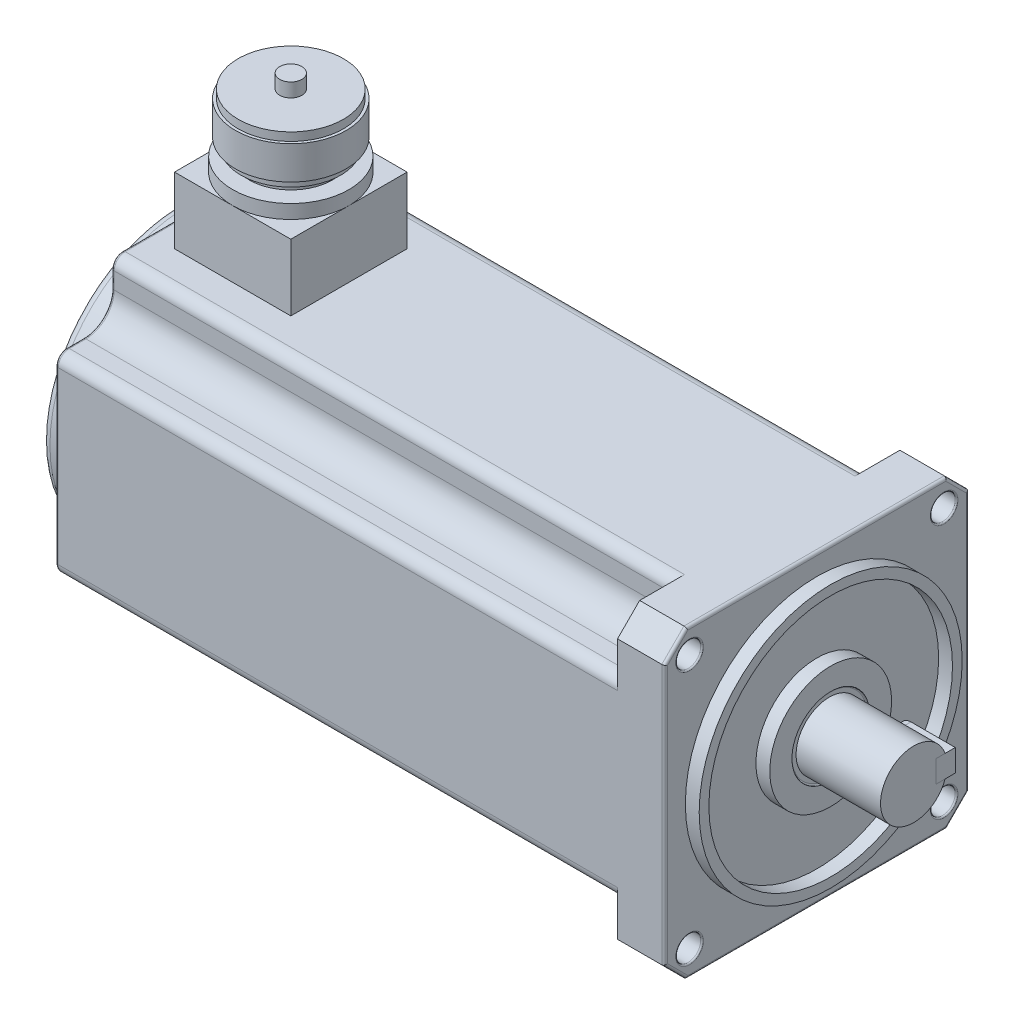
ISO-10303-21;
HEADER;
FILE_DESCRIPTION(('STEP AP214'),'2;1');
FILE_NAME('part.step','',(''),(''),'','','');
FILE_SCHEMA(('AUTOMOTIVE_DESIGN { 1 0 10303 214 1 1 1 1 }'));
ENDSEC;
DATA;
#1=APPLICATION_CONTEXT('core data for automotive mechanical design processes');
#2=APPLICATION_PROTOCOL_DEFINITION('international standard','automotive_design',2000,#1);
#3=PRODUCT_CONTEXT('',#1,'mechanical');
#4=PRODUCT('Part','Part','',(#3));
#5=PRODUCT_RELATED_PRODUCT_CATEGORY('part','',(#4));
#6=PRODUCT_DEFINITION_FORMATION('','',#4);
#7=PRODUCT_DEFINITION_CONTEXT('part definition',#1,'design');
#8=PRODUCT_DEFINITION('design','',#6,#7);
#9=PRODUCT_DEFINITION_SHAPE('','',#8);
#10=(LENGTH_UNIT() NAMED_UNIT(*) SI_UNIT(.MILLI.,.METRE.));
#11=(NAMED_UNIT(*) PLANE_ANGLE_UNIT() SI_UNIT($,.RADIAN.));
#12=(NAMED_UNIT(*) SI_UNIT($,.STERADIAN.) SOLID_ANGLE_UNIT());
#13=UNCERTAINTY_MEASURE_WITH_UNIT(LENGTH_MEASURE(1.E-05),#10,'distance_accuracy_value','');
#14=(GEOMETRIC_REPRESENTATION_CONTEXT(3) GLOBAL_UNCERTAINTY_ASSIGNED_CONTEXT((#13)) GLOBAL_UNIT_ASSIGNED_CONTEXT((#10,
#11,#12)) REPRESENTATION_CONTEXT('',''));
#15=CARTESIAN_POINT('',(0.,0.,0.));
#16=DIRECTION('',(0.,0.,1.));
#17=DIRECTION('',(1.,0.,0.));
#18=AXIS2_PLACEMENT_3D('',#15,#16,#17);
#19=CARTESIAN_POINT('',(19.,0.,-15.));
#20=DIRECTION('',(0.,0.,1.));
#21=DIRECTION('',(1.,0.,0.));
#22=AXIS2_PLACEMENT_3D('',#19,#20,#21);
#23=CYLINDRICAL_SURFACE('',#22,4.);
#24=CARTESIAN_POINT('',(19.,0.,-8.));
#25=DIRECTION('',(0.,0.,-1.));
#26=DIRECTION('',(-1.,0.,0.));
#27=AXIS2_PLACEMENT_3D('',#24,#25,#26);
#28=CIRCLE('',#27,4.);
#29=CARTESIAN_POINT('',(19.,-4.,-8.));
#30=VERTEX_POINT('',#29);
#31=CARTESIAN_POINT('',(19.,4.,-8.));
#32=VERTEX_POINT('',#31);
#33=EDGE_CURVE('E108',#30,#32,#28,.T.);
#34=ORIENTED_EDGE('',*,*,#33,.T.);
#35=DIRECTION('',(0.,0.,1.));
#36=VECTOR('',#35,1.);
#37=CARTESIAN_POINT('',(19.,4.,-15.));
#38=LINE('',#37,#36);
#39=CARTESIAN_POINT('',(19.,4.,-15.));
#40=VERTEX_POINT('',#39);
#41=EDGE_CURVE('E12',#40,#32,#38,.T.);
#42=ORIENTED_EDGE('',*,*,#41,.F.);
#43=CARTESIAN_POINT('',(19.,0.,-15.));
#44=DIRECTION('',(0.,0.,-1.));
#45=DIRECTION('',(-1.,0.,0.));
#46=AXIS2_PLACEMENT_3D('',#43,#44,#45);
#47=CIRCLE('',#46,4.);
#48=CARTESIAN_POINT('',(19.,-4.,-15.));
#49=VERTEX_POINT('',#48);
#50=EDGE_CURVE('E96',#49,#40,#47,.T.);
#51=ORIENTED_EDGE('',*,*,#50,.F.);
#52=DIRECTION('',(0.,0.,1.));
#53=VECTOR('',#52,1.);
#54=CARTESIAN_POINT('',(19.,-4.,-15.));
#55=LINE('',#54,#53);
#56=EDGE_CURVE('E104',#49,#30,#55,.T.);
#57=ORIENTED_EDGE('',*,*,#56,.T.);
#58=EDGE_LOOP('',(#34,#42,#51,#57));
#59=FACE_BOUND('',#58,.T.);
#60=ADVANCED_FACE('F45',(#59),#23,.T.);
#61=CARTESIAN_POINT('',(19.,4.,-15.));
#62=DIRECTION('',(0.,-1.,0.));
#63=DIRECTION('',(0.,0.,-1.));
#64=AXIS2_PLACEMENT_3D('',#61,#62,#63);
#65=PLANE('',#64);
#66=DIRECTION('',(1.,0.,0.));
#67=VECTOR('',#66,1.);
#68=CARTESIAN_POINT('',(19.,4.,-8.));
#69=LINE('',#68,#67);
#70=CARTESIAN_POINT('',(35.,4.,-8.));
#71=VERTEX_POINT('',#70);
#72=EDGE_CURVE('E100',#32,#71,#69,.T.);
#73=ORIENTED_EDGE('',*,*,#72,.T.);
#74=DIRECTION('',(0.,0.,1.));
#75=VECTOR('',#74,1.);
#76=CARTESIAN_POINT('',(35.,4.,-15.));
#77=LINE('',#76,#75);
#78=CARTESIAN_POINT('',(35.,4.,-15.));
#79=VERTEX_POINT('',#78);
#80=EDGE_CURVE('E53',#79,#71,#77,.T.);
#81=ORIENTED_EDGE('',*,*,#80,.F.);
#82=DIRECTION('',(1.,0.,0.));
#83=VECTOR('',#82,1.);
#84=CARTESIAN_POINT('',(19.,4.,-15.));
#85=LINE('',#84,#83);
#86=EDGE_CURVE('E91',#40,#79,#85,.T.);
#87=ORIENTED_EDGE('',*,*,#86,.F.);
#88=ORIENTED_EDGE('',*,*,#41,.T.);
#89=EDGE_LOOP('',(#73,#81,#87,#88));
#90=FACE_BOUND('',#89,.T.);
#91=ADVANCED_FACE('F99',(#90),#65,.F.);
#92=CARTESIAN_POINT('',(35.,4.,-15.));
#93=DIRECTION('',(-1.,0.,0.));
#94=DIRECTION('',(0.,0.,1.));
#95=AXIS2_PLACEMENT_3D('',#92,#93,#94);
#96=PLANE('',#95);
#97=DIRECTION('',(0.,-1.,0.));
#98=VECTOR('',#97,1.);
#99=CARTESIAN_POINT('',(35.,4.,-8.));
#100=LINE('',#99,#98);
#101=CARTESIAN_POINT('',(35.,-4.,-8.));
#102=VERTEX_POINT('',#101);
#103=EDGE_CURVE('E78',#71,#102,#100,.T.);
#104=ORIENTED_EDGE('',*,*,#103,.T.);
#105=DIRECTION('',(0.,0.,1.));
#106=VECTOR('',#105,1.);
#107=CARTESIAN_POINT('',(35.,-4.,-15.));
#108=LINE('',#107,#106);
#109=CARTESIAN_POINT('',(35.,-4.,-15.));
#110=VERTEX_POINT('',#109);
#111=EDGE_CURVE('E101',#110,#102,#108,.T.);
#112=ORIENTED_EDGE('',*,*,#111,.F.);
#113=DIRECTION('',(0.,-1.,0.));
#114=VECTOR('',#113,1.);
#115=CARTESIAN_POINT('',(35.,4.,-15.));
#116=LINE('',#115,#114);
#117=EDGE_CURVE('E94',#79,#110,#116,.T.);
#118=ORIENTED_EDGE('',*,*,#117,.F.);
#119=ORIENTED_EDGE('',*,*,#80,.T.);
#120=EDGE_LOOP('',(#104,#112,#118,#119));
#121=FACE_BOUND('',#120,.T.);
#122=ADVANCED_FACE('F102',(#121),#96,.F.);
#123=CARTESIAN_POINT('',(35.,-4.,-15.));
#124=DIRECTION('',(0.,1.,0.));
#125=DIRECTION('',(-1.,0.,0.));
#126=AXIS2_PLACEMENT_3D('',#123,#124,#125);
#127=PLANE('',#126);
#128=DIRECTION('',(-1.,0.,0.));
#129=VECTOR('',#128,1.);
#130=CARTESIAN_POINT('',(35.,-4.,-8.));
#131=LINE('',#130,#129);
#132=EDGE_CURVE('E84',#102,#30,#131,.T.);
#133=ORIENTED_EDGE('',*,*,#132,.T.);
#134=ORIENTED_EDGE('',*,*,#56,.F.);
#135=DIRECTION('',(-1.,0.,0.));
#136=VECTOR('',#135,1.);
#137=CARTESIAN_POINT('',(35.,-4.,-15.));
#138=LINE('',#137,#136);
#139=EDGE_CURVE('E61',#110,#49,#138,.T.);
#140=ORIENTED_EDGE('',*,*,#139,.F.);
#141=ORIENTED_EDGE('',*,*,#111,.T.);
#142=EDGE_LOOP('',(#133,#134,#140,#141));
#143=FACE_BOUND('',#142,.T.);
#144=ADVANCED_FACE('F115',(#143),#127,.F.);
#145=CARTESIAN_POINT('',(19.,0.,-15.));
#146=DIRECTION('',(0.,0.,-1.));
#147=DIRECTION('',(-1.,0.,0.));
#148=AXIS2_PLACEMENT_3D('',#145,#146,#147);
#149=PLANE('',#148);
#150=ORIENTED_EDGE('',*,*,#50,.T.);
#151=ORIENTED_EDGE('',*,*,#86,.T.);
#152=ORIENTED_EDGE('',*,*,#117,.T.);
#153=ORIENTED_EDGE('',*,*,#139,.T.);
#154=EDGE_LOOP('',(#150,#151,#152,#153));
#155=FACE_BOUND('',#154,.T.);
#156=ADVANCED_FACE('F92',(#155),#149,.T.);
#157=CARTESIAN_POINT('',(19.,0.,-8.));
#158=DIRECTION('',(0.,0.,-1.));
#159=DIRECTION('',(-1.,0.,0.));
#160=AXIS2_PLACEMENT_3D('',#157,#158,#159);
#161=PLANE('',#160);
#162=ORIENTED_EDGE('',*,*,#33,.F.);
#163=ORIENTED_EDGE('',*,*,#132,.F.);
#164=ORIENTED_EDGE('',*,*,#103,.F.);
#165=ORIENTED_EDGE('',*,*,#72,.F.);
#166=EDGE_LOOP('',(#162,#163,#164,#165));
#167=FACE_BOUND('',#166,.T.);
#168=ADVANCED_FACE('F118',(#167),#161,.F.);
#169=CLOSED_SHELL('',(#60,#91,#122,#144,#156,#168));
#170=MANIFOLD_SOLID_BREP('B2',#169);
#171=CARTESIAN_POINT('',(-190.,105.,0.));
#172=DIRECTION('',(0.,1.,0.));
#173=DIRECTION('',(0.,0.,1.));
#174=AXIS2_PLACEMENT_3D('',#171,#172,#173);
#175=PLANE('',#174);
#176=CARTESIAN_POINT('',(-190.,105.,0.));
#177=DIRECTION('',(0.,1.,0.));
#178=DIRECTION('',(0.,0.,1.));
#179=AXIS2_PLACEMENT_3D('',#176,#177,#178);
#180=CIRCLE('',#179,19.);
#181=CARTESIAN_POINT('',(-190.,105.,19.));
#182=VERTEX_POINT('',#181);
#183=EDGE_CURVE('E1747',#182,#182,#180,.T.);
#184=ORIENTED_EDGE('',*,*,#183,.T.);
#185=EDGE_LOOP('',(#184));
#186=FACE_BOUND('',#185,.T.);
#187=CARTESIAN_POINT('',(-190.,105.,0.));
#188=DIRECTION('',(0.,1.,0.));
#189=DIRECTION('',(0.,0.,1.));
#190=AXIS2_PLACEMENT_3D('',#187,#188,#189);
#191=CIRCLE('',#190,3.99999999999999);
#192=CARTESIAN_POINT('',(-190.,105.,3.99999999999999));
#193=VERTEX_POINT('',#192);
#194=EDGE_CURVE('E1744',#193,#193,#191,.T.);
#195=ORIENTED_EDGE('',*,*,#194,.F.);
#196=EDGE_LOOP('',(#195));
#197=FACE_BOUND('',#196,.T.);
#198=ADVANCED_FACE('F169',(#186,#197),#175,.T.);
#199=CARTESIAN_POINT('',(-190.,102.,0.));
#200=DIRECTION('',(0.,1.,0.));
#201=DIRECTION('',(0.,0.,1.));
#202=AXIS2_PLACEMENT_3D('',#199,#200,#201);
#203=PLANE('',#202);
#204=CARTESIAN_POINT('',(-190.,102.,0.));
#205=DIRECTION('',(0.,1.,0.));
#206=DIRECTION('',(0.,0.,1.));
#207=AXIS2_PLACEMENT_3D('',#204,#205,#206);
#208=CIRCLE('',#207,20.);
#209=CARTESIAN_POINT('',(-190.,102.,20.));
#210=VERTEX_POINT('',#209);
#211=EDGE_CURVE('E1754',#210,#210,#208,.T.);
#212=ORIENTED_EDGE('',*,*,#211,.T.);
#213=EDGE_LOOP('',(#212));
#214=FACE_BOUND('',#213,.T.);
#215=CARTESIAN_POINT('',(-190.,102.,0.));
#216=DIRECTION('',(0.,1.,0.));
#217=DIRECTION('',(0.,0.,1.));
#218=AXIS2_PLACEMENT_3D('',#215,#216,#217);
#219=CIRCLE('',#218,19.);
#220=CARTESIAN_POINT('',(-190.,102.,19.));
#221=VERTEX_POINT('',#220);
#222=EDGE_CURVE('E1743',#221,#221,#219,.T.);
#223=ORIENTED_EDGE('',*,*,#222,.F.);
#224=EDGE_LOOP('',(#223));
#225=FACE_BOUND('',#224,.T.);
#226=ADVANCED_FACE('F1118',(#214,#225),#203,.T.);
#227=CARTESIAN_POINT('',(-190.,84.,0.));
#228=DIRECTION('',(0.,1.,0.));
#229=DIRECTION('',(0.,0.,1.));
#230=AXIS2_PLACEMENT_3D('',#227,#228,#229);
#231=PLANE('',#230);
#232=CARTESIAN_POINT('',(-190.,84.,0.));
#233=DIRECTION('',(0.,1.,0.));
#234=DIRECTION('',(0.,0.,1.));
#235=AXIS2_PLACEMENT_3D('',#232,#233,#234);
#236=CIRCLE('',#235,21.);
#237=CARTESIAN_POINT('',(-190.,84.,21.));
#238=VERTEX_POINT('',#237);
#239=EDGE_CURVE('E561',#238,#238,#236,.T.);
#240=ORIENTED_EDGE('',*,*,#239,.T.);
#241=EDGE_LOOP('',(#240));
#242=FACE_BOUND('',#241,.T.);
#243=CARTESIAN_POINT('',(-190.,84.,0.));
#244=DIRECTION('',(0.,1.,0.));
#245=DIRECTION('',(0.,0.,1.));
#246=AXIS2_PLACEMENT_3D('',#243,#244,#245);
#247=CIRCLE('',#246,15.);
#248=CARTESIAN_POINT('',(-190.,84.,15.));
#249=VERTEX_POINT('',#248);
#250=EDGE_CURVE('E1763',#249,#249,#247,.T.);
#251=ORIENTED_EDGE('',*,*,#250,.F.);
#252=EDGE_LOOP('',(#251));
#253=FACE_BOUND('',#252,.T.);
#254=ADVANCED_FACE('F1124',(#242,#253),#231,.T.);
#255=CARTESIAN_POINT('',(0.,79.,0.));
#256=DIRECTION('',(0.,-1.,0.));
#257=DIRECTION('',(0.,0.,-1.));
#258=AXIS2_PLACEMENT_3D('',#255,#256,#257);
#259=PLANE('',#258);
#260=CARTESIAN_POINT('',(-190.,79.,0.));
#261=DIRECTION('',(0.,1.,0.));
#262=DIRECTION('',(0.,0.,1.));
#263=AXIS2_PLACEMENT_3D('',#260,#261,#262);
#264=CIRCLE('',#263,21.);
#265=CARTESIAN_POINT('',(-190.,79.,21.));
#266=VERTEX_POINT('',#265);
#267=CARTESIAN_POINT('',(-169.,79.,0.));
#268=VERTEX_POINT('',#267);
#269=EDGE_CURVE('E185',#266,#268,#264,.T.);
#270=ORIENTED_EDGE('',*,*,#269,.F.);
#271=DIRECTION('',(1.,0.,0.));
#272=VECTOR('',#271,1.);
#273=CARTESIAN_POINT('',(-211.,79.,21.));
#274=LINE('',#273,#272);
#275=CARTESIAN_POINT('',(-169.,79.,21.));
#276=VERTEX_POINT('',#275);
#277=EDGE_CURVE('E547',#266,#276,#274,.T.);
#278=ORIENTED_EDGE('',*,*,#277,.T.);
#279=DIRECTION('',(0.,0.,-1.));
#280=VECTOR('',#279,1.);
#281=CARTESIAN_POINT('',(-169.,79.,21.));
#282=LINE('',#281,#280);
#283=EDGE_CURVE('E559',#276,#268,#282,.T.);
#284=ORIENTED_EDGE('',*,*,#283,.T.);
#285=EDGE_LOOP('',(#270,#278,#284));
#286=FACE_BOUND('',#285,.T.);
#287=ADVANCED_FACE('F558',(#286),#259,.F.);
#288=CARTESIAN_POINT('',(-190.,79.,-21.));
#289=VERTEX_POINT('',#288);
#290=EDGE_CURVE('E43',#268,#289,#264,.T.);
#291=ORIENTED_EDGE('',*,*,#290,.F.);
#292=CARTESIAN_POINT('',(-169.,79.,-21.));
#293=VERTEX_POINT('',#292);
#294=EDGE_CURVE('E570',#268,#293,#282,.T.);
#295=ORIENTED_EDGE('',*,*,#294,.T.);
#296=DIRECTION('',(-1.,0.,0.));
#297=VECTOR('',#296,1.);
#298=CARTESIAN_POINT('',(-211.,79.,-21.));
#299=LINE('',#298,#297);
#300=EDGE_CURVE('E571',#293,#289,#299,.T.);
#301=ORIENTED_EDGE('',*,*,#300,.T.);
#302=EDGE_LOOP('',(#291,#295,#301));
#303=FACE_BOUND('',#302,.T.);
#304=ADVANCED_FACE('F1165',(#303),#259,.F.);
#305=CARTESIAN_POINT('',(-211.,79.,0.));
#306=VERTEX_POINT('',#305);
#307=EDGE_CURVE('E183',#289,#306,#264,.T.);
#308=ORIENTED_EDGE('',*,*,#307,.F.);
#309=CARTESIAN_POINT('',(-211.,79.,-21.));
#310=VERTEX_POINT('',#309);
#311=EDGE_CURVE('E569',#289,#310,#299,.T.);
#312=ORIENTED_EDGE('',*,*,#311,.T.);
#313=DIRECTION('',(0.,0.,1.));
#314=VECTOR('',#313,1.);
#315=CARTESIAN_POINT('',(-211.,79.,21.));
#316=LINE('',#315,#314);
#317=EDGE_CURVE('E556',#310,#306,#316,.T.);
#318=ORIENTED_EDGE('',*,*,#317,.T.);
#319=EDGE_LOOP('',(#308,#312,#318));
#320=FACE_BOUND('',#319,.T.);
#321=ADVANCED_FACE('F1626',(#320),#259,.F.);
#322=EDGE_CURVE('E192',#306,#266,#264,.T.);
#323=ORIENTED_EDGE('',*,*,#322,.F.);
#324=CARTESIAN_POINT('',(-211.,79.,21.));
#325=VERTEX_POINT('',#324);
#326=EDGE_CURVE('E543',#306,#325,#316,.T.);
#327=ORIENTED_EDGE('',*,*,#326,.T.);
#328=EDGE_CURVE('E540',#325,#266,#274,.T.);
#329=ORIENTED_EDGE('',*,*,#328,.T.);
#330=EDGE_LOOP('',(#323,#327,#329));
#331=FACE_BOUND('',#330,.T.);
#332=ADVANCED_FACE('F542',(#331),#259,.F.);
#333=CARTESIAN_POINT('',(-220.,55.,47.));
#334=DIRECTION('',(0.,1.,0.));
#335=DIRECTION('',(0.,0.,1.));
#336=AXIS2_PLACEMENT_3D('',#333,#334,#335);
#337=PLANE('',#336);
#338=DIRECTION('',(1.,0.,0.));
#339=VECTOR('',#338,1.);
#340=CARTESIAN_POINT('',(-220.,55.,47.));
#341=LINE('',#340,#339);
#342=CARTESIAN_POINT('',(-17.,55.,47.));
#343=VERTEX_POINT('',#342);
#344=CARTESIAN_POINT('',(-1.,55.,47.));
#345=VERTEX_POINT('',#344);
#346=EDGE_CURVE('E803',#343,#345,#341,.T.);
#347=ORIENTED_EDGE('',*,*,#346,.T.);
#348=DIRECTION('',(0.,0.,1.));
#349=VECTOR('',#348,1.);
#350=CARTESIAN_POINT('',(-1.,55.,47.));
#351=LINE('',#350,#349);
#352=CARTESIAN_POINT('',(-1.,55.,-47.));
#353=VERTEX_POINT('',#352);
#354=EDGE_CURVE('E1041',#345,#353,#351,.F.);
#355=ORIENTED_EDGE('',*,*,#354,.T.);
#356=DIRECTION('',(1.,0.,0.));
#357=VECTOR('',#356,1.);
#358=CARTESIAN_POINT('',(-220.,55.,-47.));
#359=LINE('',#358,#357);
#360=CARTESIAN_POINT('',(-17.,55.,-47.));
#361=VERTEX_POINT('',#360);
#362=EDGE_CURVE('E818',#361,#353,#359,.T.);
#363=ORIENTED_EDGE('',*,*,#362,.F.);
#364=DIRECTION('',(0.,0.,-1.));
#365=VECTOR('',#364,1.);
#366=CARTESIAN_POINT('',(-17.,55.,-30.8019609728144));
#367=LINE('',#366,#365);
#368=CARTESIAN_POINT('',(-17.,55.,-30.8019609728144));
#369=VERTEX_POINT('',#368);
#370=EDGE_CURVE('E786',#369,#361,#367,.T.);
#371=ORIENTED_EDGE('',*,*,#370,.F.);
#372=DIRECTION('',(-1.,0.,0.));
#373=VECTOR('',#372,1.);
#374=CARTESIAN_POINT('',(-17.,55.,-30.8019609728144));
#375=LINE('',#374,#373);
#376=CARTESIAN_POINT('',(-219.,55.,-30.8019609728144));
#377=VERTEX_POINT('',#376);
#378=EDGE_CURVE('E810',#369,#377,#375,.T.);
#379=ORIENTED_EDGE('',*,*,#378,.T.);
#380=DIRECTION('',(0.,0.,1.));
#381=VECTOR('',#380,1.);
#382=CARTESIAN_POINT('',(-219.,55.,30.8019609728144));
#383=LINE('',#382,#381);
#384=CARTESIAN_POINT('',(-219.,55.,30.8019609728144));
#385=VERTEX_POINT('',#384);
#386=EDGE_CURVE('E933',#377,#385,#383,.T.);
#387=ORIENTED_EDGE('',*,*,#386,.T.);
#388=DIRECTION('',(-1.,0.,0.));
#389=VECTOR('',#388,1.);
#390=CARTESIAN_POINT('',(-17.,55.,30.8019609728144));
#391=LINE('',#390,#389);
#392=CARTESIAN_POINT('',(-17.,55.,30.8019609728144));
#393=VERTEX_POINT('',#392);
#394=EDGE_CURVE('E687',#393,#385,#391,.T.);
#395=ORIENTED_EDGE('',*,*,#394,.F.);
#396=DIRECTION('',(0.,0.,-1.));
#397=VECTOR('',#396,1.);
#398=CARTESIAN_POINT('',(-17.,55.,47.));
#399=LINE('',#398,#397);
#400=EDGE_CURVE('E670',#343,#393,#399,.T.);
#401=ORIENTED_EDGE('',*,*,#400,.F.);
#402=EDGE_LOOP('',(#347,#355,#363,#371,#379,#387,#395,#401));
#403=FACE_BOUND('',#402,.T.);
#404=DIRECTION('',(-1.,0.,0.));
#405=VECTOR('',#404,1.);
#406=CARTESIAN_POINT('',(-211.,55.,-21.));
#407=LINE('',#406,#405);
#408=CARTESIAN_POINT('',(-169.,55.,-21.));
#409=VERTEX_POINT('',#408);
#410=CARTESIAN_POINT('',(-211.,55.,-21.));
#411=VERTEX_POINT('',#410);
#412=EDGE_CURVE('E578',#409,#411,#407,.T.);
#413=ORIENTED_EDGE('',*,*,#412,.F.);
#414=DIRECTION('',(0.,0.,-1.));
#415=VECTOR('',#414,1.);
#416=CARTESIAN_POINT('',(-169.,55.,21.));
#417=LINE('',#416,#415);
#418=CARTESIAN_POINT('',(-169.,55.,21.));
#419=VERTEX_POINT('',#418);
#420=EDGE_CURVE('E575',#419,#409,#417,.T.);
#421=ORIENTED_EDGE('',*,*,#420,.F.);
#422=DIRECTION('',(1.,0.,0.));
#423=VECTOR('',#422,1.);
#424=CARTESIAN_POINT('',(-211.,55.,21.));
#425=LINE('',#424,#423);
#426=CARTESIAN_POINT('',(-211.,55.,21.));
#427=VERTEX_POINT('',#426);
#428=EDGE_CURVE('E583',#427,#419,#425,.T.);
#429=ORIENTED_EDGE('',*,*,#428,.F.);
#430=DIRECTION('',(0.,0.,1.));
#431=VECTOR('',#430,1.);
#432=CARTESIAN_POINT('',(-211.,55.,21.));
#433=LINE('',#432,#431);
#434=EDGE_CURVE('E580',#411,#427,#433,.T.);
#435=ORIENTED_EDGE('',*,*,#434,.F.);
#436=EDGE_LOOP('',(#413,#421,#429,#435));
#437=FACE_BOUND('',#436,.T.);
#438=ADVANCED_FACE('F1199',(#403,#437),#337,.T.);
#439=CARTESIAN_POINT('',(35.,0.,0.));
#440=DIRECTION('',(-1.,0.,0.));
#441=DIRECTION('',(0.,0.,1.));
#442=AXIS2_PLACEMENT_3D('',#439,#440,#441);
#443=CYLINDRICAL_SURFACE('',#442,12.);
#444=CARTESIAN_POINT('',(4.5,0.,0.));
#445=DIRECTION('',(1.,0.,0.));
#446=DIRECTION('',(0.,0.,-1.));
#447=AXIS2_PLACEMENT_3D('',#444,#445,#446);
#448=CIRCLE('',#447,12.);
#449=CARTESIAN_POINT('',(4.5,0.,-12.));
#450=VERTEX_POINT('',#449);
#451=EDGE_CURVE('E619',#450,#450,#448,.T.);
#452=ORIENTED_EDGE('',*,*,#451,.T.);
#453=EDGE_LOOP('',(#452));
#454=FACE_BOUND('',#453,.T.);
#455=CARTESIAN_POINT('',(19.,-4.,-11.3137084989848));
#456=CARTESIAN_POINT('',(18.8908686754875,-4.0000143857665,-11.3136910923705));
#457=CARTESIAN_POINT('',(18.7817470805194,-3.99553419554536,-11.3152871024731));
#458=CARTESIAN_POINT('',(18.5643503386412,-3.97769673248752,-11.3215763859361));
#459=CARTESIAN_POINT('',(18.4560749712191,-3.96434185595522,-11.3262688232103));
#460=CARTESIAN_POINT('',(18.2414552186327,-3.92891935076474,-11.3386032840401));
#461=CARTESIAN_POINT('',(18.1351060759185,-3.90687756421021,-11.3462365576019));
#462=CARTESIAN_POINT('',(17.9247867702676,-3.85430689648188,-11.364201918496));
#463=CARTESIAN_POINT('',(17.8208166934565,-3.82377770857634,-11.3745341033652));
#464=CARTESIAN_POINT('',(17.5136614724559,-3.71986482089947,-11.4091190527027));
#465=CARTESIAN_POINT('',(17.314913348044,-3.63410266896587,-11.4369799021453));
#466=CARTESIAN_POINT('',(16.9345971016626,-3.4322845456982,-11.4991525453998));
#467=CARTESIAN_POINT('',(16.753039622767,-3.31620997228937,-11.5334682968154));
#468=CARTESIAN_POINT('',(16.4051313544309,-3.05220793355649,-11.6061789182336));
#469=CARTESIAN_POINT('',(16.2395437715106,-2.90330055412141,-11.6446750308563));
#470=CARTESIAN_POINT('',(15.9351726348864,-2.57995313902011,-11.7205540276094));
#471=CARTESIAN_POINT('',(15.796393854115,-2.40550856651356,-11.7579367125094));
#472=CARTESIAN_POINT('',(15.5460828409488,-2.03041476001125,-11.8285552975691));
#473=CARTESIAN_POINT('',(15.4353563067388,-1.82920040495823,-11.8616574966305));
#474=CARTESIAN_POINT('',(15.2496307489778,-1.40971695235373,-11.9187843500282));
#475=CARTESIAN_POINT('',(15.1746208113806,-1.19145308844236,-11.9428117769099));
#476=CARTESIAN_POINT('',(15.0650571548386,-0.752117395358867,-11.9783628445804));
#477=CARTESIAN_POINT('',(15.0291869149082,-0.531407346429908,-11.9902923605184));
#478=CARTESIAN_POINT('',(14.9947348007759,-0.086795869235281,-12.0017443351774));
#479=CARTESIAN_POINT('',(14.9961440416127,0.137104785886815,-12.0012697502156));
#480=CARTESIAN_POINT('',(15.0353770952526,0.572415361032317,-11.9882415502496));
#481=CARTESIAN_POINT('',(15.0717704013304,0.783970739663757,-11.9761624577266));
#482=CARTESIAN_POINT('',(15.1775729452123,1.19777632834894,-11.9418784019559));
#483=CARTESIAN_POINT('',(15.2469840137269,1.4000260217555,-11.9196728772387));
#484=CARTESIAN_POINT('',(15.4176849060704,1.79261022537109,-11.8670267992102));
#485=CARTESIAN_POINT('',(15.5193820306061,1.98275302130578,-11.8364817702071));
#486=CARTESIAN_POINT('',(15.7514419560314,2.34369935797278,-11.7703352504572));
#487=CARTESIAN_POINT('',(15.8818125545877,2.51449761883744,-11.7347323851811));
#488=CARTESIAN_POINT('',(16.1746757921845,2.84038544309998,-11.6602518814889));
#489=CARTESIAN_POINT('',(16.3383901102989,2.99435951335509,-11.6212989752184));
#490=CARTESIAN_POINT('',(16.6897980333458,3.27310303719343,-11.5458957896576));
#491=CARTESIAN_POINT('',(16.8774993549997,3.39786305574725,-11.5094463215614));
#492=CARTESIAN_POINT('',(17.1747129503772,3.56109757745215,-11.4595759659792));
#493=CARTESIAN_POINT('',(17.2772554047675,3.61182358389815,-11.4436484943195));
#494=CARTESIAN_POINT('',(17.4865649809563,3.70440095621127,-11.4140167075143));
#495=CARTESIAN_POINT('',(17.5933303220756,3.74625601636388,-11.4003114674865));
#496=CARTESIAN_POINT('',(17.8102170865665,3.82067426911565,-11.3755873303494));
#497=CARTESIAN_POINT('',(17.9203347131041,3.85324757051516,-11.3645655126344));
#498=CARTESIAN_POINT('',(18.1431681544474,3.90883841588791,-11.3455648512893));
#499=CARTESIAN_POINT('',(18.2558827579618,3.93186032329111,-11.3375846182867));
#500=CARTESIAN_POINT('',(18.4736424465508,3.96661962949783,-11.3254693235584));
#501=CARTESIAN_POINT('',(18.5785495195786,3.97913375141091,-11.3210705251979));
#502=CARTESIAN_POINT('',(18.7889683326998,3.99582494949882,-11.3151843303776));
#503=CARTESIAN_POINT('',(18.8944791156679,4.00001278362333,-11.3136931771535));
#504=CARTESIAN_POINT('',(19.,4.,-11.3137084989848));
#505=B_SPLINE_CURVE_WITH_KNOTS('',3,(#455,#456,#457,#458,#459,#460,#461,#462,#463,#464,#465,
#466,#467,#468,#469,#470,#471,#472,#473,#474,#475,#476,#477,#478,#479,#480,#481,#482,#483,#484,
#485,#486,#487,#488,#489,#490,#491,#492,#493,#494,#495,#496,#497,#498,#499,#500,#501,#502,#503,
#504),.UNSPECIFIED.,.F.,.F.,(4,2,2,2,2,2,2,2,2,2,2,2,2,2,2,2,2,2,2,2,2,2,2,2,4),(0.,
0.327273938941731,0.654459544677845,0.980679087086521,1.30691042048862,1.95841627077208,
2.61032287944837,3.28524582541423,3.96028882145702,4.65295094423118,5.34540127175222,
6.01376445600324,6.68196834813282,7.32396236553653,7.96599198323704,8.61646637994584,
9.26711789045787,9.94834778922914,10.6297973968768,10.9759539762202,11.3219661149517,
11.6675999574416,12.0130757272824,12.3299368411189,12.6463882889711),.UNSPECIFIED.);
#506=CARTESIAN_POINT('',(19.,-4.,-11.3137084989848));
#507=VERTEX_POINT('',#506);
#508=CARTESIAN_POINT('',(19.,4.,-11.3137084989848));
#509=VERTEX_POINT('',#508);
#510=EDGE_CURVE('E173',#507,#509,#505,.T.);
#511=ORIENTED_EDGE('',*,*,#510,.F.);
#512=DIRECTION('',(-1.,0.,0.));
#513=VECTOR('',#512,1.);
#514=CARTESIAN_POINT('',(35.,-4.,-11.3137084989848));
#515=LINE('',#514,#513);
#516=CARTESIAN_POINT('',(35.,-4.,-11.3137084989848));
#517=VERTEX_POINT('',#516);
#518=EDGE_CURVE('E616',#517,#507,#515,.T.);
#519=ORIENTED_EDGE('',*,*,#518,.F.);
#520=CARTESIAN_POINT('',(35.,0.,0.));
#521=DIRECTION('',(1.,0.,0.));
#522=DIRECTION('',(0.,0.,-1.));
#523=AXIS2_PLACEMENT_3D('',#520,#521,#522);
#524=CIRCLE('',#523,12.);
#525=CARTESIAN_POINT('',(35.,3.99999999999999,-11.3137084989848));
#526=VERTEX_POINT('',#525);
#527=EDGE_CURVE('E620',#526,#517,#524,.T.);
#528=ORIENTED_EDGE('',*,*,#527,.F.);
#529=DIRECTION('',(-1.,0.,0.));
#530=VECTOR('',#529,1.);
#531=CARTESIAN_POINT('',(35.,3.99999999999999,-11.3137084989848));
#532=LINE('',#531,#530);
#533=EDGE_CURVE('E614',#509,#526,#532,.F.);
#534=ORIENTED_EDGE('',*,*,#533,.F.);
#535=EDGE_LOOP('',(#511,#519,#528,#534));
#536=FACE_BOUND('',#535,.T.);
#537=ADVANCED_FACE('F1194',(#454,#536),#443,.T.);
#538=CARTESIAN_POINT('',(35.,0.,0.));
#539=DIRECTION('',(1.,0.,0.));
#540=DIRECTION('',(0.,0.,-1.));
#541=AXIS2_PLACEMENT_3D('',#538,#539,#540);
#542=PLANE('',#541);
#543=ORIENTED_EDGE('',*,*,#527,.T.);
#544=DIRECTION('',(0.,0.,-1.));
#545=VECTOR('',#544,1.);
#546=CARTESIAN_POINT('',(35.,-4.,-8.));
#547=LINE('',#546,#545);
#548=CARTESIAN_POINT('',(35.,-4.,-8.));
#549=VERTEX_POINT('',#548);
#550=EDGE_CURVE('E609',#549,#517,#547,.T.);
#551=ORIENTED_EDGE('',*,*,#550,.F.);
#552=DIRECTION('',(0.,1.,0.));
#553=VECTOR('',#552,1.);
#554=CARTESIAN_POINT('',(35.,3.99999999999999,-8.));
#555=LINE('',#554,#553);
#556=CARTESIAN_POINT('',(35.,4.,-8.));
#557=VERTEX_POINT('',#556);
#558=EDGE_CURVE('E598',#549,#557,#555,.T.);
#559=ORIENTED_EDGE('',*,*,#558,.T.);
#560=DIRECTION('',(0.,0.,-1.));
#561=VECTOR('',#560,1.);
#562=CARTESIAN_POINT('',(35.,3.99999999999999,-8.));
#563=LINE('',#562,#561);
#564=EDGE_CURVE('E606',#557,#526,#563,.T.);
#565=ORIENTED_EDGE('',*,*,#564,.T.);
#566=EDGE_LOOP('',(#543,#551,#559,#565));
#567=FACE_BOUND('',#566,.T.);
#568=ADVANCED_FACE('F1192',(#567),#542,.T.);
#569=CARTESIAN_POINT('',(4.5,0.,0.));
#570=DIRECTION('',(1.,0.,0.));
#571=DIRECTION('',(0.,0.,-1.));
#572=AXIS2_PLACEMENT_3D('',#569,#570,#571);
#573=PLANE('',#572);
#574=CARTESIAN_POINT('',(4.5,0.,0.));
#575=DIRECTION('',(1.,0.,0.));
#576=DIRECTION('',(0.,0.,-1.));
#577=AXIS2_PLACEMENT_3D('',#574,#575,#576);
#578=CIRCLE('',#577,13.5);
#579=CARTESIAN_POINT('',(4.5,0.,-13.5));
#580=VERTEX_POINT('',#579);
#581=EDGE_CURVE('E564',#580,#580,#578,.T.);
#582=ORIENTED_EDGE('',*,*,#581,.T.);
#583=EDGE_LOOP('',(#582));
#584=FACE_BOUND('',#583,.T.);
#585=ORIENTED_EDGE('',*,*,#451,.F.);
#586=EDGE_LOOP('',(#585));
#587=FACE_BOUND('',#586,.T.);
#588=ADVANCED_FACE('F1101',(#584,#587),#573,.T.);
#589=CARTESIAN_POINT('',(0.,0.,0.));
#590=DIRECTION('',(1.,0.,0.));
#591=DIRECTION('',(0.,0.,-1.));
#592=AXIS2_PLACEMENT_3D('',#589,#590,#591);
#593=PLANE('',#592);
#594=CARTESIAN_POINT('',(0.,0.,0.));
#595=DIRECTION('',(1.,0.,0.));
#596=DIRECTION('',(0.,0.,-1.));
#597=AXIS2_PLACEMENT_3D('',#594,#595,#596);
#598=CIRCLE('',#597,44.);
#599=CARTESIAN_POINT('',(0.,0.,-44.));
#600=VERTEX_POINT('',#599);
#601=EDGE_CURVE('E1096',#600,#600,#598,.F.);
#602=ORIENTED_EDGE('',*,*,#601,.F.);
#603=EDGE_LOOP('',(#602));
#604=FACE_BOUND('',#603,.T.);
#605=CARTESIAN_POINT('',(0.,0.,0.));
#606=DIRECTION('',(1.,0.,0.));
#607=DIRECTION('',(0.,0.,-1.));
#608=AXIS2_PLACEMENT_3D('',#605,#606,#607);
#609=CIRCLE('',#608,22.);
#610=CARTESIAN_POINT('',(0.,0.,-22.));
#611=VERTEX_POINT('',#610);
#612=EDGE_CURVE('E628',#611,#611,#609,.T.);
#613=ORIENTED_EDGE('',*,*,#612,.F.);
#614=EDGE_LOOP('',(#613));
#615=FACE_BOUND('',#614,.T.);
#616=ADVANCED_FACE('F1202',(#604,#615),#593,.T.);
#617=CARTESIAN_POINT('',(0.,-45.9619407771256,45.9619407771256));
#618=DIRECTION('',(1.,0.,0.));
#619=DIRECTION('',(0.,0.,-1.));
#620=AXIS2_PLACEMENT_3D('',#617,#618,#619);
#621=CIRCLE('',#620,5.);
#622=CARTESIAN_POINT('',(0.,-45.9619407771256,40.9619407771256));
#623=VERTEX_POINT('',#622);
#624=EDGE_CURVE('E1075',#623,#623,#621,.F.);
#625=ORIENTED_EDGE('',*,*,#624,.T.);
#626=EDGE_LOOP('',(#625));
#627=FACE_BOUND('',#626,.T.);
#628=CARTESIAN_POINT('',(0.,-45.9619407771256,-45.9619407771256));
#629=DIRECTION('',(1.,0.,0.));
#630=DIRECTION('',(0.,0.,-1.));
#631=AXIS2_PLACEMENT_3D('',#628,#629,#630);
#632=CIRCLE('',#631,5.);
#633=CARTESIAN_POINT('',(0.,-45.9619407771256,-50.9619407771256));
#634=VERTEX_POINT('',#633);
#635=EDGE_CURVE('E1072',#634,#634,#632,.F.);
#636=ORIENTED_EDGE('',*,*,#635,.T.);
#637=EDGE_LOOP('',(#636));
#638=FACE_BOUND('',#637,.T.);
#639=CARTESIAN_POINT('',(0.,45.9619407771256,-45.9619407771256));
#640=DIRECTION('',(1.,0.,0.));
#641=DIRECTION('',(0.,0.,-1.));
#642=AXIS2_PLACEMENT_3D('',#639,#640,#641);
#643=CIRCLE('',#642,5.);
#644=CARTESIAN_POINT('',(0.,45.9619407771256,-50.9619407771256));
#645=VERTEX_POINT('',#644);
#646=EDGE_CURVE('E1069',#645,#645,#643,.F.);
#647=ORIENTED_EDGE('',*,*,#646,.T.);
#648=EDGE_LOOP('',(#647));
#649=FACE_BOUND('',#648,.T.);
#650=CARTESIAN_POINT('',(0.,45.9619407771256,45.9619407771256));
#651=DIRECTION('',(1.,0.,0.));
#652=DIRECTION('',(0.,0.,-1.));
#653=AXIS2_PLACEMENT_3D('',#650,#651,#652);
#654=CIRCLE('',#653,5.);
#655=CARTESIAN_POINT('',(0.,45.9619407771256,40.9619407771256));
#656=VERTEX_POINT('',#655);
#657=EDGE_CURVE('E1066',#656,#656,#654,.F.);
#658=ORIENTED_EDGE('',*,*,#657,.T.);
#659=EDGE_LOOP('',(#658));
#660=FACE_BOUND('',#659,.T.);
#661=DIRECTION('',(0.,0.707106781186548,-0.707106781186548));
#662=VECTOR('',#661,1.);
#663=CARTESIAN_POINT('',(0.,-50.2928932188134,-50.2928932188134));
#664=LINE('',#663,#662);
#665=CARTESIAN_POINT('',(0.,-54.,-46.5857864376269));
#666=VERTEX_POINT('',#665);
#667=CARTESIAN_POINT('',(0.,-46.5857864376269,-54.));
#668=VERTEX_POINT('',#667);
#669=EDGE_CURVE('E1019',#666,#668,#664,.T.);
#670=ORIENTED_EDGE('',*,*,#669,.T.);
#671=DIRECTION('',(0.,1.,0.));
#672=VECTOR('',#671,1.);
#673=CARTESIAN_POINT('',(0.,0.,-54.));
#674=LINE('',#673,#672);
#675=CARTESIAN_POINT('',(0.,46.5857864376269,-54.));
#676=VERTEX_POINT('',#675);
#677=EDGE_CURVE('E1024',#668,#676,#674,.T.);
#678=ORIENTED_EDGE('',*,*,#677,.T.);
#679=DIRECTION('',(0.,0.707106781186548,0.707106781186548));
#680=VECTOR('',#679,1.);
#681=CARTESIAN_POINT('',(0.,50.2928932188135,-50.2928932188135));
#682=LINE('',#681,#680);
#683=CARTESIAN_POINT('',(0.,54.,-46.5857864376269));
#684=VERTEX_POINT('',#683);
#685=EDGE_CURVE('E1021',#676,#684,#682,.T.);
#686=ORIENTED_EDGE('',*,*,#685,.T.);
#687=DIRECTION('',(0.,0.,1.));
#688=VECTOR('',#687,1.);
#689=CARTESIAN_POINT('',(0.,54.,0.));
#690=LINE('',#689,#688);
#691=CARTESIAN_POINT('',(0.,54.,46.5857864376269));
#692=VERTEX_POINT('',#691);
#693=EDGE_CURVE('E939',#684,#692,#690,.T.);
#694=ORIENTED_EDGE('',*,*,#693,.T.);
#695=DIRECTION('',(0.,-0.707106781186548,0.707106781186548));
#696=VECTOR('',#695,1.);
#697=CARTESIAN_POINT('',(0.,50.2928932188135,50.2928932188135));
#698=LINE('',#697,#696);
#699=CARTESIAN_POINT('',(0.,46.5857864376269,54.));
#700=VERTEX_POINT('',#699);
#701=EDGE_CURVE('E1011',#692,#700,#698,.T.);
#702=ORIENTED_EDGE('',*,*,#701,.T.);
#703=DIRECTION('',(0.,-1.,0.));
#704=VECTOR('',#703,1.);
#705=CARTESIAN_POINT('',(0.,0.,54.));
#706=LINE('',#705,#704);
#707=CARTESIAN_POINT('',(0.,-46.5857864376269,54.));
#708=VERTEX_POINT('',#707);
#709=EDGE_CURVE('E1013',#700,#708,#706,.T.);
#710=ORIENTED_EDGE('',*,*,#709,.T.);
#711=DIRECTION('',(0.,-0.707106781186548,-0.707106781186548));
#712=VECTOR('',#711,1.);
#713=CARTESIAN_POINT('',(0.,-50.2928932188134,50.2928932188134));
#714=LINE('',#713,#712);
#715=CARTESIAN_POINT('',(0.,-54.,46.5857864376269));
#716=VERTEX_POINT('',#715);
#717=EDGE_CURVE('E1015',#708,#716,#714,.T.);
#718=ORIENTED_EDGE('',*,*,#717,.T.);
#719=DIRECTION('',(0.,0.,-1.));
#720=VECTOR('',#719,1.);
#721=CARTESIAN_POINT('',(0.,-54.,0.));
#722=LINE('',#721,#720);
#723=EDGE_CURVE('E1017',#716,#666,#722,.T.);
#724=ORIENTED_EDGE('',*,*,#723,.T.);
#725=EDGE_LOOP('',(#670,#678,#686,#694,#702,#710,#718,#724));
#726=FACE_BOUND('',#725,.T.);
#727=CARTESIAN_POINT('',(0.,0.,0.));
#728=DIRECTION('',(1.,0.,0.));
#729=DIRECTION('',(0.,0.,-1.));
#730=AXIS2_PLACEMENT_3D('',#727,#728,#729);
#731=CIRCLE('',#730,47.5);
#732=CARTESIAN_POINT('',(0.,0.,-47.5));
#733=VERTEX_POINT('',#732);
#734=EDGE_CURVE('E637',#733,#733,#731,.T.);
#735=ORIENTED_EDGE('',*,*,#734,.F.);
#736=EDGE_LOOP('',(#735));
#737=FACE_BOUND('',#736,.T.);
#738=ADVANCED_FACE('F1347',(#627,#638,#649,#660,#726,#737),#593,.T.);
#739=CARTESIAN_POINT('',(-220.,0.,0.));
#740=DIRECTION('',(1.,0.,0.));
#741=DIRECTION('',(0.,0.,-1.));
#742=AXIS2_PLACEMENT_3D('',#739,#740,#741);
#743=PLANE('',#742);
#744=DIRECTION('',(0.,0.,1.));
#745=VECTOR('',#744,1.);
#746=CARTESIAN_POINT('',(-220.,33.8019609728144,0.));
#747=LINE('',#746,#745);
#748=CARTESIAN_POINT('',(-220.,33.8019609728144,51.));
#749=VERTEX_POINT('',#748);
#750=CARTESIAN_POINT('',(-220.,33.8019609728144,45.));
#751=VERTEX_POINT('',#750);
#752=EDGE_CURVE('E888',#749,#751,#747,.F.);
#753=ORIENTED_EDGE('',*,*,#752,.T.);
#754=CARTESIAN_POINT('',(-220.,45.,45.));
#755=DIRECTION('',(1.,0.,0.));
#756=DIRECTION('',(0.,0.,-1.));
#757=AXIS2_PLACEMENT_3D('',#754,#755,#756);
#758=CIRCLE('',#757,11.1980390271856);
#759=CARTESIAN_POINT('',(-220.,45.,33.8019609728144));
#760=VERTEX_POINT('',#759);
#761=EDGE_CURVE('E890',#751,#760,#758,.T.);
#762=ORIENTED_EDGE('',*,*,#761,.T.);
#763=DIRECTION('',(0.,-1.,0.));
#764=VECTOR('',#763,1.);
#765=CARTESIAN_POINT('',(-220.,0.,33.8019609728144));
#766=LINE('',#765,#764);
#767=CARTESIAN_POINT('',(-220.,51.,33.8019609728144));
#768=VERTEX_POINT('',#767);
#769=EDGE_CURVE('E844',#760,#768,#766,.F.);
#770=ORIENTED_EDGE('',*,*,#769,.T.);
#771=CARTESIAN_POINT('',(-220.,51.,30.8019609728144));
#772=DIRECTION('',(1.,0.,0.));
#773=DIRECTION('',(0.,0.,-1.));
#774=AXIS2_PLACEMENT_3D('',#771,#772,#773);
#775=CIRCLE('',#774,3.);
#776=CARTESIAN_POINT('',(-220.,54.,30.8019609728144));
#777=VERTEX_POINT('',#776);
#778=EDGE_CURVE('E846',#768,#777,#775,.F.);
#779=ORIENTED_EDGE('',*,*,#778,.T.);
#780=DIRECTION('',(0.,0.,1.));
#781=VECTOR('',#780,1.);
#782=CARTESIAN_POINT('',(-220.,54.,-30.8019609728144));
#783=LINE('',#782,#781);
#784=CARTESIAN_POINT('',(-220.,54.,-30.8019609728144));
#785=VERTEX_POINT('',#784);
#786=EDGE_CURVE('E848',#777,#785,#783,.F.);
#787=ORIENTED_EDGE('',*,*,#786,.T.);
#788=CARTESIAN_POINT('',(-220.,51.,-30.8019609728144));
#789=DIRECTION('',(1.,0.,0.));
#790=DIRECTION('',(0.,0.,-1.));
#791=AXIS2_PLACEMENT_3D('',#788,#789,#790);
#792=CIRCLE('',#791,3.);
#793=CARTESIAN_POINT('',(-220.,51.,-33.8019609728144));
#794=VERTEX_POINT('',#793);
#795=EDGE_CURVE('E850',#785,#794,#792,.F.);
#796=ORIENTED_EDGE('',*,*,#795,.T.);
#797=DIRECTION('',(0.,1.,0.));
#798=VECTOR('',#797,1.);
#799=CARTESIAN_POINT('',(-220.,0.,-33.8019609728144));
#800=LINE('',#799,#798);
#801=CARTESIAN_POINT('',(-220.,45.,-33.8019609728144));
#802=VERTEX_POINT('',#801);
#803=EDGE_CURVE('E852',#794,#802,#800,.F.);
#804=ORIENTED_EDGE('',*,*,#803,.T.);
#805=CARTESIAN_POINT('',(-220.,45.,-45.));
#806=DIRECTION('',(1.,0.,0.));
#807=DIRECTION('',(0.,0.,-1.));
#808=AXIS2_PLACEMENT_3D('',#805,#806,#807);
#809=CIRCLE('',#808,11.1980390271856);
#810=CARTESIAN_POINT('',(-220.,33.8019609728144,-45.));
#811=VERTEX_POINT('',#810);
#812=EDGE_CURVE('E854',#802,#811,#809,.T.);
#813=ORIENTED_EDGE('',*,*,#812,.T.);
#814=DIRECTION('',(0.,0.,1.));
#815=VECTOR('',#814,1.);
#816=CARTESIAN_POINT('',(-220.,33.8019609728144,0.));
#817=LINE('',#816,#815);
#818=CARTESIAN_POINT('',(-220.,33.8019609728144,-51.));
#819=VERTEX_POINT('',#818);
#820=EDGE_CURVE('E856',#811,#819,#817,.F.);
#821=ORIENTED_EDGE('',*,*,#820,.T.);
#822=CARTESIAN_POINT('',(-220.,30.8019609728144,-51.));
#823=DIRECTION('',(1.,0.,0.));
#824=DIRECTION('',(0.,0.,-1.));
#825=AXIS2_PLACEMENT_3D('',#822,#823,#824);
#826=CIRCLE('',#825,3.);
#827=CARTESIAN_POINT('',(-220.,30.8019609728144,-54.));
#828=VERTEX_POINT('',#827);
#829=EDGE_CURVE('E858',#819,#828,#826,.F.);
#830=ORIENTED_EDGE('',*,*,#829,.T.);
#831=DIRECTION('',(0.,1.,0.));
#832=VECTOR('',#831,1.);
#833=CARTESIAN_POINT('',(-220.,-30.8019609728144,-54.));
#834=LINE('',#833,#832);
#835=CARTESIAN_POINT('',(-220.,-30.8019609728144,-54.));
#836=VERTEX_POINT('',#835);
#837=EDGE_CURVE('E860',#828,#836,#834,.F.);
#838=ORIENTED_EDGE('',*,*,#837,.T.);
#839=CARTESIAN_POINT('',(-220.,-30.8019609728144,-51.));
#840=DIRECTION('',(1.,0.,0.));
#841=DIRECTION('',(0.,0.,-1.));
#842=AXIS2_PLACEMENT_3D('',#839,#840,#841);
#843=CIRCLE('',#842,3.);
#844=CARTESIAN_POINT('',(-220.,-33.8019609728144,-51.));
#845=VERTEX_POINT('',#844);
#846=EDGE_CURVE('E862',#836,#845,#843,.F.);
#847=ORIENTED_EDGE('',*,*,#846,.T.);
#848=DIRECTION('',(0.,0.,-1.));
#849=VECTOR('',#848,1.);
#850=CARTESIAN_POINT('',(-220.,-33.8019609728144,0.));
#851=LINE('',#850,#849);
#852=CARTESIAN_POINT('',(-220.,-33.8019609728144,-45.));
#853=VERTEX_POINT('',#852);
#854=EDGE_CURVE('E864',#845,#853,#851,.F.);
#855=ORIENTED_EDGE('',*,*,#854,.T.);
#856=CARTESIAN_POINT('',(-220.,-45.,-45.));
#857=DIRECTION('',(1.,0.,0.));
#858=DIRECTION('',(0.,0.,-1.));
#859=AXIS2_PLACEMENT_3D('',#856,#857,#858);
#860=CIRCLE('',#859,11.1980390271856);
#861=CARTESIAN_POINT('',(-220.,-45.,-33.8019609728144));
#862=VERTEX_POINT('',#861);
#863=EDGE_CURVE('E866',#853,#862,#860,.T.);
#864=ORIENTED_EDGE('',*,*,#863,.T.);
#865=DIRECTION('',(0.,1.,0.));
#866=VECTOR('',#865,1.);
#867=CARTESIAN_POINT('',(-220.,0.,-33.8019609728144));
#868=LINE('',#867,#866);
#869=CARTESIAN_POINT('',(-220.,-51.,-33.8019609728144));
#870=VERTEX_POINT('',#869);
#871=EDGE_CURVE('E868',#862,#870,#868,.F.);
#872=ORIENTED_EDGE('',*,*,#871,.T.);
#873=CARTESIAN_POINT('',(-220.,-51.,-30.8019609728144));
#874=DIRECTION('',(1.,0.,0.));
#875=DIRECTION('',(0.,0.,-1.));
#876=AXIS2_PLACEMENT_3D('',#873,#874,#875);
#877=CIRCLE('',#876,3.);
#878=CARTESIAN_POINT('',(-220.,-54.,-30.8019609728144));
#879=VERTEX_POINT('',#878);
#880=EDGE_CURVE('E870',#870,#879,#877,.F.);
#881=ORIENTED_EDGE('',*,*,#880,.T.);
#882=DIRECTION('',(0.,0.,-1.));
#883=VECTOR('',#882,1.);
#884=CARTESIAN_POINT('',(-220.,-54.,30.8019609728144));
#885=LINE('',#884,#883);
#886=CARTESIAN_POINT('',(-220.,-54.,30.8019609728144));
#887=VERTEX_POINT('',#886);
#888=EDGE_CURVE('E872',#879,#887,#885,.F.);
#889=ORIENTED_EDGE('',*,*,#888,.T.);
#890=CARTESIAN_POINT('',(-220.,-51.,30.8019609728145));
#891=DIRECTION('',(1.,0.,0.));
#892=DIRECTION('',(0.,0.,-1.));
#893=AXIS2_PLACEMENT_3D('',#890,#891,#892);
#894=CIRCLE('',#893,3.);
#895=CARTESIAN_POINT('',(-220.,-51.,33.8019609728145));
#896=VERTEX_POINT('',#895);
#897=EDGE_CURVE('E874',#887,#896,#894,.F.);
#898=ORIENTED_EDGE('',*,*,#897,.T.);
#899=DIRECTION('',(0.,-1.,0.));
#900=VECTOR('',#899,1.);
#901=CARTESIAN_POINT('',(-220.,0.,33.8019609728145));
#902=LINE('',#901,#900);
#903=CARTESIAN_POINT('',(-220.,-45.,33.8019609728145));
#904=VERTEX_POINT('',#903);
#905=EDGE_CURVE('E876',#896,#904,#902,.F.);
#906=ORIENTED_EDGE('',*,*,#905,.T.);
#907=CARTESIAN_POINT('',(-220.,-45.,45.));
#908=DIRECTION('',(1.,0.,0.));
#909=DIRECTION('',(0.,0.,-1.));
#910=AXIS2_PLACEMENT_3D('',#907,#908,#909);
#911=CIRCLE('',#910,11.1980390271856);
#912=CARTESIAN_POINT('',(-220.,-33.8019609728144,45.));
#913=VERTEX_POINT('',#912);
#914=EDGE_CURVE('E878',#904,#913,#911,.T.);
#915=ORIENTED_EDGE('',*,*,#914,.T.);
#916=DIRECTION('',(0.,0.,-1.));
#917=VECTOR('',#916,1.);
#918=CARTESIAN_POINT('',(-220.,-33.8019609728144,0.));
#919=LINE('',#918,#917);
#920=CARTESIAN_POINT('',(-220.,-33.8019609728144,51.));
#921=VERTEX_POINT('',#920);
#922=EDGE_CURVE('E880',#913,#921,#919,.F.);
#923=ORIENTED_EDGE('',*,*,#922,.T.);
#924=CARTESIAN_POINT('',(-220.,-30.8019609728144,51.));
#925=DIRECTION('',(1.,0.,0.));
#926=DIRECTION('',(0.,0.,-1.));
#927=AXIS2_PLACEMENT_3D('',#924,#925,#926);
#928=CIRCLE('',#927,3.);
#929=CARTESIAN_POINT('',(-220.,-30.8019609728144,54.));
#930=VERTEX_POINT('',#929);
#931=EDGE_CURVE('E882',#921,#930,#928,.F.);
#932=ORIENTED_EDGE('',*,*,#931,.T.);
#933=DIRECTION('',(0.,-1.,0.));
#934=VECTOR('',#933,1.);
#935=CARTESIAN_POINT('',(-220.,30.8019609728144,54.));
#936=LINE('',#935,#934);
#937=CARTESIAN_POINT('',(-220.,30.8019609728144,54.));
#938=VERTEX_POINT('',#937);
#939=EDGE_CURVE('E884',#930,#938,#936,.F.);
#940=ORIENTED_EDGE('',*,*,#939,.T.);
#941=CARTESIAN_POINT('',(-220.,30.8019609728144,51.));
#942=DIRECTION('',(1.,0.,0.));
#943=DIRECTION('',(0.,0.,-1.));
#944=AXIS2_PLACEMENT_3D('',#941,#942,#943);
#945=CIRCLE('',#944,3.);
#946=EDGE_CURVE('E886',#938,#749,#945,.F.);
#947=ORIENTED_EDGE('',*,*,#946,.T.);
#948=EDGE_LOOP('',(#753,#762,#770,#779,#787,#796,#804,#813,#821,#830,#838,#847,#855,#864,#872,
#881,#889,#898,#906,#915,#923,#932,#940,#947));
#949=FACE_BOUND('',#948,.T.);
#950=CARTESIAN_POINT('',(-220.,0.,0.));
#951=DIRECTION('',(1.,0.,0.));
#952=DIRECTION('',(0.,0.,-1.));
#953=AXIS2_PLACEMENT_3D('',#950,#951,#952);
#954=CIRCLE('',#953,50.);
#955=CARTESIAN_POINT('',(-220.,0.,-50.));
#956=VERTEX_POINT('',#955);
#957=EDGE_CURVE('E1087',#956,#956,#954,.F.);
#958=ORIENTED_EDGE('',*,*,#957,.F.);
#959=EDGE_LOOP('',(#958));
#960=FACE_BOUND('',#959,.T.);
#961=ADVANCED_FACE('F1343',(#949,#960),#743,.F.);
#962=CARTESIAN_POINT('',(-220.,47.,55.));
#963=DIRECTION('',(0.,0.707106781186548,0.707106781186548));
#964=DIRECTION('',(0.,-0.707106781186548,0.707106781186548));
#965=AXIS2_PLACEMENT_3D('',#962,#963,#964);
#966=PLANE('',#965);
#967=DIRECTION('',(1.,0.,0.));
#968=VECTOR('',#967,1.);
#969=CARTESIAN_POINT('',(-220.,47.,55.));
#970=LINE('',#969,#968);
#971=CARTESIAN_POINT('',(-17.,47.,55.));
#972=VERTEX_POINT('',#971);
#973=CARTESIAN_POINT('',(-1.,47.,55.));
#974=VERTEX_POINT('',#973);
#975=EDGE_CURVE('E837',#972,#974,#970,.T.);
#976=ORIENTED_EDGE('',*,*,#975,.T.);
#977=DIRECTION('',(0.,-0.707106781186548,0.707106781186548));
#978=VECTOR('',#977,1.);
#979=CARTESIAN_POINT('',(-1.,47.,55.));
#980=LINE('',#979,#978);
#981=EDGE_CURVE('E1039',#974,#345,#980,.F.);
#982=ORIENTED_EDGE('',*,*,#981,.T.);
#983=ORIENTED_EDGE('',*,*,#346,.F.);
#984=DIRECTION('',(0.,0.707106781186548,-0.707106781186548));
#985=VECTOR('',#984,1.);
#986=CARTESIAN_POINT('',(-17.,47.,55.));
#987=LINE('',#986,#985);
#988=EDGE_CURVE('E668',#972,#343,#987,.T.);
#989=ORIENTED_EDGE('',*,*,#988,.F.);
#990=EDGE_LOOP('',(#976,#982,#983,#989));
#991=FACE_BOUND('',#990,.T.);
#992=ADVANCED_FACE('F1346',(#991),#966,.T.);
#993=CARTESIAN_POINT('',(-220.,-47.,55.));
#994=DIRECTION('',(0.,-0.707106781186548,0.707106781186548));
#995=DIRECTION('',(0.,-0.707106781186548,-0.707106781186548));
#996=AXIS2_PLACEMENT_3D('',#993,#994,#995);
#997=PLANE('',#996);
#998=DIRECTION('',(1.,0.,0.));
#999=VECTOR('',#998,1.);
#1000=CARTESIAN_POINT('',(-220.,-55.,47.));
#1001=LINE('',#1000,#999);
#1002=CARTESIAN_POINT('',(-17.,-55.,47.));
#1003=VERTEX_POINT('',#1002);
#1004=CARTESIAN_POINT('',(-1.,-55.,47.));
#1005=VERTEX_POINT('',#1004);
#1006=EDGE_CURVE('E831',#1003,#1005,#1001,.T.);
#1007=ORIENTED_EDGE('',*,*,#1006,.T.);
#1008=DIRECTION('',(0.,-0.707106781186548,-0.707106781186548));
#1009=VECTOR('',#1008,1.);
#1010=CARTESIAN_POINT('',(-1.,-47.,55.));
#1011=LINE('',#1010,#1009);
#1012=CARTESIAN_POINT('',(-1.,-47.,55.));
#1013=VERTEX_POINT('',#1012);
#1014=EDGE_CURVE('E1035',#1005,#1013,#1011,.F.);
#1015=ORIENTED_EDGE('',*,*,#1014,.T.);
#1016=DIRECTION('',(1.,0.,0.));
#1017=VECTOR('',#1016,1.);
#1018=CARTESIAN_POINT('',(-220.,-47.,55.));
#1019=LINE('',#1018,#1017);
#1020=CARTESIAN_POINT('',(-17.,-47.,55.));
#1021=VERTEX_POINT('',#1020);
#1022=EDGE_CURVE('E834',#1021,#1013,#1019,.T.);
#1023=ORIENTED_EDGE('',*,*,#1022,.F.);
#1024=DIRECTION('',(0.,0.707106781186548,0.707106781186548));
#1025=VECTOR('',#1024,1.);
#1026=CARTESIAN_POINT('',(-17.,-55.,47.));
#1027=LINE('',#1026,#1025);
#1028=EDGE_CURVE('E708',#1003,#1021,#1027,.T.);
#1029=ORIENTED_EDGE('',*,*,#1028,.F.);
#1030=EDGE_LOOP('',(#1007,#1015,#1023,#1029));
#1031=FACE_BOUND('',#1030,.T.);
#1032=ADVANCED_FACE('F1368',(#1031),#997,.T.);
#1033=CARTESIAN_POINT('',(-220.,-47.,55.));
#1034=DIRECTION('',(0.,0.,1.));
#1035=DIRECTION('',(1.,0.,0.));
#1036=AXIS2_PLACEMENT_3D('',#1033,#1034,#1035);
#1037=PLANE('',#1036);
#1038=ORIENTED_EDGE('',*,*,#1022,.T.);
#1039=DIRECTION('',(0.,-1.,0.));
#1040=VECTOR('',#1039,1.);
#1041=CARTESIAN_POINT('',(-1.,-47.,55.));
#1042=LINE('',#1041,#1040);
#1043=EDGE_CURVE('E1037',#1013,#974,#1042,.F.);
#1044=ORIENTED_EDGE('',*,*,#1043,.T.);
#1045=ORIENTED_EDGE('',*,*,#975,.F.);
#1046=DIRECTION('',(0.,1.,0.));
#1047=VECTOR('',#1046,1.);
#1048=CARTESIAN_POINT('',(-17.,30.8019609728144,55.));
#1049=LINE('',#1048,#1047);
#1050=CARTESIAN_POINT('',(-17.,30.8019609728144,55.));
#1051=VERTEX_POINT('',#1050);
#1052=EDGE_CURVE('E666',#1051,#972,#1049,.T.);
#1053=ORIENTED_EDGE('',*,*,#1052,.F.);
#1054=DIRECTION('',(-1.,0.,0.));
#1055=VECTOR('',#1054,1.);
#1056=CARTESIAN_POINT('',(-17.,30.8019609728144,55.));
#1057=LINE('',#1056,#1055);
#1058=CARTESIAN_POINT('',(-219.,30.8019609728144,55.));
#1059=VERTEX_POINT('',#1058);
#1060=EDGE_CURVE('E690',#1051,#1059,#1057,.T.);
#1061=ORIENTED_EDGE('',*,*,#1060,.T.);
#1062=DIRECTION('',(0.,-1.,0.));
#1063=VECTOR('',#1062,1.);
#1064=CARTESIAN_POINT('',(-219.,-30.8019609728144,55.));
#1065=LINE('',#1064,#1063);
#1066=CARTESIAN_POINT('',(-219.,-30.8019609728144,55.));
#1067=VERTEX_POINT('',#1066);
#1068=EDGE_CURVE('E897',#1059,#1067,#1065,.T.);
#1069=ORIENTED_EDGE('',*,*,#1068,.T.);
#1070=DIRECTION('',(-1.,0.,0.));
#1071=VECTOR('',#1070,1.);
#1072=CARTESIAN_POINT('',(-17.,-30.8019609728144,55.));
#1073=LINE('',#1072,#1071);
#1074=CARTESIAN_POINT('',(-17.,-30.8019609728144,55.));
#1075=VERTEX_POINT('',#1074);
#1076=EDGE_CURVE('E727',#1075,#1067,#1073,.T.);
#1077=ORIENTED_EDGE('',*,*,#1076,.F.);
#1078=DIRECTION('',(0.,1.,0.));
#1079=VECTOR('',#1078,1.);
#1080=CARTESIAN_POINT('',(-17.,-47.,55.));
#1081=LINE('',#1080,#1079);
#1082=EDGE_CURVE('E710',#1021,#1075,#1081,.T.);
#1083=ORIENTED_EDGE('',*,*,#1082,.F.);
#1084=EDGE_LOOP('',(#1038,#1044,#1045,#1053,#1061,#1069,#1077,#1083));
#1085=FACE_BOUND('',#1084,.T.);
#1086=ADVANCED_FACE('F1363',(#1085),#1037,.T.);
#1087=CARTESIAN_POINT('',(-220.,-55.,-47.));
#1088=DIRECTION('',(0.,-0.707106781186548,-0.707106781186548));
#1089=DIRECTION('',(0.,0.707106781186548,-0.707106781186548));
#1090=AXIS2_PLACEMENT_3D('',#1087,#1088,#1089);
#1091=PLANE('',#1090);
#1092=DIRECTION('',(1.,0.,0.));
#1093=VECTOR('',#1092,1.);
#1094=CARTESIAN_POINT('',(-220.,-47.,-55.));
#1095=LINE('',#1094,#1093);
#1096=CARTESIAN_POINT('',(-17.,-47.,-55.));
#1097=VERTEX_POINT('',#1096);
#1098=CARTESIAN_POINT('',(-1.,-47.,-55.));
#1099=VERTEX_POINT('',#1098);
#1100=EDGE_CURVE('E825',#1097,#1099,#1095,.T.);
#1101=ORIENTED_EDGE('',*,*,#1100,.T.);
#1102=DIRECTION('',(0.,0.707106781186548,-0.707106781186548));
#1103=VECTOR('',#1102,1.);
#1104=CARTESIAN_POINT('',(-1.,-55.,-47.));
#1105=LINE('',#1104,#1103);
#1106=CARTESIAN_POINT('',(-1.,-55.,-47.));
#1107=VERTEX_POINT('',#1106);
#1108=EDGE_CURVE('E1029',#1099,#1107,#1105,.F.);
#1109=ORIENTED_EDGE('',*,*,#1108,.T.);
#1110=DIRECTION('',(1.,0.,0.));
#1111=VECTOR('',#1110,1.);
#1112=CARTESIAN_POINT('',(-220.,-55.,-47.));
#1113=LINE('',#1112,#1111);
#1114=CARTESIAN_POINT('',(-17.,-55.,-47.));
#1115=VERTEX_POINT('',#1114);
#1116=EDGE_CURVE('E828',#1115,#1107,#1113,.T.);
#1117=ORIENTED_EDGE('',*,*,#1116,.F.);
#1118=DIRECTION('',(0.,-0.707106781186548,0.707106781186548));
#1119=VECTOR('',#1118,1.);
#1120=CARTESIAN_POINT('',(-17.,-47.,-55.));
#1121=LINE('',#1120,#1119);
#1122=EDGE_CURVE('E742',#1097,#1115,#1121,.T.);
#1123=ORIENTED_EDGE('',*,*,#1122,.F.);
#1124=EDGE_LOOP('',(#1101,#1109,#1117,#1123));
#1125=FACE_BOUND('',#1124,.T.);
#1126=ADVANCED_FACE('F1360',(#1125),#1091,.T.);
#1127=CARTESIAN_POINT('',(-220.,-55.,47.));
#1128=DIRECTION('',(0.,-1.,0.));
#1129=DIRECTION('',(0.,0.,-1.));
#1130=AXIS2_PLACEMENT_3D('',#1127,#1128,#1129);
#1131=PLANE('',#1130);
#1132=ORIENTED_EDGE('',*,*,#1116,.T.);
#1133=DIRECTION('',(0.,0.,-1.));
#1134=VECTOR('',#1133,1.);
#1135=CARTESIAN_POINT('',(-1.,-55.,47.));
#1136=LINE('',#1135,#1134);
#1137=EDGE_CURVE('E1033',#1107,#1005,#1136,.F.);
#1138=ORIENTED_EDGE('',*,*,#1137,.T.);
#1139=ORIENTED_EDGE('',*,*,#1006,.F.);
#1140=DIRECTION('',(0.,0.,1.));
#1141=VECTOR('',#1140,1.);
#1142=CARTESIAN_POINT('',(-17.,-55.,30.8019609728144));
#1143=LINE('',#1142,#1141);
#1144=CARTESIAN_POINT('',(-17.,-55.,30.8019609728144));
#1145=VERTEX_POINT('',#1144);
#1146=EDGE_CURVE('E706',#1145,#1003,#1143,.T.);
#1147=ORIENTED_EDGE('',*,*,#1146,.F.);
#1148=DIRECTION('',(-1.,0.,0.));
#1149=VECTOR('',#1148,1.);
#1150=CARTESIAN_POINT('',(-17.,-55.,30.8019609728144));
#1151=LINE('',#1150,#1149);
#1152=CARTESIAN_POINT('',(-219.,-55.,30.8019609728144));
#1153=VERTEX_POINT('',#1152);
#1154=EDGE_CURVE('E730',#1145,#1153,#1151,.T.);
#1155=ORIENTED_EDGE('',*,*,#1154,.T.);
#1156=DIRECTION('',(0.,0.,-1.));
#1157=VECTOR('',#1156,1.);
#1158=CARTESIAN_POINT('',(-219.,-55.,-30.8019609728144));
#1159=LINE('',#1158,#1157);
#1160=CARTESIAN_POINT('',(-219.,-55.,-30.8019609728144));
#1161=VERTEX_POINT('',#1160);
#1162=EDGE_CURVE('E909',#1153,#1161,#1159,.T.);
#1163=ORIENTED_EDGE('',*,*,#1162,.T.);
#1164=DIRECTION('',(-1.,0.,0.));
#1165=VECTOR('',#1164,1.);
#1166=CARTESIAN_POINT('',(-17.,-55.,-30.8019609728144));
#1167=LINE('',#1166,#1165);
#1168=CARTESIAN_POINT('',(-17.,-55.,-30.8019609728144));
#1169=VERTEX_POINT('',#1168);
#1170=EDGE_CURVE('E773',#1169,#1161,#1167,.T.);
#1171=ORIENTED_EDGE('',*,*,#1170,.F.);
#1172=DIRECTION('',(0.,0.,1.));
#1173=VECTOR('',#1172,1.);
#1174=CARTESIAN_POINT('',(-17.,-55.,-47.));
#1175=LINE('',#1174,#1173);
#1176=EDGE_CURVE('E744',#1115,#1169,#1175,.T.);
#1177=ORIENTED_EDGE('',*,*,#1176,.F.);
#1178=EDGE_LOOP('',(#1132,#1138,#1139,#1147,#1155,#1163,#1171,#1177));
#1179=FACE_BOUND('',#1178,.T.);
#1180=ADVANCED_FACE('F1355',(#1179),#1131,.T.);
#1181=CARTESIAN_POINT('',(-220.,55.,-47.));
#1182=DIRECTION('',(0.,0.707106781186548,-0.707106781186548));
#1183=DIRECTION('',(0.,0.707106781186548,0.707106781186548));
#1184=AXIS2_PLACEMENT_3D('',#1181,#1182,#1183);
#1185=PLANE('',#1184);
#1186=ORIENTED_EDGE('',*,*,#362,.T.);
#1187=DIRECTION('',(0.,0.707106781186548,0.707106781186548));
#1188=VECTOR('',#1187,1.);
#1189=CARTESIAN_POINT('',(-1.,55.,-47.));
#1190=LINE('',#1189,#1188);
#1191=CARTESIAN_POINT('',(-1.,47.,-55.));
#1192=VERTEX_POINT('',#1191);
#1193=EDGE_CURVE('E1026',#353,#1192,#1190,.F.);
#1194=ORIENTED_EDGE('',*,*,#1193,.T.);
#1195=DIRECTION('',(1.,0.,0.));
#1196=VECTOR('',#1195,1.);
#1197=CARTESIAN_POINT('',(-220.,47.,-55.));
#1198=LINE('',#1197,#1196);
#1199=CARTESIAN_POINT('',(-17.,47.,-55.));
#1200=VERTEX_POINT('',#1199);
#1201=EDGE_CURVE('E822',#1200,#1192,#1198,.T.);
#1202=ORIENTED_EDGE('',*,*,#1201,.F.);
#1203=DIRECTION('',(0.,-0.707106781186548,-0.707106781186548));
#1204=VECTOR('',#1203,1.);
#1205=CARTESIAN_POINT('',(-17.,55.,-47.));
#1206=LINE('',#1205,#1204);
#1207=EDGE_CURVE('E788',#361,#1200,#1206,.T.);
#1208=ORIENTED_EDGE('',*,*,#1207,.F.);
#1209=EDGE_LOOP('',(#1186,#1194,#1202,#1208));
#1210=FACE_BOUND('',#1209,.T.);
#1211=ADVANCED_FACE('F1352',(#1210),#1185,.T.);
#1212=CARTESIAN_POINT('',(-220.,-47.,-55.));
#1213=DIRECTION('',(0.,0.,-1.));
#1214=DIRECTION('',(0.,1.,0.));
#1215=AXIS2_PLACEMENT_3D('',#1212,#1213,#1214);
#1216=PLANE('',#1215);
#1217=ORIENTED_EDGE('',*,*,#1201,.T.);
#1218=DIRECTION('',(0.,1.,0.));
#1219=VECTOR('',#1218,1.);
#1220=CARTESIAN_POINT('',(-1.,-47.,-55.));
#1221=LINE('',#1220,#1219);
#1222=EDGE_CURVE('E1031',#1192,#1099,#1221,.F.);
#1223=ORIENTED_EDGE('',*,*,#1222,.T.);
#1224=ORIENTED_EDGE('',*,*,#1100,.F.);
#1225=DIRECTION('',(0.,-1.,0.));
#1226=VECTOR('',#1225,1.);
#1227=CARTESIAN_POINT('',(-17.,-30.8019609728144,-55.));
#1228=LINE('',#1227,#1226);
#1229=CARTESIAN_POINT('',(-17.,-30.8019609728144,-55.));
#1230=VERTEX_POINT('',#1229);
#1231=EDGE_CURVE('E740',#1230,#1097,#1228,.T.);
#1232=ORIENTED_EDGE('',*,*,#1231,.F.);
#1233=DIRECTION('',(-1.,0.,0.));
#1234=VECTOR('',#1233,1.);
#1235=CARTESIAN_POINT('',(-17.,-30.8019609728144,-55.));
#1236=LINE('',#1235,#1234);
#1237=CARTESIAN_POINT('',(-219.,-30.8019609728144,-55.));
#1238=VERTEX_POINT('',#1237);
#1239=EDGE_CURVE('E759',#1230,#1238,#1236,.T.);
#1240=ORIENTED_EDGE('',*,*,#1239,.T.);
#1241=DIRECTION('',(0.,1.,0.));
#1242=VECTOR('',#1241,1.);
#1243=CARTESIAN_POINT('',(-219.,30.8019609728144,-55.));
#1244=LINE('',#1243,#1242);
#1245=CARTESIAN_POINT('',(-219.,30.8019609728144,-55.));
#1246=VERTEX_POINT('',#1245);
#1247=EDGE_CURVE('E921',#1238,#1246,#1244,.T.);
#1248=ORIENTED_EDGE('',*,*,#1247,.T.);
#1249=DIRECTION('',(-1.,0.,0.));
#1250=VECTOR('',#1249,1.);
#1251=CARTESIAN_POINT('',(-17.,30.8019609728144,-55.));
#1252=LINE('',#1251,#1250);
#1253=CARTESIAN_POINT('',(-17.,30.8019609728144,-55.));
#1254=VERTEX_POINT('',#1253);
#1255=EDGE_CURVE('E807',#1254,#1246,#1252,.T.);
#1256=ORIENTED_EDGE('',*,*,#1255,.F.);
#1257=DIRECTION('',(0.,-1.,0.));
#1258=VECTOR('',#1257,1.);
#1259=CARTESIAN_POINT('',(-17.,47.,-55.));
#1260=LINE('',#1259,#1258);
#1261=EDGE_CURVE('E790',#1200,#1254,#1260,.T.);
#1262=ORIENTED_EDGE('',*,*,#1261,.F.);
#1263=EDGE_LOOP('',(#1217,#1223,#1224,#1232,#1240,#1248,#1256,#1262));
#1264=FACE_BOUND('',#1263,.T.);
#1265=ADVANCED_FACE('F1341',(#1264),#1216,.T.);
#1266=CARTESIAN_POINT('',(-17.,45.,-45.));
#1267=DIRECTION('',(-1.,0.,0.));
#1268=DIRECTION('',(0.,0.,1.));
#1269=AXIS2_PLACEMENT_3D('',#1266,#1267,#1268);
#1270=CYLINDRICAL_SURFACE('',#1269,10.1980390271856);
#1271=DIRECTION('',(-1.,0.,0.));
#1272=VECTOR('',#1271,1.);
#1273=CARTESIAN_POINT('',(-17.,34.8019609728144,-45.));
#1274=LINE('',#1273,#1272);
#1275=CARTESIAN_POINT('',(-17.,34.8019609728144,-45.));
#1276=VERTEX_POINT('',#1275);
#1277=CARTESIAN_POINT('',(-219.,34.8019609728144,-45.));
#1278=VERTEX_POINT('',#1277);
#1279=EDGE_CURVE('E800',#1276,#1278,#1274,.T.);
#1280=ORIENTED_EDGE('',*,*,#1279,.T.);
#1281=CARTESIAN_POINT('',(-219.,45.,-45.));
#1282=DIRECTION('',(1.,0.,0.));
#1283=DIRECTION('',(0.,0.,-1.));
#1284=AXIS2_PLACEMENT_3D('',#1281,#1282,#1283);
#1285=CIRCLE('',#1284,10.1980390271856);
#1286=CARTESIAN_POINT('',(-219.,45.,-34.8019609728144));
#1287=VERTEX_POINT('',#1286);
#1288=EDGE_CURVE('E927',#1278,#1287,#1285,.F.);
#1289=ORIENTED_EDGE('',*,*,#1288,.T.);
#1290=DIRECTION('',(-1.,0.,0.));
#1291=VECTOR('',#1290,1.);
#1292=CARTESIAN_POINT('',(-17.,45.,-34.8019609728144));
#1293=LINE('',#1292,#1291);
#1294=CARTESIAN_POINT('',(-17.,45.,-34.8019609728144));
#1295=VERTEX_POINT('',#1294);
#1296=EDGE_CURVE('E799',#1295,#1287,#1293,.T.);
#1297=ORIENTED_EDGE('',*,*,#1296,.F.);
#1298=CARTESIAN_POINT('',(-17.,45.,-45.));
#1299=DIRECTION('',(-1.,0.,0.));
#1300=DIRECTION('',(0.,0.,1.));
#1301=AXIS2_PLACEMENT_3D('',#1298,#1299,#1300);
#1302=CIRCLE('',#1301,10.1980390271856);
#1303=EDGE_CURVE('E763',#1276,#1295,#1302,.T.);
#1304=ORIENTED_EDGE('',*,*,#1303,.F.);
#1305=EDGE_LOOP('',(#1280,#1289,#1297,#1304));
#1306=FACE_BOUND('',#1305,.T.);
#1307=ADVANCED_FACE('F1327',(#1306),#1270,.F.);
#1308=CARTESIAN_POINT('',(-17.,34.8019609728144,-45.));
#1309=DIRECTION('',(0.,-1.,0.));
#1310=DIRECTION('',(0.,0.,-1.));
#1311=AXIS2_PLACEMENT_3D('',#1308,#1309,#1310);
#1312=PLANE('',#1311);
#1313=DIRECTION('',(-1.,0.,0.));
#1314=VECTOR('',#1313,1.);
#1315=CARTESIAN_POINT('',(-17.,34.8019609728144,-51.));
#1316=LINE('',#1315,#1314);
#1317=CARTESIAN_POINT('',(-17.,34.8019609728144,-51.));
#1318=VERTEX_POINT('',#1317);
#1319=CARTESIAN_POINT('',(-219.,34.8019609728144,-51.));
#1320=VERTEX_POINT('',#1319);
#1321=EDGE_CURVE('E804',#1318,#1320,#1316,.T.);
#1322=ORIENTED_EDGE('',*,*,#1321,.T.);
#1323=DIRECTION('',(0.,0.,1.));
#1324=VECTOR('',#1323,1.);
#1325=CARTESIAN_POINT('',(-219.,34.8019609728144,-45.));
#1326=LINE('',#1325,#1324);
#1327=EDGE_CURVE('E925',#1320,#1278,#1326,.T.);
#1328=ORIENTED_EDGE('',*,*,#1327,.T.);
#1329=ORIENTED_EDGE('',*,*,#1279,.F.);
#1330=DIRECTION('',(0.,0.,1.));
#1331=VECTOR('',#1330,1.);
#1332=CARTESIAN_POINT('',(-17.,34.8019609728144,-45.));
#1333=LINE('',#1332,#1331);
#1334=EDGE_CURVE('E796',#1318,#1276,#1333,.T.);
#1335=ORIENTED_EDGE('',*,*,#1334,.F.);
#1336=EDGE_LOOP('',(#1322,#1328,#1329,#1335));
#1337=FACE_BOUND('',#1336,.T.);
#1338=ADVANCED_FACE('F1323',(#1337),#1312,.F.);
#1339=CARTESIAN_POINT('',(-17.,30.8019609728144,-51.));
#1340=DIRECTION('',(-1.,0.,0.));
#1341=DIRECTION('',(0.,0.,1.));
#1342=AXIS2_PLACEMENT_3D('',#1339,#1340,#1341);
#1343=CYLINDRICAL_SURFACE('',#1342,4.);
#1344=ORIENTED_EDGE('',*,*,#1255,.T.);
#1345=CARTESIAN_POINT('',(-219.,30.8019609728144,-51.));
#1346=DIRECTION('',(1.,0.,0.));
#1347=DIRECTION('',(0.,0.,-1.));
#1348=AXIS2_PLACEMENT_3D('',#1345,#1346,#1347);
#1349=CIRCLE('',#1348,4.);
#1350=EDGE_CURVE('E923',#1246,#1320,#1349,.T.);
#1351=ORIENTED_EDGE('',*,*,#1350,.T.);
#1352=ORIENTED_EDGE('',*,*,#1321,.F.);
#1353=CARTESIAN_POINT('',(-17.,30.8019609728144,-51.));
#1354=DIRECTION('',(1.,0.,0.));
#1355=DIRECTION('',(0.,0.,-1.));
#1356=AXIS2_PLACEMENT_3D('',#1353,#1354,#1355);
#1357=CIRCLE('',#1356,4.);
#1358=EDGE_CURVE('E793',#1254,#1318,#1357,.T.);
#1359=ORIENTED_EDGE('',*,*,#1358,.F.);
#1360=EDGE_LOOP('',(#1344,#1351,#1352,#1359));
#1361=FACE_BOUND('',#1360,.T.);
#1362=ADVANCED_FACE('F1326',(#1361),#1343,.T.);
#1363=CARTESIAN_POINT('',(-17.,51.,-30.8019609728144));
#1364=DIRECTION('',(-1.,0.,0.));
#1365=DIRECTION('',(0.,0.,1.));
#1366=AXIS2_PLACEMENT_3D('',#1363,#1364,#1365);
#1367=CYLINDRICAL_SURFACE('',#1366,4.);
#1368=DIRECTION('',(-1.,0.,0.));
#1369=VECTOR('',#1368,1.);
#1370=CARTESIAN_POINT('',(-17.,51.,-34.8019609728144));
#1371=LINE('',#1370,#1369);
#1372=CARTESIAN_POINT('',(-17.,51.,-34.8019609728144));
#1373=VERTEX_POINT('',#1372);
#1374=CARTESIAN_POINT('',(-219.,51.,-34.8019609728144));
#1375=VERTEX_POINT('',#1374);
#1376=EDGE_CURVE('E813',#1373,#1375,#1371,.T.);
#1377=ORIENTED_EDGE('',*,*,#1376,.T.);
#1378=CARTESIAN_POINT('',(-219.,51.,-30.8019609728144));
#1379=DIRECTION('',(1.,0.,0.));
#1380=DIRECTION('',(0.,0.,-1.));
#1381=AXIS2_PLACEMENT_3D('',#1378,#1379,#1380);
#1382=CIRCLE('',#1381,4.);
#1383=EDGE_CURVE('E931',#1375,#377,#1382,.T.);
#1384=ORIENTED_EDGE('',*,*,#1383,.T.);
#1385=ORIENTED_EDGE('',*,*,#378,.F.);
#1386=CARTESIAN_POINT('',(-17.,51.,-30.8019609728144));
#1387=DIRECTION('',(1.,0.,0.));
#1388=DIRECTION('',(0.,0.,1.));
#1389=AXIS2_PLACEMENT_3D('',#1386,#1387,#1388);
#1390=CIRCLE('',#1389,4.);
#1391=EDGE_CURVE('E783',#1373,#369,#1390,.T.);
#1392=ORIENTED_EDGE('',*,*,#1391,.F.);
#1393=EDGE_LOOP('',(#1377,#1384,#1385,#1392));
#1394=FACE_BOUND('',#1393,.T.);
#1395=ADVANCED_FACE('F1331',(#1394),#1367,.T.);
#1396=CARTESIAN_POINT('',(-17.,51.,-34.8019609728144));
#1397=DIRECTION('',(0.,0.,1.));
#1398=DIRECTION('',(1.,0.,0.));
#1399=AXIS2_PLACEMENT_3D('',#1396,#1397,#1398);
#1400=PLANE('',#1399);
#1401=ORIENTED_EDGE('',*,*,#1296,.T.);
#1402=DIRECTION('',(0.,1.,0.));
#1403=VECTOR('',#1402,1.);
#1404=CARTESIAN_POINT('',(-219.,51.,-34.8019609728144));
#1405=LINE('',#1404,#1403);
#1406=EDGE_CURVE('E929',#1287,#1375,#1405,.T.);
#1407=ORIENTED_EDGE('',*,*,#1406,.T.);
#1408=ORIENTED_EDGE('',*,*,#1376,.F.);
#1409=DIRECTION('',(0.,1.,0.));
#1410=VECTOR('',#1409,1.);
#1411=CARTESIAN_POINT('',(-17.,51.,-34.8019609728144));
#1412=LINE('',#1411,#1410);
#1413=EDGE_CURVE('E780',#1295,#1373,#1412,.T.);
#1414=ORIENTED_EDGE('',*,*,#1413,.F.);
#1415=EDGE_LOOP('',(#1401,#1407,#1408,#1414));
#1416=FACE_BOUND('',#1415,.T.);
#1417=ADVANCED_FACE('F1321',(#1416),#1400,.F.);
#1418=CARTESIAN_POINT('',(-17.,45.,-45.));
#1419=DIRECTION('',(-1.,0.,0.));
#1420=DIRECTION('',(0.,0.,1.));
#1421=AXIS2_PLACEMENT_3D('',#1418,#1419,#1420);
#1422=PLANE('',#1421);
#1423=CARTESIAN_POINT('',(-17.,45.9619407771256,-45.9619407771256));
#1424=DIRECTION('',(1.,0.,0.));
#1425=DIRECTION('',(0.,0.,-1.));
#1426=AXIS2_PLACEMENT_3D('',#1423,#1424,#1425);
#1427=CIRCLE('',#1426,4.5);
#1428=CARTESIAN_POINT('',(-17.,45.9619407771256,-50.4619407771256));
#1429=VERTEX_POINT('',#1428);
#1430=EDGE_CURVE('E651',#1429,#1429,#1427,.T.);
#1431=ORIENTED_EDGE('',*,*,#1430,.T.);
#1432=EDGE_LOOP('',(#1431));
#1433=FACE_BOUND('',#1432,.T.);
#1434=ORIENTED_EDGE('',*,*,#1303,.T.);
#1435=ORIENTED_EDGE('',*,*,#1413,.T.);
#1436=ORIENTED_EDGE('',*,*,#1391,.T.);
#1437=ORIENTED_EDGE('',*,*,#370,.T.);
#1438=ORIENTED_EDGE('',*,*,#1207,.T.);
#1439=ORIENTED_EDGE('',*,*,#1261,.T.);
#1440=ORIENTED_EDGE('',*,*,#1358,.T.);
#1441=ORIENTED_EDGE('',*,*,#1334,.T.);
#1442=EDGE_LOOP('',(#1434,#1435,#1436,#1437,#1438,#1439,#1440,#1441));
#1443=FACE_BOUND('',#1442,.T.);
#1444=ADVANCED_FACE('F1317',(#1433,#1443),#1422,.T.);
#1445=CARTESIAN_POINT('',(-17.,-30.8019609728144,-51.));
#1446=DIRECTION('',(-1.,0.,0.));
#1447=DIRECTION('',(0.,0.,1.));
#1448=AXIS2_PLACEMENT_3D('',#1445,#1446,#1447);
#1449=CYLINDRICAL_SURFACE('',#1448,4.);
#1450=DIRECTION('',(-1.,0.,0.));
#1451=VECTOR('',#1450,1.);
#1452=CARTESIAN_POINT('',(-17.,-34.8019609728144,-51.));
#1453=LINE('',#1452,#1451);
#1454=CARTESIAN_POINT('',(-17.,-34.8019609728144,-51.));
#1455=VERTEX_POINT('',#1454);
#1456=CARTESIAN_POINT('',(-219.,-34.8019609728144,-51.));
#1457=VERTEX_POINT('',#1456);
#1458=EDGE_CURVE('E760',#1455,#1457,#1453,.T.);
#1459=ORIENTED_EDGE('',*,*,#1458,.T.);
#1460=CARTESIAN_POINT('',(-219.,-30.8019609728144,-51.));
#1461=DIRECTION('',(1.,0.,0.));
#1462=DIRECTION('',(0.,0.,-1.));
#1463=AXIS2_PLACEMENT_3D('',#1460,#1461,#1462);
#1464=CIRCLE('',#1463,4.);
#1465=EDGE_CURVE('E919',#1457,#1238,#1464,.T.);
#1466=ORIENTED_EDGE('',*,*,#1465,.T.);
#1467=ORIENTED_EDGE('',*,*,#1239,.F.);
#1468=CARTESIAN_POINT('',(-17.,-30.8019609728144,-51.));
#1469=DIRECTION('',(1.,0.,0.));
#1470=DIRECTION('',(0.,0.,1.));
#1471=AXIS2_PLACEMENT_3D('',#1468,#1469,#1470);
#1472=CIRCLE('',#1471,4.);
#1473=EDGE_CURVE('E723',#1455,#1230,#1472,.T.);
#1474=ORIENTED_EDGE('',*,*,#1473,.F.);
#1475=EDGE_LOOP('',(#1459,#1466,#1467,#1474));
#1476=FACE_BOUND('',#1475,.T.);
#1477=ADVANCED_FACE('F1303',(#1476),#1449,.T.);
#1478=CARTESIAN_POINT('',(-17.,-34.8019609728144,-51.));
#1479=DIRECTION('',(0.,1.,0.));
#1480=DIRECTION('',(0.,0.,1.));
#1481=AXIS2_PLACEMENT_3D('',#1478,#1479,#1480);
#1482=PLANE('',#1481);
#1483=DIRECTION('',(-1.,0.,0.));
#1484=VECTOR('',#1483,1.);
#1485=CARTESIAN_POINT('',(-17.,-34.8019609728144,-45.));
#1486=LINE('',#1485,#1484);
#1487=CARTESIAN_POINT('',(-17.,-34.8019609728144,-45.));
#1488=VERTEX_POINT('',#1487);
#1489=CARTESIAN_POINT('',(-219.,-34.8019609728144,-45.));
#1490=VERTEX_POINT('',#1489);
#1491=EDGE_CURVE('E764',#1488,#1490,#1486,.T.);
#1492=ORIENTED_EDGE('',*,*,#1491,.T.);
#1493=DIRECTION('',(0.,0.,-1.));
#1494=VECTOR('',#1493,1.);
#1495=CARTESIAN_POINT('',(-219.,-34.8019609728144,-51.));
#1496=LINE('',#1495,#1494);
#1497=EDGE_CURVE('E917',#1490,#1457,#1496,.T.);
#1498=ORIENTED_EDGE('',*,*,#1497,.T.);
#1499=ORIENTED_EDGE('',*,*,#1458,.F.);
#1500=DIRECTION('',(0.,0.,-1.));
#1501=VECTOR('',#1500,1.);
#1502=CARTESIAN_POINT('',(-17.,-34.8019609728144,-51.));
#1503=LINE('',#1502,#1501);
#1504=EDGE_CURVE('E756',#1488,#1455,#1503,.T.);
#1505=ORIENTED_EDGE('',*,*,#1504,.F.);
#1506=EDGE_LOOP('',(#1492,#1498,#1499,#1505));
#1507=FACE_BOUND('',#1506,.T.);
#1508=ADVANCED_FACE('F1299',(#1507),#1482,.F.);
#1509=CARTESIAN_POINT('',(-17.,-45.,-45.));
#1510=DIRECTION('',(-1.,0.,0.));
#1511=DIRECTION('',(0.,0.,1.));
#1512=AXIS2_PLACEMENT_3D('',#1509,#1510,#1511);
#1513=CYLINDRICAL_SURFACE('',#1512,10.1980390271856);
#1514=DIRECTION('',(-1.,0.,0.));
#1515=VECTOR('',#1514,1.);
#1516=CARTESIAN_POINT('',(-17.,-45.,-34.8019609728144));
#1517=LINE('',#1516,#1515);
#1518=CARTESIAN_POINT('',(-17.,-45.,-34.8019609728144));
#1519=VERTEX_POINT('',#1518);
#1520=CARTESIAN_POINT('',(-219.,-45.,-34.8019609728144));
#1521=VERTEX_POINT('',#1520);
#1522=EDGE_CURVE('E767',#1519,#1521,#1517,.T.);
#1523=ORIENTED_EDGE('',*,*,#1522,.T.);
#1524=CARTESIAN_POINT('',(-219.,-45.,-45.));
#1525=DIRECTION('',(1.,0.,0.));
#1526=DIRECTION('',(0.,0.,-1.));
#1527=AXIS2_PLACEMENT_3D('',#1524,#1525,#1526);
#1528=CIRCLE('',#1527,10.1980390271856);
#1529=EDGE_CURVE('E915',#1521,#1490,#1528,.F.);
#1530=ORIENTED_EDGE('',*,*,#1529,.T.);
#1531=ORIENTED_EDGE('',*,*,#1491,.F.);
#1532=CARTESIAN_POINT('',(-17.,-45.,-45.));
#1533=DIRECTION('',(-1.,0.,0.));
#1534=DIRECTION('',(0.,0.,1.));
#1535=AXIS2_PLACEMENT_3D('',#1532,#1533,#1534);
#1536=CIRCLE('',#1535,10.1980390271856);
#1537=EDGE_CURVE('E753',#1519,#1488,#1536,.T.);
#1538=ORIENTED_EDGE('',*,*,#1537,.F.);
#1539=EDGE_LOOP('',(#1523,#1530,#1531,#1538));
#1540=FACE_BOUND('',#1539,.T.);
#1541=ADVANCED_FACE('F1302',(#1540),#1513,.F.);
#1542=CARTESIAN_POINT('',(-17.,-45.,-34.8019609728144));
#1543=DIRECTION('',(0.,0.,1.));
#1544=DIRECTION('',(1.,0.,0.));
#1545=AXIS2_PLACEMENT_3D('',#1542,#1543,#1544);
#1546=PLANE('',#1545);
#1547=DIRECTION('',(-1.,0.,0.));
#1548=VECTOR('',#1547,1.);
#1549=CARTESIAN_POINT('',(-17.,-51.,-34.8019609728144));
#1550=LINE('',#1549,#1548);
#1551=CARTESIAN_POINT('',(-17.,-51.,-34.8019609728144));
#1552=VERTEX_POINT('',#1551);
#1553=CARTESIAN_POINT('',(-219.,-51.,-34.8019609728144));
#1554=VERTEX_POINT('',#1553);
#1555=EDGE_CURVE('E770',#1552,#1554,#1550,.T.);
#1556=ORIENTED_EDGE('',*,*,#1555,.T.);
#1557=DIRECTION('',(0.,1.,0.));
#1558=VECTOR('',#1557,1.);
#1559=CARTESIAN_POINT('',(-219.,-45.,-34.8019609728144));
#1560=LINE('',#1559,#1558);
#1561=EDGE_CURVE('E913',#1554,#1521,#1560,.T.);
#1562=ORIENTED_EDGE('',*,*,#1561,.T.);
#1563=ORIENTED_EDGE('',*,*,#1522,.F.);
#1564=DIRECTION('',(0.,1.,0.));
#1565=VECTOR('',#1564,1.);
#1566=CARTESIAN_POINT('',(-17.,-45.,-34.8019609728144));
#1567=LINE('',#1566,#1565);
#1568=EDGE_CURVE('E750',#1552,#1519,#1567,.T.);
#1569=ORIENTED_EDGE('',*,*,#1568,.F.);
#1570=EDGE_LOOP('',(#1556,#1562,#1563,#1569));
#1571=FACE_BOUND('',#1570,.T.);
#1572=ADVANCED_FACE('F1307',(#1571),#1546,.F.);
#1573=CARTESIAN_POINT('',(-17.,-51.,-30.8019609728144));
#1574=DIRECTION('',(-1.,0.,0.));
#1575=DIRECTION('',(0.,0.,1.));
#1576=AXIS2_PLACEMENT_3D('',#1573,#1574,#1575);
#1577=CYLINDRICAL_SURFACE('',#1576,4.);
#1578=ORIENTED_EDGE('',*,*,#1170,.T.);
#1579=CARTESIAN_POINT('',(-219.,-51.,-30.8019609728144));
#1580=DIRECTION('',(1.,0.,0.));
#1581=DIRECTION('',(0.,0.,-1.));
#1582=AXIS2_PLACEMENT_3D('',#1579,#1580,#1581);
#1583=CIRCLE('',#1582,4.);
#1584=EDGE_CURVE('E911',#1161,#1554,#1583,.T.);
#1585=ORIENTED_EDGE('',*,*,#1584,.T.);
#1586=ORIENTED_EDGE('',*,*,#1555,.F.);
#1587=CARTESIAN_POINT('',(-17.,-51.,-30.8019609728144));
#1588=DIRECTION('',(1.,0.,0.));
#1589=DIRECTION('',(0.,0.,1.));
#1590=AXIS2_PLACEMENT_3D('',#1587,#1588,#1589);
#1591=CIRCLE('',#1590,4.);
#1592=EDGE_CURVE('E747',#1169,#1552,#1591,.T.);
#1593=ORIENTED_EDGE('',*,*,#1592,.F.);
#1594=EDGE_LOOP('',(#1578,#1585,#1586,#1593));
#1595=FACE_BOUND('',#1594,.T.);
#1596=ADVANCED_FACE('F1297',(#1595),#1577,.T.);
#1597=CARTESIAN_POINT('',(-17.,-30.8019609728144,-51.));
#1598=DIRECTION('',(-1.,0.,0.));
#1599=DIRECTION('',(0.,0.,1.));
#1600=AXIS2_PLACEMENT_3D('',#1597,#1598,#1599);
#1601=PLANE('',#1600);
#1602=CARTESIAN_POINT('',(-17.,-45.9619407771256,-45.9619407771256));
#1603=DIRECTION('',(1.,0.,0.));
#1604=DIRECTION('',(0.,0.,-1.));
#1605=AXIS2_PLACEMENT_3D('',#1602,#1603,#1604);
#1606=CIRCLE('',#1605,4.5);
#1607=CARTESIAN_POINT('',(-17.,-45.9619407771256,-50.4619407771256));
#1608=VERTEX_POINT('',#1607);
#1609=EDGE_CURVE('E647',#1608,#1608,#1606,.T.);
#1610=ORIENTED_EDGE('',*,*,#1609,.T.);
#1611=EDGE_LOOP('',(#1610));
#1612=FACE_BOUND('',#1611,.T.);
#1613=ORIENTED_EDGE('',*,*,#1473,.T.);
#1614=ORIENTED_EDGE('',*,*,#1231,.T.);
#1615=ORIENTED_EDGE('',*,*,#1122,.T.);
#1616=ORIENTED_EDGE('',*,*,#1176,.T.);
#1617=ORIENTED_EDGE('',*,*,#1592,.T.);
#1618=ORIENTED_EDGE('',*,*,#1568,.T.);
#1619=ORIENTED_EDGE('',*,*,#1537,.T.);
#1620=ORIENTED_EDGE('',*,*,#1504,.T.);
#1621=EDGE_LOOP('',(#1613,#1614,#1615,#1616,#1617,#1618,#1619,#1620));
#1622=FACE_BOUND('',#1621,.T.);
#1623=ADVANCED_FACE('F1293',(#1612,#1622),#1601,.T.);
#1624=CARTESIAN_POINT('',(-17.,-45.,45.));
#1625=DIRECTION('',(-1.,0.,0.));
#1626=DIRECTION('',(0.,0.,1.));
#1627=AXIS2_PLACEMENT_3D('',#1624,#1625,#1626);
#1628=CYLINDRICAL_SURFACE('',#1627,10.1980390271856);
#1629=DIRECTION('',(-1.,0.,0.));
#1630=VECTOR('',#1629,1.);
#1631=CARTESIAN_POINT('',(-17.,-34.8019609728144,45.));
#1632=LINE('',#1631,#1630);
#1633=CARTESIAN_POINT('',(-17.,-34.8019609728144,45.));
#1634=VERTEX_POINT('',#1633);
#1635=CARTESIAN_POINT('',(-219.,-34.8019609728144,45.));
#1636=VERTEX_POINT('',#1635);
#1637=EDGE_CURVE('E720',#1634,#1636,#1632,.T.);
#1638=ORIENTED_EDGE('',*,*,#1637,.T.);
#1639=CARTESIAN_POINT('',(-219.,-45.,45.));
#1640=DIRECTION('',(1.,0.,0.));
#1641=DIRECTION('',(0.,0.,-1.));
#1642=AXIS2_PLACEMENT_3D('',#1639,#1640,#1641);
#1643=CIRCLE('',#1642,10.1980390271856);
#1644=CARTESIAN_POINT('',(-219.,-45.,34.8019609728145));
#1645=VERTEX_POINT('',#1644);
#1646=EDGE_CURVE('E903',#1636,#1645,#1643,.F.);
#1647=ORIENTED_EDGE('',*,*,#1646,.T.);
#1648=DIRECTION('',(-1.,0.,0.));
#1649=VECTOR('',#1648,1.);
#1650=CARTESIAN_POINT('',(-17.,-45.,34.8019609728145));
#1651=LINE('',#1650,#1649);
#1652=CARTESIAN_POINT('',(-17.,-45.,34.8019609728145));
#1653=VERTEX_POINT('',#1652);
#1654=EDGE_CURVE('E719',#1653,#1645,#1651,.T.);
#1655=ORIENTED_EDGE('',*,*,#1654,.F.);
#1656=CARTESIAN_POINT('',(-17.,-45.,45.));
#1657=DIRECTION('',(-1.,0.,0.));
#1658=DIRECTION('',(0.,0.,1.));
#1659=AXIS2_PLACEMENT_3D('',#1656,#1657,#1658);
#1660=CIRCLE('',#1659,10.1980390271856);
#1661=EDGE_CURVE('E683',#1634,#1653,#1660,.T.);
#1662=ORIENTED_EDGE('',*,*,#1661,.F.);
#1663=EDGE_LOOP('',(#1638,#1647,#1655,#1662));
#1664=FACE_BOUND('',#1663,.T.);
#1665=ADVANCED_FACE('F1279',(#1664),#1628,.F.);
#1666=CARTESIAN_POINT('',(-17.,-34.8019609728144,45.));
#1667=DIRECTION('',(0.,1.,0.));
#1668=DIRECTION('',(0.,0.,1.));
#1669=AXIS2_PLACEMENT_3D('',#1666,#1667,#1668);
#1670=PLANE('',#1669);
#1671=DIRECTION('',(-1.,0.,0.));
#1672=VECTOR('',#1671,1.);
#1673=CARTESIAN_POINT('',(-17.,-34.8019609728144,51.));
#1674=LINE('',#1673,#1672);
#1675=CARTESIAN_POINT('',(-17.,-34.8019609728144,51.));
#1676=VERTEX_POINT('',#1675);
#1677=CARTESIAN_POINT('',(-219.,-34.8019609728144,51.));
#1678=VERTEX_POINT('',#1677);
#1679=EDGE_CURVE('E724',#1676,#1678,#1674,.T.);
#1680=ORIENTED_EDGE('',*,*,#1679,.T.);
#1681=DIRECTION('',(0.,0.,-1.));
#1682=VECTOR('',#1681,1.);
#1683=CARTESIAN_POINT('',(-219.,-34.8019609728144,45.));
#1684=LINE('',#1683,#1682);
#1685=EDGE_CURVE('E901',#1678,#1636,#1684,.T.);
#1686=ORIENTED_EDGE('',*,*,#1685,.T.);
#1687=ORIENTED_EDGE('',*,*,#1637,.F.);
#1688=DIRECTION('',(0.,0.,-1.));
#1689=VECTOR('',#1688,1.);
#1690=CARTESIAN_POINT('',(-17.,-34.8019609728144,45.));
#1691=LINE('',#1690,#1689);
#1692=EDGE_CURVE('E716',#1676,#1634,#1691,.T.);
#1693=ORIENTED_EDGE('',*,*,#1692,.F.);
#1694=EDGE_LOOP('',(#1680,#1686,#1687,#1693));
#1695=FACE_BOUND('',#1694,.T.);
#1696=ADVANCED_FACE('F1275',(#1695),#1670,.F.);
#1697=CARTESIAN_POINT('',(-17.,-30.8019609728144,51.));
#1698=DIRECTION('',(-1.,0.,0.));
#1699=DIRECTION('',(0.,0.,1.));
#1700=AXIS2_PLACEMENT_3D('',#1697,#1698,#1699);
#1701=CYLINDRICAL_SURFACE('',#1700,4.);
#1702=ORIENTED_EDGE('',*,*,#1076,.T.);
#1703=CARTESIAN_POINT('',(-219.,-30.8019609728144,51.));
#1704=DIRECTION('',(1.,0.,0.));
#1705=DIRECTION('',(0.,0.,-1.));
#1706=AXIS2_PLACEMENT_3D('',#1703,#1704,#1705);
#1707=CIRCLE('',#1706,4.);
#1708=EDGE_CURVE('E899',#1067,#1678,#1707,.T.);
#1709=ORIENTED_EDGE('',*,*,#1708,.T.);
#1710=ORIENTED_EDGE('',*,*,#1679,.F.);
#1711=CARTESIAN_POINT('',(-17.,-30.8019609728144,51.));
#1712=DIRECTION('',(1.,0.,0.));
#1713=DIRECTION('',(0.,0.,-1.));
#1714=AXIS2_PLACEMENT_3D('',#1711,#1712,#1713);
#1715=CIRCLE('',#1714,4.);
#1716=EDGE_CURVE('E713',#1075,#1676,#1715,.T.);
#1717=ORIENTED_EDGE('',*,*,#1716,.F.);
#1718=EDGE_LOOP('',(#1702,#1709,#1710,#1717));
#1719=FACE_BOUND('',#1718,.T.);
#1720=ADVANCED_FACE('F1278',(#1719),#1701,.T.);
#1721=CARTESIAN_POINT('',(-17.,-51.,30.8019609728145));
#1722=DIRECTION('',(-1.,0.,0.));
#1723=DIRECTION('',(0.,0.,1.));
#1724=AXIS2_PLACEMENT_3D('',#1721,#1722,#1723);
#1725=CYLINDRICAL_SURFACE('',#1724,4.);
#1726=DIRECTION('',(-1.,0.,0.));
#1727=VECTOR('',#1726,1.);
#1728=CARTESIAN_POINT('',(-17.,-51.,34.8019609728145));
#1729=LINE('',#1728,#1727);
#1730=CARTESIAN_POINT('',(-17.,-51.,34.8019609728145));
#1731=VERTEX_POINT('',#1730);
#1732=CARTESIAN_POINT('',(-219.,-51.,34.8019609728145));
#1733=VERTEX_POINT('',#1732);
#1734=EDGE_CURVE('E733',#1731,#1733,#1729,.T.);
#1735=ORIENTED_EDGE('',*,*,#1734,.T.);
#1736=CARTESIAN_POINT('',(-219.,-51.,30.8019609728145));
#1737=DIRECTION('',(1.,0.,0.));
#1738=DIRECTION('',(0.,0.,-1.));
#1739=AXIS2_PLACEMENT_3D('',#1736,#1737,#1738);
#1740=CIRCLE('',#1739,4.);
#1741=EDGE_CURVE('E907',#1733,#1153,#1740,.T.);
#1742=ORIENTED_EDGE('',*,*,#1741,.T.);
#1743=ORIENTED_EDGE('',*,*,#1154,.F.);
#1744=CARTESIAN_POINT('',(-17.,-51.,30.8019609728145));
#1745=DIRECTION('',(1.,0.,0.));
#1746=DIRECTION('',(0.,0.,1.));
#1747=AXIS2_PLACEMENT_3D('',#1744,#1745,#1746);
#1748=CIRCLE('',#1747,4.);
#1749=EDGE_CURVE('E703',#1731,#1145,#1748,.T.);
#1750=ORIENTED_EDGE('',*,*,#1749,.F.);
#1751=EDGE_LOOP('',(#1735,#1742,#1743,#1750));
#1752=FACE_BOUND('',#1751,.T.);
#1753=ADVANCED_FACE('F1283',(#1752),#1725,.T.);
#1754=CARTESIAN_POINT('',(-17.,-51.,34.8019609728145));
#1755=DIRECTION('',(0.,0.,-1.));
#1756=DIRECTION('',(-1.,0.,0.));
#1757=AXIS2_PLACEMENT_3D('',#1754,#1755,#1756);
#1758=PLANE('',#1757);
#1759=ORIENTED_EDGE('',*,*,#1654,.T.);
#1760=DIRECTION('',(0.,-1.,0.));
#1761=VECTOR('',#1760,1.);
#1762=CARTESIAN_POINT('',(-219.,-51.,34.8019609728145));
#1763=LINE('',#1762,#1761);
#1764=EDGE_CURVE('E905',#1645,#1733,#1763,.T.);
#1765=ORIENTED_EDGE('',*,*,#1764,.T.);
#1766=ORIENTED_EDGE('',*,*,#1734,.F.);
#1767=DIRECTION('',(0.,-1.,0.));
#1768=VECTOR('',#1767,1.);
#1769=CARTESIAN_POINT('',(-17.,-51.,34.8019609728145));
#1770=LINE('',#1769,#1768);
#1771=EDGE_CURVE('E700',#1653,#1731,#1770,.T.);
#1772=ORIENTED_EDGE('',*,*,#1771,.F.);
#1773=EDGE_LOOP('',(#1759,#1765,#1766,#1772));
#1774=FACE_BOUND('',#1773,.T.);
#1775=ADVANCED_FACE('F1273',(#1774),#1758,.F.);
#1776=CARTESIAN_POINT('',(-17.,-45.,45.));
#1777=DIRECTION('',(-1.,0.,0.));
#1778=DIRECTION('',(0.,0.,1.));
#1779=AXIS2_PLACEMENT_3D('',#1776,#1777,#1778);
#1780=PLANE('',#1779);
#1781=CARTESIAN_POINT('',(-17.,-45.9619407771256,45.9619407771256));
#1782=DIRECTION('',(1.,0.,0.));
#1783=DIRECTION('',(0.,0.,-1.));
#1784=AXIS2_PLACEMENT_3D('',#1781,#1782,#1783);
#1785=CIRCLE('',#1784,4.5);
#1786=CARTESIAN_POINT('',(-17.,-45.9619407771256,41.4619407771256));
#1787=VERTEX_POINT('',#1786);
#1788=EDGE_CURVE('E644',#1787,#1787,#1785,.T.);
#1789=ORIENTED_EDGE('',*,*,#1788,.T.);
#1790=EDGE_LOOP('',(#1789));
#1791=FACE_BOUND('',#1790,.T.);
#1792=ORIENTED_EDGE('',*,*,#1661,.T.);
#1793=ORIENTED_EDGE('',*,*,#1771,.T.);
#1794=ORIENTED_EDGE('',*,*,#1749,.T.);
#1795=ORIENTED_EDGE('',*,*,#1146,.T.);
#1796=ORIENTED_EDGE('',*,*,#1028,.T.);
#1797=ORIENTED_EDGE('',*,*,#1082,.T.);
#1798=ORIENTED_EDGE('',*,*,#1716,.T.);
#1799=ORIENTED_EDGE('',*,*,#1692,.T.);
#1800=EDGE_LOOP('',(#1792,#1793,#1794,#1795,#1796,#1797,#1798,#1799));
#1801=FACE_BOUND('',#1800,.T.);
#1802=ADVANCED_FACE('F1269',(#1791,#1801),#1780,.T.);
#1803=CARTESIAN_POINT('',(-17.,45.,45.));
#1804=DIRECTION('',(-1.,0.,0.));
#1805=DIRECTION('',(0.,0.,1.));
#1806=AXIS2_PLACEMENT_3D('',#1803,#1804,#1805);
#1807=CYLINDRICAL_SURFACE('',#1806,10.1980390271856);
#1808=DIRECTION('',(-1.,0.,0.));
#1809=VECTOR('',#1808,1.);
#1810=CARTESIAN_POINT('',(-17.,45.,34.8019609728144));
#1811=LINE('',#1810,#1809);
#1812=CARTESIAN_POINT('',(-17.,45.,34.8019609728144));
#1813=VERTEX_POINT('',#1812);
#1814=CARTESIAN_POINT('',(-219.,45.,34.8019609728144));
#1815=VERTEX_POINT('',#1814);
#1816=EDGE_CURVE('E680',#1813,#1815,#1811,.T.);
#1817=ORIENTED_EDGE('',*,*,#1816,.T.);
#1818=CARTESIAN_POINT('',(-219.,45.,45.));
#1819=DIRECTION('',(1.,0.,0.));
#1820=DIRECTION('',(0.,0.,-1.));
#1821=AXIS2_PLACEMENT_3D('',#1818,#1819,#1820);
#1822=CIRCLE('',#1821,10.1980390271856);
#1823=CARTESIAN_POINT('',(-219.,34.8019609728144,45.));
#1824=VERTEX_POINT('',#1823);
#1825=EDGE_CURVE('E821',#1815,#1824,#1822,.F.);
#1826=ORIENTED_EDGE('',*,*,#1825,.T.);
#1827=DIRECTION('',(-1.,0.,0.));
#1828=VECTOR('',#1827,1.);
#1829=CARTESIAN_POINT('',(-17.,34.8019609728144,45.));
#1830=LINE('',#1829,#1828);
#1831=CARTESIAN_POINT('',(-17.,34.8019609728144,45.));
#1832=VERTEX_POINT('',#1831);
#1833=EDGE_CURVE('E679',#1832,#1824,#1830,.T.);
#1834=ORIENTED_EDGE('',*,*,#1833,.F.);
#1835=CARTESIAN_POINT('',(-17.,45.,45.));
#1836=DIRECTION('',(-1.,0.,0.));
#1837=DIRECTION('',(0.,0.,1.));
#1838=AXIS2_PLACEMENT_3D('',#1835,#1836,#1837);
#1839=CIRCLE('',#1838,10.1980390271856);
#1840=EDGE_CURVE('E657',#1813,#1832,#1839,.T.);
#1841=ORIENTED_EDGE('',*,*,#1840,.F.);
#1842=EDGE_LOOP('',(#1817,#1826,#1834,#1841));
#1843=FACE_BOUND('',#1842,.T.);
#1844=ADVANCED_FACE('F1255',(#1843),#1807,.F.);
#1845=CARTESIAN_POINT('',(-17.,45.,34.8019609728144));
#1846=DIRECTION('',(0.,0.,-1.));
#1847=DIRECTION('',(-1.,0.,0.));
#1848=AXIS2_PLACEMENT_3D('',#1845,#1846,#1847);
#1849=PLANE('',#1848);
#1850=DIRECTION('',(-1.,0.,0.));
#1851=VECTOR('',#1850,1.);
#1852=CARTESIAN_POINT('',(-17.,51.,34.8019609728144));
#1853=LINE('',#1852,#1851);
#1854=CARTESIAN_POINT('',(-17.,51.,34.8019609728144));
#1855=VERTEX_POINT('',#1854);
#1856=CARTESIAN_POINT('',(-219.,51.,34.8019609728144));
#1857=VERTEX_POINT('',#1856);
#1858=EDGE_CURVE('E684',#1855,#1857,#1853,.T.);
#1859=ORIENTED_EDGE('',*,*,#1858,.T.);
#1860=DIRECTION('',(0.,-1.,0.));
#1861=VECTOR('',#1860,1.);
#1862=CARTESIAN_POINT('',(-219.,45.,34.8019609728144));
#1863=LINE('',#1862,#1861);
#1864=EDGE_CURVE('E937',#1857,#1815,#1863,.T.);
#1865=ORIENTED_EDGE('',*,*,#1864,.T.);
#1866=ORIENTED_EDGE('',*,*,#1816,.F.);
#1867=DIRECTION('',(0.,-1.,0.));
#1868=VECTOR('',#1867,1.);
#1869=CARTESIAN_POINT('',(-17.,45.,34.8019609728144));
#1870=LINE('',#1869,#1868);
#1871=EDGE_CURVE('E676',#1855,#1813,#1870,.T.);
#1872=ORIENTED_EDGE('',*,*,#1871,.F.);
#1873=EDGE_LOOP('',(#1859,#1865,#1866,#1872));
#1874=FACE_BOUND('',#1873,.T.);
#1875=ADVANCED_FACE('F1251',(#1874),#1849,.F.);
#1876=CARTESIAN_POINT('',(-17.,51.,30.8019609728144));
#1877=DIRECTION('',(-1.,0.,0.));
#1878=DIRECTION('',(0.,0.,1.));
#1879=AXIS2_PLACEMENT_3D('',#1876,#1877,#1878);
#1880=CYLINDRICAL_SURFACE('',#1879,4.);
#1881=ORIENTED_EDGE('',*,*,#394,.T.);
#1882=CARTESIAN_POINT('',(-219.,51.,30.8019609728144));
#1883=DIRECTION('',(1.,0.,0.));
#1884=DIRECTION('',(0.,0.,-1.));
#1885=AXIS2_PLACEMENT_3D('',#1882,#1883,#1884);
#1886=CIRCLE('',#1885,4.);
#1887=EDGE_CURVE('E935',#385,#1857,#1886,.T.);
#1888=ORIENTED_EDGE('',*,*,#1887,.T.);
#1889=ORIENTED_EDGE('',*,*,#1858,.F.);
#1890=CARTESIAN_POINT('',(-17.,51.,30.8019609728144));
#1891=DIRECTION('',(1.,0.,0.));
#1892=DIRECTION('',(0.,0.,1.));
#1893=AXIS2_PLACEMENT_3D('',#1890,#1891,#1892);
#1894=CIRCLE('',#1893,4.);
#1895=EDGE_CURVE('E673',#393,#1855,#1894,.T.);
#1896=ORIENTED_EDGE('',*,*,#1895,.F.);
#1897=EDGE_LOOP('',(#1881,#1888,#1889,#1896));
#1898=FACE_BOUND('',#1897,.T.);
#1899=ADVANCED_FACE('F1254',(#1898),#1880,.T.);
#1900=CARTESIAN_POINT('',(-17.,30.8019609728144,51.));
#1901=DIRECTION('',(-1.,0.,0.));
#1902=DIRECTION('',(0.,0.,1.));
#1903=AXIS2_PLACEMENT_3D('',#1900,#1901,#1902);
#1904=CYLINDRICAL_SURFACE('',#1903,4.);
#1905=DIRECTION('',(-1.,0.,0.));
#1906=VECTOR('',#1905,1.);
#1907=CARTESIAN_POINT('',(-17.,34.8019609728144,51.));
#1908=LINE('',#1907,#1906);
#1909=CARTESIAN_POINT('',(-17.,34.8019609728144,51.));
#1910=VERTEX_POINT('',#1909);
#1911=CARTESIAN_POINT('',(-219.,34.8019609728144,51.));
#1912=VERTEX_POINT('',#1911);
#1913=EDGE_CURVE('E693',#1910,#1912,#1908,.T.);
#1914=ORIENTED_EDGE('',*,*,#1913,.T.);
#1915=CARTESIAN_POINT('',(-219.,30.8019609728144,51.));
#1916=DIRECTION('',(1.,0.,0.));
#1917=DIRECTION('',(0.,0.,-1.));
#1918=AXIS2_PLACEMENT_3D('',#1915,#1916,#1917);
#1919=CIRCLE('',#1918,4.);
#1920=EDGE_CURVE('E895',#1912,#1059,#1919,.T.);
#1921=ORIENTED_EDGE('',*,*,#1920,.T.);
#1922=ORIENTED_EDGE('',*,*,#1060,.F.);
#1923=CARTESIAN_POINT('',(-17.,30.8019609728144,51.));
#1924=DIRECTION('',(1.,0.,0.));
#1925=DIRECTION('',(0.,0.,1.));
#1926=AXIS2_PLACEMENT_3D('',#1923,#1924,#1925);
#1927=CIRCLE('',#1926,4.);
#1928=EDGE_CURVE('E663',#1910,#1051,#1927,.T.);
#1929=ORIENTED_EDGE('',*,*,#1928,.F.);
#1930=EDGE_LOOP('',(#1914,#1921,#1922,#1929));
#1931=FACE_BOUND('',#1930,.T.);
#1932=ADVANCED_FACE('F1259',(#1931),#1904,.T.);
#1933=CARTESIAN_POINT('',(-17.,34.8019609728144,51.));
#1934=DIRECTION('',(0.,-1.,0.));
#1935=DIRECTION('',(0.,0.,-1.));
#1936=AXIS2_PLACEMENT_3D('',#1933,#1934,#1935);
#1937=PLANE('',#1936);
#1938=ORIENTED_EDGE('',*,*,#1833,.T.);
#1939=DIRECTION('',(0.,0.,1.));
#1940=VECTOR('',#1939,1.);
#1941=CARTESIAN_POINT('',(-219.,34.8019609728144,51.));
#1942=LINE('',#1941,#1940);
#1943=EDGE_CURVE('E893',#1824,#1912,#1942,.T.);
#1944=ORIENTED_EDGE('',*,*,#1943,.T.);
#1945=ORIENTED_EDGE('',*,*,#1913,.F.);
#1946=DIRECTION('',(0.,0.,1.));
#1947=VECTOR('',#1946,1.);
#1948=CARTESIAN_POINT('',(-17.,34.8019609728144,51.));
#1949=LINE('',#1948,#1947);
#1950=EDGE_CURVE('E660',#1832,#1910,#1949,.T.);
#1951=ORIENTED_EDGE('',*,*,#1950,.F.);
#1952=EDGE_LOOP('',(#1938,#1944,#1945,#1951));
#1953=FACE_BOUND('',#1952,.T.);
#1954=ADVANCED_FACE('F1249',(#1953),#1937,.F.);
#1955=CARTESIAN_POINT('',(-17.,45.,45.));
#1956=DIRECTION('',(-1.,0.,0.));
#1957=DIRECTION('',(0.,0.,1.));
#1958=AXIS2_PLACEMENT_3D('',#1955,#1956,#1957);
#1959=PLANE('',#1958);
#1960=CARTESIAN_POINT('',(-17.,45.9619407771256,45.9619407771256));
#1961=DIRECTION('',(1.,0.,0.));
#1962=DIRECTION('',(0.,0.,-1.));
#1963=AXIS2_PLACEMENT_3D('',#1960,#1961,#1962);
#1964=CIRCLE('',#1963,4.5);
#1965=CARTESIAN_POINT('',(-17.,45.9619407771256,41.4619407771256));
#1966=VERTEX_POINT('',#1965);
#1967=EDGE_CURVE('E654',#1966,#1966,#1964,.T.);
#1968=ORIENTED_EDGE('',*,*,#1967,.T.);
#1969=EDGE_LOOP('',(#1968));
#1970=FACE_BOUND('',#1969,.T.);
#1971=ORIENTED_EDGE('',*,*,#1840,.T.);
#1972=ORIENTED_EDGE('',*,*,#1950,.T.);
#1973=ORIENTED_EDGE('',*,*,#1928,.T.);
#1974=ORIENTED_EDGE('',*,*,#1052,.T.);
#1975=ORIENTED_EDGE('',*,*,#988,.T.);
#1976=ORIENTED_EDGE('',*,*,#400,.T.);
#1977=ORIENTED_EDGE('',*,*,#1895,.T.);
#1978=ORIENTED_EDGE('',*,*,#1871,.T.);
#1979=EDGE_LOOP('',(#1971,#1972,#1973,#1974,#1975,#1976,#1977,#1978));
#1980=FACE_BOUND('',#1979,.T.);
#1981=ADVANCED_FACE('F1245',(#1970,#1980),#1959,.T.);
#1982=CARTESIAN_POINT('',(-17.,45.9619407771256,45.9619407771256));
#1983=DIRECTION('',(1.,0.,0.));
#1984=DIRECTION('',(0.,0.,-1.));
#1985=AXIS2_PLACEMENT_3D('',#1982,#1983,#1984);
#1986=CYLINDRICAL_SURFACE('',#1985,4.5);
#1987=CARTESIAN_POINT('',(-0.5,45.9619407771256,45.9619407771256));
#1988=DIRECTION('',(1.,0.,0.));
#1989=DIRECTION('',(0.,0.,-1.));
#1990=AXIS2_PLACEMENT_3D('',#1987,#1988,#1989);
#1991=CIRCLE('',#1990,4.5);
#1992=CARTESIAN_POINT('',(-0.5,45.9619407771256,41.4619407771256));
#1993=VERTEX_POINT('',#1992);
#1994=EDGE_CURVE('E1084',#1993,#1993,#1991,.T.);
#1995=ORIENTED_EDGE('',*,*,#1994,.T.);
#1996=EDGE_LOOP('',(#1995));
#1997=FACE_BOUND('',#1996,.T.);
#1998=ORIENTED_EDGE('',*,*,#1967,.F.);
#1999=EDGE_LOOP('',(#1998));
#2000=FACE_BOUND('',#1999,.T.);
#2001=ADVANCED_FACE('F1241',(#1997,#2000),#1986,.F.);
#2002=CARTESIAN_POINT('',(-17.,45.9619407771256,-45.9619407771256));
#2003=DIRECTION('',(1.,0.,0.));
#2004=DIRECTION('',(0.,0.,-1.));
#2005=AXIS2_PLACEMENT_3D('',#2002,#2003,#2004);
#2006=CYLINDRICAL_SURFACE('',#2005,4.5);
#2007=CARTESIAN_POINT('',(-0.5,45.9619407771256,-45.9619407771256));
#2008=DIRECTION('',(1.,0.,0.));
#2009=DIRECTION('',(0.,0.,-1.));
#2010=AXIS2_PLACEMENT_3D('',#2007,#2008,#2009);
#2011=CIRCLE('',#2010,4.5);
#2012=CARTESIAN_POINT('',(-0.5,45.9619407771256,-50.4619407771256));
#2013=VERTEX_POINT('',#2012);
#2014=EDGE_CURVE('E1081',#2013,#2013,#2011,.T.);
#2015=ORIENTED_EDGE('',*,*,#2014,.T.);
#2016=EDGE_LOOP('',(#2015));
#2017=FACE_BOUND('',#2016,.T.);
#2018=ORIENTED_EDGE('',*,*,#1430,.F.);
#2019=EDGE_LOOP('',(#2018));
#2020=FACE_BOUND('',#2019,.T.);
#2021=ADVANCED_FACE('F1237',(#2017,#2020),#2006,.F.);
#2022=CARTESIAN_POINT('',(-17.,-45.9619407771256,-45.9619407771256));
#2023=DIRECTION('',(1.,0.,0.));
#2024=DIRECTION('',(0.,0.,-1.));
#2025=AXIS2_PLACEMENT_3D('',#2022,#2023,#2024);
#2026=CYLINDRICAL_SURFACE('',#2025,4.5);
#2027=CARTESIAN_POINT('',(-0.5,-45.9619407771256,-45.9619407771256));
#2028=DIRECTION('',(1.,0.,0.));
#2029=DIRECTION('',(0.,0.,-1.));
#2030=AXIS2_PLACEMENT_3D('',#2027,#2028,#2029);
#2031=CIRCLE('',#2030,4.5);
#2032=CARTESIAN_POINT('',(-0.5,-45.9619407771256,-50.4619407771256));
#2033=VERTEX_POINT('',#2032);
#2034=EDGE_CURVE('E1078',#2033,#2033,#2031,.T.);
#2035=ORIENTED_EDGE('',*,*,#2034,.T.);
#2036=EDGE_LOOP('',(#2035));
#2037=FACE_BOUND('',#2036,.T.);
#2038=ORIENTED_EDGE('',*,*,#1609,.F.);
#2039=EDGE_LOOP('',(#2038));
#2040=FACE_BOUND('',#2039,.T.);
#2041=ADVANCED_FACE('F1233',(#2037,#2040),#2026,.F.);
#2042=CARTESIAN_POINT('',(-17.,-45.9619407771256,45.9619407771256));
#2043=DIRECTION('',(1.,0.,0.));
#2044=DIRECTION('',(0.,0.,-1.));
#2045=AXIS2_PLACEMENT_3D('',#2042,#2043,#2044);
#2046=CYLINDRICAL_SURFACE('',#2045,4.5);
#2047=CARTESIAN_POINT('',(-0.5,-45.9619407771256,45.9619407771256));
#2048=DIRECTION('',(1.,0.,0.));
#2049=DIRECTION('',(0.,0.,-1.));
#2050=AXIS2_PLACEMENT_3D('',#2047,#2048,#2049);
#2051=CIRCLE('',#2050,4.5);
#2052=CARTESIAN_POINT('',(-0.5,-45.9619407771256,41.4619407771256));
#2053=VERTEX_POINT('',#2052);
#2054=EDGE_CURVE('E1043',#2053,#2053,#2051,.T.);
#2055=ORIENTED_EDGE('',*,*,#2054,.T.);
#2056=EDGE_LOOP('',(#2055));
#2057=FACE_BOUND('',#2056,.T.);
#2058=ORIENTED_EDGE('',*,*,#1788,.F.);
#2059=EDGE_LOOP('',(#2058));
#2060=FACE_BOUND('',#2059,.T.);
#2061=ADVANCED_FACE('F1229',(#2057,#2060),#2046,.F.);
#2062=CARTESIAN_POINT('',(-219.,-45.,-45.));
#2063=DIRECTION('',(1.,0.,0.));
#2064=DIRECTION('',(0.,0.,-1.));
#2065=AXIS2_PLACEMENT_3D('',#2062,#2063,#2064);
#2066=TOROIDAL_SURFACE('',#2065,11.1980390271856,1.);
#2067=CARTESIAN_POINT('',(-219.,-45.,-33.8019609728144));
#2068=DIRECTION('',(0.,-1.,0.));
#2069=DIRECTION('',(0.,0.,-1.));
#2070=AXIS2_PLACEMENT_3D('',#2067,#2068,#2069);
#2071=CIRCLE('',#2070,1.);
#2072=EDGE_CURVE('E1005',#862,#1521,#2071,.T.);
#2073=ORIENTED_EDGE('',*,*,#2072,.F.);
#2074=ORIENTED_EDGE('',*,*,#863,.F.);
#2075=CARTESIAN_POINT('',(-219.,-33.8019609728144,-45.));
#2076=DIRECTION('',(0.,0.,-1.));
#2077=DIRECTION('',(-1.,0.,0.));
#2078=AXIS2_PLACEMENT_3D('',#2075,#2076,#2077);
#2079=CIRCLE('',#2078,1.);
#2080=EDGE_CURVE('E648',#1490,#853,#2079,.T.);
#2081=ORIENTED_EDGE('',*,*,#2080,.F.);
#2082=ORIENTED_EDGE('',*,*,#1529,.F.);
#2083=EDGE_LOOP('',(#2073,#2074,#2081,#2082));
#2084=FACE_BOUND('',#2083,.T.);
#2085=ADVANCED_FACE('F1232',(#2084),#2066,.T.);
#2086=CARTESIAN_POINT('',(-219.,-33.8019609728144,-51.));
#2087=DIRECTION('',(0.,0.,-1.));
#2088=DIRECTION('',(-1.,0.,0.));
#2089=AXIS2_PLACEMENT_3D('',#2086,#2087,#2088);
#2090=CYLINDRICAL_SURFACE('',#2089,1.);
#2091=ORIENTED_EDGE('',*,*,#2080,.T.);
#2092=ORIENTED_EDGE('',*,*,#854,.F.);
#2093=CARTESIAN_POINT('',(-219.,-33.8019609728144,-51.));
#2094=DIRECTION('',(0.,0.,-1.));
#2095=DIRECTION('',(-1.,0.,0.));
#2096=AXIS2_PLACEMENT_3D('',#2093,#2094,#2095);
#2097=CIRCLE('',#2096,1.);
#2098=EDGE_CURVE('E1002',#1457,#845,#2097,.T.);
#2099=ORIENTED_EDGE('',*,*,#2098,.F.);
#2100=ORIENTED_EDGE('',*,*,#1497,.F.);
#2101=EDGE_LOOP('',(#2091,#2092,#2099,#2100));
#2102=FACE_BOUND('',#2101,.T.);
#2103=ADVANCED_FACE('F1469',(#2102),#2090,.T.);
#2104=CARTESIAN_POINT('',(-219.,-45.,-33.8019609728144));
#2105=DIRECTION('',(0.,1.,0.));
#2106=DIRECTION('',(0.,0.,1.));
#2107=AXIS2_PLACEMENT_3D('',#2104,#2105,#2106);
#2108=CYLINDRICAL_SURFACE('',#2107,1.);
#2109=ORIENTED_EDGE('',*,*,#2072,.T.);
#2110=ORIENTED_EDGE('',*,*,#1561,.F.);
#2111=CARTESIAN_POINT('',(-219.,-51.,-33.8019609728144));
#2112=DIRECTION('',(0.,-1.,0.));
#2113=DIRECTION('',(0.,0.,-1.));
#2114=AXIS2_PLACEMENT_3D('',#2111,#2112,#2113);
#2115=CIRCLE('',#2114,1.);
#2116=EDGE_CURVE('E999',#870,#1554,#2115,.T.);
#2117=ORIENTED_EDGE('',*,*,#2116,.F.);
#2118=ORIENTED_EDGE('',*,*,#871,.F.);
#2119=EDGE_LOOP('',(#2109,#2110,#2117,#2118));
#2120=FACE_BOUND('',#2119,.T.);
#2121=ADVANCED_FACE('F1465',(#2120),#2108,.T.);
#2122=CARTESIAN_POINT('',(-219.,-30.8019609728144,-51.));
#2123=DIRECTION('',(1.,0.,0.));
#2124=DIRECTION('',(0.,0.,-1.));
#2125=AXIS2_PLACEMENT_3D('',#2122,#2123,#2124);
#2126=TOROIDAL_SURFACE('',#2125,3.,1.);
#2127=ORIENTED_EDGE('',*,*,#2098,.T.);
#2128=ORIENTED_EDGE('',*,*,#846,.F.);
#2129=CARTESIAN_POINT('',(-219.,-30.8019609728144,-54.));
#2130=DIRECTION('',(0.,1.,0.));
#2131=DIRECTION('',(0.,0.,1.));
#2132=AXIS2_PLACEMENT_3D('',#2129,#2130,#2131);
#2133=CIRCLE('',#2132,1.);
#2134=EDGE_CURVE('E996',#1238,#836,#2133,.T.);
#2135=ORIENTED_EDGE('',*,*,#2134,.F.);
#2136=ORIENTED_EDGE('',*,*,#1465,.F.);
#2137=EDGE_LOOP('',(#2127,#2128,#2135,#2136));
#2138=FACE_BOUND('',#2137,.T.);
#2139=ADVANCED_FACE('F1461',(#2138),#2126,.T.);
#2140=CARTESIAN_POINT('',(-219.,-51.,-30.8019609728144));
#2141=DIRECTION('',(1.,0.,0.));
#2142=DIRECTION('',(0.,0.,-1.));
#2143=AXIS2_PLACEMENT_3D('',#2140,#2141,#2142);
#2144=TOROIDAL_SURFACE('',#2143,3.,1.);
#2145=ORIENTED_EDGE('',*,*,#2116,.T.);
#2146=ORIENTED_EDGE('',*,*,#1584,.F.);
#2147=CARTESIAN_POINT('',(-219.,-54.,-30.8019609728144));
#2148=DIRECTION('',(0.,0.,1.));
#2149=DIRECTION('',(1.,0.,0.));
#2150=AXIS2_PLACEMENT_3D('',#2147,#2148,#2149);
#2151=CIRCLE('',#2150,1.);
#2152=EDGE_CURVE('E993',#879,#1161,#2151,.T.);
#2153=ORIENTED_EDGE('',*,*,#2152,.F.);
#2154=ORIENTED_EDGE('',*,*,#880,.F.);
#2155=EDGE_LOOP('',(#2145,#2146,#2153,#2154));
#2156=FACE_BOUND('',#2155,.T.);
#2157=ADVANCED_FACE('F1457',(#2156),#2144,.T.);
#2158=CARTESIAN_POINT('',(-219.,-47.,-54.));
#2159=DIRECTION('',(0.,-1.,0.));
#2160=DIRECTION('',(0.,0.,-1.));
#2161=AXIS2_PLACEMENT_3D('',#2158,#2159,#2160);
#2162=CYLINDRICAL_SURFACE('',#2161,1.);
#2163=ORIENTED_EDGE('',*,*,#2134,.T.);
#2164=ORIENTED_EDGE('',*,*,#837,.F.);
#2165=CARTESIAN_POINT('',(-219.,30.8019609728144,-54.));
#2166=DIRECTION('',(0.,1.,0.));
#2167=DIRECTION('',(0.,0.,1.));
#2168=AXIS2_PLACEMENT_3D('',#2165,#2166,#2167);
#2169=CIRCLE('',#2168,1.);
#2170=EDGE_CURVE('E990',#1246,#828,#2169,.T.);
#2171=ORIENTED_EDGE('',*,*,#2170,.F.);
#2172=ORIENTED_EDGE('',*,*,#1247,.F.);
#2173=EDGE_LOOP('',(#2163,#2164,#2171,#2172));
#2174=FACE_BOUND('',#2173,.T.);
#2175=ADVANCED_FACE('F1453',(#2174),#2162,.T.);
#2176=CARTESIAN_POINT('',(-219.,-54.,47.));
#2177=DIRECTION('',(0.,0.,1.));
#2178=DIRECTION('',(1.,0.,0.));
#2179=AXIS2_PLACEMENT_3D('',#2176,#2177,#2178);
#2180=CYLINDRICAL_SURFACE('',#2179,1.);
#2181=ORIENTED_EDGE('',*,*,#2152,.T.);
#2182=ORIENTED_EDGE('',*,*,#1162,.F.);
#2183=CARTESIAN_POINT('',(-219.,-54.,30.8019609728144));
#2184=DIRECTION('',(0.,0.,1.));
#2185=DIRECTION('',(0.,-1.,0.));
#2186=AXIS2_PLACEMENT_3D('',#2183,#2184,#2185);
#2187=CIRCLE('',#2186,1.);
#2188=EDGE_CURVE('E987',#887,#1153,#2187,.T.);
#2189=ORIENTED_EDGE('',*,*,#2188,.F.);
#2190=ORIENTED_EDGE('',*,*,#888,.F.);
#2191=EDGE_LOOP('',(#2181,#2182,#2189,#2190));
#2192=FACE_BOUND('',#2191,.T.);
#2193=ADVANCED_FACE('F1449',(#2192),#2180,.T.);
#2194=CARTESIAN_POINT('',(-219.,30.8019609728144,-51.));
#2195=DIRECTION('',(1.,0.,0.));
#2196=DIRECTION('',(0.,0.,-1.));
#2197=AXIS2_PLACEMENT_3D('',#2194,#2195,#2196);
#2198=TOROIDAL_SURFACE('',#2197,3.,1.);
#2199=ORIENTED_EDGE('',*,*,#2170,.T.);
#2200=ORIENTED_EDGE('',*,*,#829,.F.);
#2201=CARTESIAN_POINT('',(-219.,33.8019609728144,-51.));
#2202=DIRECTION('',(0.,0.,1.));
#2203=DIRECTION('',(0.,-1.,0.));
#2204=AXIS2_PLACEMENT_3D('',#2201,#2202,#2203);
#2205=CIRCLE('',#2204,1.);
#2206=EDGE_CURVE('E984',#1320,#819,#2205,.T.);
#2207=ORIENTED_EDGE('',*,*,#2206,.F.);
#2208=ORIENTED_EDGE('',*,*,#1350,.F.);
#2209=EDGE_LOOP('',(#2199,#2200,#2207,#2208));
#2210=FACE_BOUND('',#2209,.T.);
#2211=ADVANCED_FACE('F1445',(#2210),#2198,.T.);
#2212=CARTESIAN_POINT('',(-219.,-51.,30.8019609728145));
#2213=DIRECTION('',(1.,0.,0.));
#2214=DIRECTION('',(0.,0.,-1.));
#2215=AXIS2_PLACEMENT_3D('',#2212,#2213,#2214);
#2216=TOROIDAL_SURFACE('',#2215,3.,1.);
#2217=ORIENTED_EDGE('',*,*,#2188,.T.);
#2218=ORIENTED_EDGE('',*,*,#1741,.F.);
#2219=CARTESIAN_POINT('',(-219.,-51.,33.8019609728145));
#2220=DIRECTION('',(0.,1.,0.));
#2221=DIRECTION('',(0.,0.,1.));
#2222=AXIS2_PLACEMENT_3D('',#2219,#2220,#2221);
#2223=CIRCLE('',#2222,1.);
#2224=EDGE_CURVE('E981',#896,#1733,#2223,.T.);
#2225=ORIENTED_EDGE('',*,*,#2224,.F.);
#2226=ORIENTED_EDGE('',*,*,#897,.F.);
#2227=EDGE_LOOP('',(#2217,#2218,#2225,#2226));
#2228=FACE_BOUND('',#2227,.T.);
#2229=ADVANCED_FACE('F1441',(#2228),#2216,.T.);
#2230=CARTESIAN_POINT('',(-219.,33.8019609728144,-45.));
#2231=DIRECTION('',(0.,0.,1.));
#2232=DIRECTION('',(1.,0.,0.));
#2233=AXIS2_PLACEMENT_3D('',#2230,#2231,#2232);
#2234=CYLINDRICAL_SURFACE('',#2233,1.);
#2235=ORIENTED_EDGE('',*,*,#2206,.T.);
#2236=ORIENTED_EDGE('',*,*,#820,.F.);
#2237=CARTESIAN_POINT('',(-219.,33.8019609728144,-45.));
#2238=DIRECTION('',(0.,0.,1.));
#2239=DIRECTION('',(1.,0.,0.));
#2240=AXIS2_PLACEMENT_3D('',#2237,#2238,#2239);
#2241=CIRCLE('',#2240,1.);
#2242=EDGE_CURVE('E978',#1278,#811,#2241,.T.);
#2243=ORIENTED_EDGE('',*,*,#2242,.F.);
#2244=ORIENTED_EDGE('',*,*,#1327,.F.);
#2245=EDGE_LOOP('',(#2235,#2236,#2243,#2244));
#2246=FACE_BOUND('',#2245,.T.);
#2247=ADVANCED_FACE('F1437',(#2246),#2234,.T.);
#2248=CARTESIAN_POINT('',(-219.,-51.,33.8019609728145));
#2249=DIRECTION('',(0.,-1.,0.));
#2250=DIRECTION('',(0.,0.,-1.));
#2251=AXIS2_PLACEMENT_3D('',#2248,#2249,#2250);
#2252=CYLINDRICAL_SURFACE('',#2251,1.);
#2253=ORIENTED_EDGE('',*,*,#2224,.T.);
#2254=ORIENTED_EDGE('',*,*,#1764,.F.);
#2255=CARTESIAN_POINT('',(-219.,-45.,33.8019609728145));
#2256=DIRECTION('',(0.,1.,0.));
#2257=DIRECTION('',(0.,0.,1.));
#2258=AXIS2_PLACEMENT_3D('',#2255,#2256,#2257);
#2259=CIRCLE('',#2258,1.);
#2260=EDGE_CURVE('E975',#904,#1645,#2259,.T.);
#2261=ORIENTED_EDGE('',*,*,#2260,.F.);
#2262=ORIENTED_EDGE('',*,*,#905,.F.);
#2263=EDGE_LOOP('',(#2253,#2254,#2261,#2262));
#2264=FACE_BOUND('',#2263,.T.);
#2265=ADVANCED_FACE('F1433',(#2264),#2252,.T.);
#2266=CARTESIAN_POINT('',(-219.,45.,-45.));
#2267=DIRECTION('',(1.,0.,0.));
#2268=DIRECTION('',(0.,0.,-1.));
#2269=AXIS2_PLACEMENT_3D('',#2266,#2267,#2268);
#2270=TOROIDAL_SURFACE('',#2269,11.1980390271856,1.);
#2271=ORIENTED_EDGE('',*,*,#2242,.T.);
#2272=ORIENTED_EDGE('',*,*,#812,.F.);
#2273=CARTESIAN_POINT('',(-219.,45.,-33.8019609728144));
#2274=DIRECTION('',(0.,1.,0.));
#2275=DIRECTION('',(0.,0.,1.));
#2276=AXIS2_PLACEMENT_3D('',#2273,#2274,#2275);
#2277=CIRCLE('',#2276,1.);
#2278=EDGE_CURVE('E972',#1287,#802,#2277,.T.);
#2279=ORIENTED_EDGE('',*,*,#2278,.F.);
#2280=ORIENTED_EDGE('',*,*,#1288,.F.);
#2281=EDGE_LOOP('',(#2271,#2272,#2279,#2280));
#2282=FACE_BOUND('',#2281,.T.);
#2283=ADVANCED_FACE('F1429',(#2282),#2270,.T.);
#2284=CARTESIAN_POINT('',(-219.,-45.,45.));
#2285=DIRECTION('',(1.,0.,0.));
#2286=DIRECTION('',(0.,0.,-1.));
#2287=AXIS2_PLACEMENT_3D('',#2284,#2285,#2286);
#2288=TOROIDAL_SURFACE('',#2287,11.1980390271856,1.);
#2289=ORIENTED_EDGE('',*,*,#2260,.T.);
#2290=ORIENTED_EDGE('',*,*,#1646,.F.);
#2291=CARTESIAN_POINT('',(-219.,-33.8019609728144,45.));
#2292=DIRECTION('',(0.,0.,1.));
#2293=DIRECTION('',(1.,0.,0.));
#2294=AXIS2_PLACEMENT_3D('',#2291,#2292,#2293);
#2295=CIRCLE('',#2294,1.);
#2296=EDGE_CURVE('E969',#913,#1636,#2295,.T.);
#2297=ORIENTED_EDGE('',*,*,#2296,.F.);
#2298=ORIENTED_EDGE('',*,*,#914,.F.);
#2299=EDGE_LOOP('',(#2289,#2290,#2297,#2298));
#2300=FACE_BOUND('',#2299,.T.);
#2301=ADVANCED_FACE('F1425',(#2300),#2288,.T.);
#2302=CARTESIAN_POINT('',(-219.,51.,-33.8019609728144));
#2303=DIRECTION('',(0.,1.,0.));
#2304=DIRECTION('',(0.,0.,1.));
#2305=AXIS2_PLACEMENT_3D('',#2302,#2303,#2304);
#2306=CYLINDRICAL_SURFACE('',#2305,1.);
#2307=ORIENTED_EDGE('',*,*,#2278,.T.);
#2308=ORIENTED_EDGE('',*,*,#803,.F.);
#2309=CARTESIAN_POINT('',(-219.,51.,-33.8019609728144));
#2310=DIRECTION('',(0.,1.,0.));
#2311=DIRECTION('',(0.,0.,1.));
#2312=AXIS2_PLACEMENT_3D('',#2309,#2310,#2311);
#2313=CIRCLE('',#2312,1.);
#2314=EDGE_CURVE('E966',#1375,#794,#2313,.T.);
#2315=ORIENTED_EDGE('',*,*,#2314,.F.);
#2316=ORIENTED_EDGE('',*,*,#1406,.F.);
#2317=EDGE_LOOP('',(#2307,#2308,#2315,#2316));
#2318=FACE_BOUND('',#2317,.T.);
#2319=ADVANCED_FACE('F1421',(#2318),#2306,.T.);
#2320=CARTESIAN_POINT('',(-219.,-33.8019609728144,45.));
#2321=DIRECTION('',(0.,0.,-1.));
#2322=DIRECTION('',(-1.,0.,0.));
#2323=AXIS2_PLACEMENT_3D('',#2320,#2321,#2322);
#2324=CYLINDRICAL_SURFACE('',#2323,1.);
#2325=ORIENTED_EDGE('',*,*,#2296,.T.);
#2326=ORIENTED_EDGE('',*,*,#1685,.F.);
#2327=CARTESIAN_POINT('',(-219.,-33.8019609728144,51.));
#2328=DIRECTION('',(0.,0.,1.));
#2329=DIRECTION('',(0.,-1.,0.));
#2330=AXIS2_PLACEMENT_3D('',#2327,#2328,#2329);
#2331=CIRCLE('',#2330,1.);
#2332=EDGE_CURVE('E963',#921,#1678,#2331,.T.);
#2333=ORIENTED_EDGE('',*,*,#2332,.F.);
#2334=ORIENTED_EDGE('',*,*,#922,.F.);
#2335=EDGE_LOOP('',(#2325,#2326,#2333,#2334));
#2336=FACE_BOUND('',#2335,.T.);
#2337=ADVANCED_FACE('F1417',(#2336),#2324,.T.);
#2338=CARTESIAN_POINT('',(-219.,51.,-30.8019609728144));
#2339=DIRECTION('',(1.,0.,0.));
#2340=DIRECTION('',(0.,0.,-1.));
#2341=AXIS2_PLACEMENT_3D('',#2338,#2339,#2340);
#2342=TOROIDAL_SURFACE('',#2341,3.,1.);
#2343=ORIENTED_EDGE('',*,*,#2314,.T.);
#2344=ORIENTED_EDGE('',*,*,#795,.F.);
#2345=CARTESIAN_POINT('',(-219.,54.,-30.8019609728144));
#2346=DIRECTION('',(0.,0.,1.));
#2347=DIRECTION('',(0.,-1.,0.));
#2348=AXIS2_PLACEMENT_3D('',#2345,#2346,#2347);
#2349=CIRCLE('',#2348,1.);
#2350=EDGE_CURVE('E960',#377,#785,#2349,.T.);
#2351=ORIENTED_EDGE('',*,*,#2350,.F.);
#2352=ORIENTED_EDGE('',*,*,#1383,.F.);
#2353=EDGE_LOOP('',(#2343,#2344,#2351,#2352));
#2354=FACE_BOUND('',#2353,.T.);
#2355=ADVANCED_FACE('F1413',(#2354),#2342,.T.);
#2356=CARTESIAN_POINT('',(-219.,-30.8019609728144,51.));
#2357=DIRECTION('',(1.,0.,0.));
#2358=DIRECTION('',(0.,0.,-1.));
#2359=AXIS2_PLACEMENT_3D('',#2356,#2357,#2358);
#2360=TOROIDAL_SURFACE('',#2359,3.,1.);
#2361=ORIENTED_EDGE('',*,*,#2332,.T.);
#2362=ORIENTED_EDGE('',*,*,#1708,.F.);
#2363=CARTESIAN_POINT('',(-219.,-30.8019609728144,54.));
#2364=DIRECTION('',(0.,1.,0.));
#2365=DIRECTION('',(0.,0.,1.));
#2366=AXIS2_PLACEMENT_3D('',#2363,#2364,#2365);
#2367=CIRCLE('',#2366,1.);
#2368=EDGE_CURVE('E957',#930,#1067,#2367,.T.);
#2369=ORIENTED_EDGE('',*,*,#2368,.F.);
#2370=ORIENTED_EDGE('',*,*,#931,.F.);
#2371=EDGE_LOOP('',(#2361,#2362,#2369,#2370));
#2372=FACE_BOUND('',#2371,.T.);
#2373=ADVANCED_FACE('F1409',(#2372),#2360,.T.);
#2374=CARTESIAN_POINT('',(-219.,54.,47.));
#2375=DIRECTION('',(0.,0.,-1.));
#2376=DIRECTION('',(-1.,0.,0.));
#2377=AXIS2_PLACEMENT_3D('',#2374,#2375,#2376);
#2378=CYLINDRICAL_SURFACE('',#2377,1.);
#2379=ORIENTED_EDGE('',*,*,#2350,.T.);
#2380=ORIENTED_EDGE('',*,*,#786,.F.);
#2381=CARTESIAN_POINT('',(-219.,54.,30.8019609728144));
#2382=DIRECTION('',(0.,0.,1.));
#2383=DIRECTION('',(1.,0.,0.));
#2384=AXIS2_PLACEMENT_3D('',#2381,#2382,#2383);
#2385=CIRCLE('',#2384,1.);
#2386=EDGE_CURVE('E954',#385,#777,#2385,.T.);
#2387=ORIENTED_EDGE('',*,*,#2386,.F.);
#2388=ORIENTED_EDGE('',*,*,#386,.F.);
#2389=EDGE_LOOP('',(#2379,#2380,#2387,#2388));
#2390=FACE_BOUND('',#2389,.T.);
#2391=ADVANCED_FACE('F1405',(#2390),#2378,.T.);
#2392=CARTESIAN_POINT('',(-219.,-47.,54.));
#2393=DIRECTION('',(0.,1.,0.));
#2394=DIRECTION('',(0.,0.,1.));
#2395=AXIS2_PLACEMENT_3D('',#2392,#2393,#2394);
#2396=CYLINDRICAL_SURFACE('',#2395,1.);
#2397=ORIENTED_EDGE('',*,*,#2368,.T.);
#2398=ORIENTED_EDGE('',*,*,#1068,.F.);
#2399=CARTESIAN_POINT('',(-219.,30.8019609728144,54.));
#2400=DIRECTION('',(0.,1.,0.));
#2401=DIRECTION('',(0.,0.,1.));
#2402=AXIS2_PLACEMENT_3D('',#2399,#2400,#2401);
#2403=CIRCLE('',#2402,1.);
#2404=EDGE_CURVE('E951',#938,#1059,#2403,.T.);
#2405=ORIENTED_EDGE('',*,*,#2404,.F.);
#2406=ORIENTED_EDGE('',*,*,#939,.F.);
#2407=EDGE_LOOP('',(#2397,#2398,#2405,#2406));
#2408=FACE_BOUND('',#2407,.T.);
#2409=ADVANCED_FACE('F1401',(#2408),#2396,.T.);
#2410=CARTESIAN_POINT('',(-219.,51.,30.8019609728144));
#2411=DIRECTION('',(1.,0.,0.));
#2412=DIRECTION('',(0.,0.,-1.));
#2413=AXIS2_PLACEMENT_3D('',#2410,#2411,#2412);
#2414=TOROIDAL_SURFACE('',#2413,3.,1.);
#2415=ORIENTED_EDGE('',*,*,#2386,.T.);
#2416=ORIENTED_EDGE('',*,*,#778,.F.);
#2417=CARTESIAN_POINT('',(-219.,51.,33.8019609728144));
#2418=DIRECTION('',(0.,-1.,0.));
#2419=DIRECTION('',(0.,0.,-1.));
#2420=AXIS2_PLACEMENT_3D('',#2417,#2418,#2419);
#2421=CIRCLE('',#2420,1.);
#2422=EDGE_CURVE('E948',#1857,#768,#2421,.T.);
#2423=ORIENTED_EDGE('',*,*,#2422,.F.);
#2424=ORIENTED_EDGE('',*,*,#1887,.F.);
#2425=EDGE_LOOP('',(#2415,#2416,#2423,#2424));
#2426=FACE_BOUND('',#2425,.T.);
#2427=ADVANCED_FACE('F1397',(#2426),#2414,.T.);
#2428=CARTESIAN_POINT('',(-219.,30.8019609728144,51.));
#2429=DIRECTION('',(1.,0.,0.));
#2430=DIRECTION('',(0.,0.,-1.));
#2431=AXIS2_PLACEMENT_3D('',#2428,#2429,#2430);
#2432=TOROIDAL_SURFACE('',#2431,3.,1.);
#2433=ORIENTED_EDGE('',*,*,#2404,.T.);
#2434=ORIENTED_EDGE('',*,*,#1920,.F.);
#2435=CARTESIAN_POINT('',(-219.,33.8019609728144,51.));
#2436=DIRECTION('',(0.,0.,-1.));
#2437=DIRECTION('',(-1.,0.,0.));
#2438=AXIS2_PLACEMENT_3D('',#2435,#2436,#2437);
#2439=CIRCLE('',#2438,1.);
#2440=EDGE_CURVE('E945',#749,#1912,#2439,.T.);
#2441=ORIENTED_EDGE('',*,*,#2440,.F.);
#2442=ORIENTED_EDGE('',*,*,#946,.F.);
#2443=EDGE_LOOP('',(#2433,#2434,#2441,#2442));
#2444=FACE_BOUND('',#2443,.T.);
#2445=ADVANCED_FACE('F1393',(#2444),#2432,.T.);
#2446=CARTESIAN_POINT('',(-219.,45.,33.8019609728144));
#2447=DIRECTION('',(0.,-1.,0.));
#2448=DIRECTION('',(0.,0.,-1.));
#2449=AXIS2_PLACEMENT_3D('',#2446,#2447,#2448);
#2450=CYLINDRICAL_SURFACE('',#2449,1.);
#2451=ORIENTED_EDGE('',*,*,#2422,.T.);
#2452=ORIENTED_EDGE('',*,*,#769,.F.);
#2453=CARTESIAN_POINT('',(-219.,45.,33.8019609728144));
#2454=DIRECTION('',(0.,-1.,0.));
#2455=DIRECTION('',(0.,0.,-1.));
#2456=AXIS2_PLACEMENT_3D('',#2453,#2454,#2455);
#2457=CIRCLE('',#2456,1.);
#2458=EDGE_CURVE('E942',#1815,#760,#2457,.T.);
#2459=ORIENTED_EDGE('',*,*,#2458,.F.);
#2460=ORIENTED_EDGE('',*,*,#1864,.F.);
#2461=EDGE_LOOP('',(#2451,#2452,#2459,#2460));
#2462=FACE_BOUND('',#2461,.T.);
#2463=ADVANCED_FACE('F1389',(#2462),#2450,.T.);
#2464=CARTESIAN_POINT('',(-219.,33.8019609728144,51.));
#2465=DIRECTION('',(0.,0.,1.));
#2466=DIRECTION('',(1.,0.,0.));
#2467=AXIS2_PLACEMENT_3D('',#2464,#2465,#2466);
#2468=CYLINDRICAL_SURFACE('',#2467,1.);
#2469=ORIENTED_EDGE('',*,*,#2440,.T.);
#2470=ORIENTED_EDGE('',*,*,#1943,.F.);
#2471=CARTESIAN_POINT('',(-219.,33.8019609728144,45.));
#2472=DIRECTION('',(0.,0.,-1.));
#2473=DIRECTION('',(-1.,0.,0.));
#2474=AXIS2_PLACEMENT_3D('',#2471,#2472,#2473);
#2475=CIRCLE('',#2474,1.);
#2476=EDGE_CURVE('E940',#751,#1824,#2475,.T.);
#2477=ORIENTED_EDGE('',*,*,#2476,.F.);
#2478=ORIENTED_EDGE('',*,*,#752,.F.);
#2479=EDGE_LOOP('',(#2469,#2470,#2477,#2478));
#2480=FACE_BOUND('',#2479,.T.);
#2481=ADVANCED_FACE('F1385',(#2480),#2468,.T.);
#2482=CARTESIAN_POINT('',(-219.,45.,45.));
#2483=DIRECTION('',(1.,0.,0.));
#2484=DIRECTION('',(0.,0.,-1.));
#2485=AXIS2_PLACEMENT_3D('',#2482,#2483,#2484);
#2486=TOROIDAL_SURFACE('',#2485,11.1980390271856,1.);
#2487=ORIENTED_EDGE('',*,*,#2458,.T.);
#2488=ORIENTED_EDGE('',*,*,#761,.F.);
#2489=ORIENTED_EDGE('',*,*,#2476,.T.);
#2490=ORIENTED_EDGE('',*,*,#1825,.F.);
#2491=EDGE_LOOP('',(#2487,#2488,#2489,#2490));
#2492=FACE_BOUND('',#2491,.T.);
#2493=ADVANCED_FACE('F1381',(#2492),#2486,.T.);
#2494=CARTESIAN_POINT('',(-1.,-50.2928932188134,50.2928932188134));
#2495=DIRECTION('',(0.,-0.707106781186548,-0.707106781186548));
#2496=DIRECTION('',(0.,0.707106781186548,-0.707106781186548));
#2497=AXIS2_PLACEMENT_3D('',#2494,#2495,#2496);
#2498=CYLINDRICAL_SURFACE('',#2497,1.);
#2499=CARTESIAN_POINT('',(-1.,-46.5857864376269,54.));
#2500=DIRECTION('',(0.,-0.923879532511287,-0.38268343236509));
#2501=DIRECTION('',(0.,-0.38268343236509,0.923879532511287));
#2502=AXIS2_PLACEMENT_3D('',#2499,#2500,#2501);
#2503=ELLIPSE('',#2502,1.08239220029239,1.);
#2504=EDGE_CURVE('E1059',#1013,#708,#2503,.F.);
#2505=ORIENTED_EDGE('',*,*,#2504,.F.);
#2506=ORIENTED_EDGE('',*,*,#1014,.F.);
#2507=CARTESIAN_POINT('',(-1.,-54.,46.5857864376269));
#2508=DIRECTION('',(0.,-0.38268343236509,-0.923879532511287));
#2509=DIRECTION('',(0.,-0.923879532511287,0.38268343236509));
#2510=AXIS2_PLACEMENT_3D('',#2507,#2508,#2509);
#2511=ELLIPSE('',#2510,1.08239220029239,1.);
#2512=EDGE_CURVE('E943',#716,#1005,#2511,.T.);
#2513=ORIENTED_EDGE('',*,*,#2512,.F.);
#2514=ORIENTED_EDGE('',*,*,#717,.F.);
#2515=EDGE_LOOP('',(#2505,#2506,#2513,#2514));
#2516=FACE_BOUND('',#2515,.T.);
#2517=ADVANCED_FACE('F1384',(#2516),#2498,.T.);
#2518=CARTESIAN_POINT('',(-1.,-54.,0.));
#2519=DIRECTION('',(0.,0.,-1.));
#2520=DIRECTION('',(-1.,0.,0.));
#2521=AXIS2_PLACEMENT_3D('',#2518,#2519,#2520);
#2522=CYLINDRICAL_SURFACE('',#2521,1.);
#2523=ORIENTED_EDGE('',*,*,#2512,.T.);
#2524=ORIENTED_EDGE('',*,*,#1137,.F.);
#2525=CARTESIAN_POINT('',(-1.,-54.,-46.5857864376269));
#2526=DIRECTION('',(0.,0.38268343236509,-0.923879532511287));
#2527=DIRECTION('',(0.,-0.923879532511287,-0.38268343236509));
#2528=AXIS2_PLACEMENT_3D('',#2525,#2526,#2527);
#2529=ELLIPSE('',#2528,1.08239220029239,1.);
#2530=EDGE_CURVE('E1056',#666,#1107,#2529,.T.);
#2531=ORIENTED_EDGE('',*,*,#2530,.F.);
#2532=ORIENTED_EDGE('',*,*,#723,.F.);
#2533=EDGE_LOOP('',(#2523,#2524,#2531,#2532));
#2534=FACE_BOUND('',#2533,.T.);
#2535=ADVANCED_FACE('F1501',(#2534),#2522,.T.);
#2536=CARTESIAN_POINT('',(-1.,0.,54.));
#2537=DIRECTION('',(0.,-1.,0.));
#2538=DIRECTION('',(0.,0.,-1.));
#2539=AXIS2_PLACEMENT_3D('',#2536,#2537,#2538);
#2540=CYLINDRICAL_SURFACE('',#2539,1.);
#2541=ORIENTED_EDGE('',*,*,#2504,.T.);
#2542=ORIENTED_EDGE('',*,*,#709,.F.);
#2543=CARTESIAN_POINT('',(-1.,46.5857864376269,54.));
#2544=DIRECTION('',(0.,-0.923879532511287,0.38268343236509));
#2545=DIRECTION('',(0.,0.38268343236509,0.923879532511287));
#2546=AXIS2_PLACEMENT_3D('',#2543,#2544,#2545);
#2547=ELLIPSE('',#2546,1.08239220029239,1.);
#2548=EDGE_CURVE('E1053',#974,#700,#2547,.F.);
#2549=ORIENTED_EDGE('',*,*,#2548,.F.);
#2550=ORIENTED_EDGE('',*,*,#1043,.F.);
#2551=EDGE_LOOP('',(#2541,#2542,#2549,#2550));
#2552=FACE_BOUND('',#2551,.T.);
#2553=ADVANCED_FACE('F1497',(#2552),#2540,.T.);
#2554=CARTESIAN_POINT('',(-1.,-50.2928932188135,-50.2928932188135));
#2555=DIRECTION('',(0.,0.707106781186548,-0.707106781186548));
#2556=DIRECTION('',(0.,0.707106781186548,0.707106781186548));
#2557=AXIS2_PLACEMENT_3D('',#2554,#2555,#2556);
#2558=CYLINDRICAL_SURFACE('',#2557,1.);
#2559=ORIENTED_EDGE('',*,*,#2530,.T.);
#2560=ORIENTED_EDGE('',*,*,#1108,.F.);
#2561=CARTESIAN_POINT('',(-1.,-46.5857864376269,-54.));
#2562=DIRECTION('',(0.,0.923879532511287,-0.38268343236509));
#2563=DIRECTION('',(0.,0.38268343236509,0.923879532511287));
#2564=AXIS2_PLACEMENT_3D('',#2561,#2562,#2563);
#2565=ELLIPSE('',#2564,1.08239220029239,1.);
#2566=EDGE_CURVE('E1050',#668,#1099,#2565,.T.);
#2567=ORIENTED_EDGE('',*,*,#2566,.F.);
#2568=ORIENTED_EDGE('',*,*,#669,.F.);
#2569=EDGE_LOOP('',(#2559,#2560,#2567,#2568));
#2570=FACE_BOUND('',#2569,.T.);
#2571=ADVANCED_FACE('F1493',(#2570),#2558,.T.);
#2572=CARTESIAN_POINT('',(-1.,50.2928932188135,50.2928932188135));
#2573=DIRECTION('',(0.,-0.707106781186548,0.707106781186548));
#2574=DIRECTION('',(0.,-0.707106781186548,-0.707106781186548));
#2575=AXIS2_PLACEMENT_3D('',#2572,#2573,#2574);
#2576=CYLINDRICAL_SURFACE('',#2575,1.);
#2577=ORIENTED_EDGE('',*,*,#2548,.T.);
#2578=ORIENTED_EDGE('',*,*,#701,.F.);
#2579=CARTESIAN_POINT('',(-1.,54.,46.5857864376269));
#2580=DIRECTION('',(0.,-0.38268343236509,0.923879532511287));
#2581=DIRECTION('',(0.,0.923879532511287,0.38268343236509));
#2582=AXIS2_PLACEMENT_3D('',#2579,#2580,#2581);
#2583=ELLIPSE('',#2582,1.08239220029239,1.);
#2584=EDGE_CURVE('E1047',#345,#692,#2583,.F.);
#2585=ORIENTED_EDGE('',*,*,#2584,.F.);
#2586=ORIENTED_EDGE('',*,*,#981,.F.);
#2587=EDGE_LOOP('',(#2577,#2578,#2585,#2586));
#2588=FACE_BOUND('',#2587,.T.);
#2589=ADVANCED_FACE('F1489',(#2588),#2576,.T.);
#2590=CARTESIAN_POINT('',(-1.,0.,-54.));
#2591=DIRECTION('',(0.,1.,0.));
#2592=DIRECTION('',(0.,0.,1.));
#2593=AXIS2_PLACEMENT_3D('',#2590,#2591,#2592);
#2594=CYLINDRICAL_SURFACE('',#2593,1.);
#2595=ORIENTED_EDGE('',*,*,#2566,.T.);
#2596=ORIENTED_EDGE('',*,*,#1222,.F.);
#2597=CARTESIAN_POINT('',(-1.,46.5857864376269,-54.));
#2598=DIRECTION('',(0.,0.923879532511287,0.38268343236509));
#2599=DIRECTION('',(0.,0.38268343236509,-0.923879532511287));
#2600=AXIS2_PLACEMENT_3D('',#2597,#2598,#2599);
#2601=ELLIPSE('',#2600,1.08239220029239,1.);
#2602=EDGE_CURVE('E1045',#676,#1192,#2601,.T.);
#2603=ORIENTED_EDGE('',*,*,#2602,.F.);
#2604=ORIENTED_EDGE('',*,*,#677,.F.);
#2605=EDGE_LOOP('',(#2595,#2596,#2603,#2604));
#2606=FACE_BOUND('',#2605,.T.);
#2607=ADVANCED_FACE('F1485',(#2606),#2594,.T.);
#2608=CARTESIAN_POINT('',(-1.,54.,0.));
#2609=DIRECTION('',(0.,0.,1.));
#2610=DIRECTION('',(1.,0.,0.));
#2611=AXIS2_PLACEMENT_3D('',#2608,#2609,#2610);
#2612=CYLINDRICAL_SURFACE('',#2611,1.);
#2613=ORIENTED_EDGE('',*,*,#2584,.T.);
#2614=ORIENTED_EDGE('',*,*,#693,.F.);
#2615=CARTESIAN_POINT('',(-1.,54.,-46.5857864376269));
#2616=DIRECTION('',(0.,0.38268343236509,0.923879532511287));
#2617=DIRECTION('',(0.,-0.923879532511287,0.38268343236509));
#2618=AXIS2_PLACEMENT_3D('',#2615,#2616,#2617);
#2619=ELLIPSE('',#2618,1.08239220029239,1.);
#2620=EDGE_CURVE('E641',#353,#684,#2619,.F.);
#2621=ORIENTED_EDGE('',*,*,#2620,.F.);
#2622=ORIENTED_EDGE('',*,*,#354,.F.);
#2623=EDGE_LOOP('',(#2613,#2614,#2621,#2622));
#2624=FACE_BOUND('',#2623,.T.);
#2625=ADVANCED_FACE('F1481',(#2624),#2612,.T.);
#2626=CARTESIAN_POINT('',(-1.,50.2928932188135,-50.2928932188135));
#2627=DIRECTION('',(0.,0.707106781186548,0.707106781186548));
#2628=DIRECTION('',(0.,-0.707106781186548,0.707106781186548));
#2629=AXIS2_PLACEMENT_3D('',#2626,#2627,#2628);
#2630=CYLINDRICAL_SURFACE('',#2629,1.);
#2631=ORIENTED_EDGE('',*,*,#2602,.T.);
#2632=ORIENTED_EDGE('',*,*,#1193,.F.);
#2633=ORIENTED_EDGE('',*,*,#2620,.T.);
#2634=ORIENTED_EDGE('',*,*,#685,.F.);
#2635=EDGE_LOOP('',(#2631,#2632,#2633,#2634));
#2636=FACE_BOUND('',#2635,.T.);
#2637=ADVANCED_FACE('F1477',(#2636),#2630,.T.);
#2638=CARTESIAN_POINT('',(-0.5,-45.9619407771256,45.9619407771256));
#2639=DIRECTION('',(1.,0.,0.));
#2640=DIRECTION('',(0.,0.,-1.));
#2641=AXIS2_PLACEMENT_3D('',#2638,#2639,#2640);
#2642=TOROIDAL_SURFACE('',#2641,5.,0.5);
#2643=ORIENTED_EDGE('',*,*,#624,.F.);
#2644=EDGE_LOOP('',(#2643));
#2645=FACE_BOUND('',#2644,.T.);
#2646=ORIENTED_EDGE('',*,*,#2054,.F.);
#2647=EDGE_LOOP('',(#2646));
#2648=FACE_BOUND('',#2647,.T.);
#2649=ADVANCED_FACE('F1480',(#2645,#2648),#2642,.T.);
#2650=CARTESIAN_POINT('',(-0.5,-45.9619407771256,-45.9619407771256));
#2651=DIRECTION('',(1.,0.,0.));
#2652=DIRECTION('',(0.,0.,-1.));
#2653=AXIS2_PLACEMENT_3D('',#2650,#2651,#2652);
#2654=TOROIDAL_SURFACE('',#2653,5.,0.5);
#2655=ORIENTED_EDGE('',*,*,#635,.F.);
#2656=EDGE_LOOP('',(#2655));
#2657=FACE_BOUND('',#2656,.T.);
#2658=ORIENTED_EDGE('',*,*,#2034,.F.);
#2659=EDGE_LOOP('',(#2658));
#2660=FACE_BOUND('',#2659,.T.);
#2661=ADVANCED_FACE('F1511',(#2657,#2660),#2654,.T.);
#2662=CARTESIAN_POINT('',(-0.5,45.9619407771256,-45.9619407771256));
#2663=DIRECTION('',(1.,0.,0.));
#2664=DIRECTION('',(0.,0.,-1.));
#2665=AXIS2_PLACEMENT_3D('',#2662,#2663,#2664);
#2666=TOROIDAL_SURFACE('',#2665,5.,0.5);
#2667=ORIENTED_EDGE('',*,*,#646,.F.);
#2668=EDGE_LOOP('',(#2667));
#2669=FACE_BOUND('',#2668,.T.);
#2670=ORIENTED_EDGE('',*,*,#2014,.F.);
#2671=EDGE_LOOP('',(#2670));
#2672=FACE_BOUND('',#2671,.T.);
#2673=ADVANCED_FACE('F1515',(#2669,#2672),#2666,.T.);
#2674=CARTESIAN_POINT('',(-0.5,45.9619407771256,45.9619407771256));
#2675=DIRECTION('',(1.,0.,0.));
#2676=DIRECTION('',(0.,0.,-1.));
#2677=AXIS2_PLACEMENT_3D('',#2674,#2675,#2676);
#2678=TOROIDAL_SURFACE('',#2677,5.,0.5);
#2679=ORIENTED_EDGE('',*,*,#657,.F.);
#2680=EDGE_LOOP('',(#2679));
#2681=FACE_BOUND('',#2680,.T.);
#2682=ORIENTED_EDGE('',*,*,#1994,.F.);
#2683=EDGE_LOOP('',(#2682));
#2684=FACE_BOUND('',#2683,.T.);
#2685=ADVANCED_FACE('F1227',(#2681,#2684),#2678,.T.);
#2686=CARTESIAN_POINT('',(-230.,0.,0.));
#2687=DIRECTION('',(1.,0.,0.));
#2688=DIRECTION('',(0.,0.,-1.));
#2689=AXIS2_PLACEMENT_3D('',#2686,#2687,#2688);
#2690=CYLINDRICAL_SURFACE('',#2689,50.);
#2691=CARTESIAN_POINT('',(-227.,0.,0.));
#2692=DIRECTION('',(-1.,0.,0.));
#2693=DIRECTION('',(0.,0.,1.));
#2694=AXIS2_PLACEMENT_3D('',#2691,#2692,#2693);
#2695=CIRCLE('',#2694,50.);
#2696=CARTESIAN_POINT('',(-227.,0.,50.));
#2697=VERTEX_POINT('',#2696);
#2698=EDGE_CURVE('E1093',#2697,#2697,#2695,.F.);
#2699=ORIENTED_EDGE('',*,*,#2698,.T.);
#2700=EDGE_LOOP('',(#2699));
#2701=FACE_BOUND('',#2700,.T.);
#2702=ORIENTED_EDGE('',*,*,#957,.T.);
#2703=EDGE_LOOP('',(#2702));
#2704=FACE_BOUND('',#2703,.T.);
#2705=ADVANCED_FACE('F1223',(#2701,#2704),#2690,.T.);
#2706=CARTESIAN_POINT('',(-230.,0.,0.));
#2707=DIRECTION('',(-1.,0.,0.));
#2708=DIRECTION('',(0.,0.,1.));
#2709=AXIS2_PLACEMENT_3D('',#2706,#2707,#2708);
#2710=PLANE('',#2709);
#2711=CARTESIAN_POINT('',(-230.,0.,0.));
#2712=DIRECTION('',(-1.,0.,0.));
#2713=DIRECTION('',(0.,0.,1.));
#2714=AXIS2_PLACEMENT_3D('',#2711,#2712,#2713);
#2715=CIRCLE('',#2714,47.);
#2716=CARTESIAN_POINT('',(-230.,0.,47.));
#2717=VERTEX_POINT('',#2716);
#2718=EDGE_CURVE('E1090',#2717,#2717,#2715,.T.);
#2719=ORIENTED_EDGE('',*,*,#2718,.T.);
#2720=EDGE_LOOP('',(#2719));
#2721=FACE_BOUND('',#2720,.T.);
#2722=ADVANCED_FACE('F1220',(#2721),#2710,.T.);
#2723=CARTESIAN_POINT('',(-227.,0.,0.));
#2724=DIRECTION('',(-1.,0.,0.));
#2725=DIRECTION('',(0.,0.,1.));
#2726=AXIS2_PLACEMENT_3D('',#2723,#2724,#2725);
#2727=TOROIDAL_SURFACE('',#2726,47.,3.);
#2728=ORIENTED_EDGE('',*,*,#2698,.F.);
#2729=EDGE_LOOP('',(#2728));
#2730=FACE_BOUND('',#2729,.T.);
#2731=ORIENTED_EDGE('',*,*,#2718,.F.);
#2732=EDGE_LOOP('',(#2731));
#2733=FACE_BOUND('',#2732,.T.);
#2734=ADVANCED_FACE('F1215',(#2730,#2733),#2727,.T.);
#2735=CARTESIAN_POINT('',(5.,0.,0.));
#2736=DIRECTION('',(1.,0.,0.));
#2737=DIRECTION('',(0.,0.,-1.));
#2738=AXIS2_PLACEMENT_3D('',#2735,#2736,#2737);
#2739=PLANE('',#2738);
#2740=CARTESIAN_POINT('',(5.,0.,0.));
#2741=DIRECTION('',(1.,0.,0.));
#2742=DIRECTION('',(0.,0.,-1.));
#2743=AXIS2_PLACEMENT_3D('',#2740,#2741,#2742);
#2744=CIRCLE('',#2743,47.5);
#2745=CARTESIAN_POINT('',(5.,0.,-47.5));
#2746=VERTEX_POINT('',#2745);
#2747=EDGE_CURVE('E638',#2746,#2746,#2744,.T.);
#2748=ORIENTED_EDGE('',*,*,#2747,.T.);
#2749=EDGE_LOOP('',(#2748));
#2750=FACE_BOUND('',#2749,.T.);
#2751=CARTESIAN_POINT('',(5.,0.,0.));
#2752=DIRECTION('',(1.,0.,0.));
#2753=DIRECTION('',(0.,0.,-1.));
#2754=AXIS2_PLACEMENT_3D('',#2751,#2752,#2753);
#2755=CIRCLE('',#2754,44.);
#2756=CARTESIAN_POINT('',(5.,0.,-44.));
#2757=VERTEX_POINT('',#2756);
#2758=EDGE_CURVE('E632',#2757,#2757,#2755,.T.);
#2759=ORIENTED_EDGE('',*,*,#2758,.F.);
#2760=EDGE_LOOP('',(#2759));
#2761=FACE_BOUND('',#2760,.T.);
#2762=ADVANCED_FACE('F1212',(#2750,#2761),#2739,.T.);
#2763=CARTESIAN_POINT('',(5.,0.,0.));
#2764=DIRECTION('',(-1.,0.,0.));
#2765=DIRECTION('',(0.,0.,1.));
#2766=AXIS2_PLACEMENT_3D('',#2763,#2764,#2765);
#2767=CYLINDRICAL_SURFACE('',#2766,47.5);
#2768=ORIENTED_EDGE('',*,*,#2747,.F.);
#2769=EDGE_LOOP('',(#2768));
#2770=FACE_BOUND('',#2769,.T.);
#2771=ORIENTED_EDGE('',*,*,#734,.T.);
#2772=EDGE_LOOP('',(#2771));
#2773=FACE_BOUND('',#2772,.T.);
#2774=ADVANCED_FACE('F1210',(#2770,#2773),#2767,.T.);
#2775=CARTESIAN_POINT('',(5.,0.,0.));
#2776=DIRECTION('',(-1.,0.,0.));
#2777=DIRECTION('',(0.,0.,1.));
#2778=AXIS2_PLACEMENT_3D('',#2775,#2776,#2777);
#2779=CYLINDRICAL_SURFACE('',#2778,44.);
#2780=ORIENTED_EDGE('',*,*,#2758,.T.);
#2781=EDGE_LOOP('',(#2780));
#2782=FACE_BOUND('',#2781,.T.);
#2783=ORIENTED_EDGE('',*,*,#601,.T.);
#2784=EDGE_LOOP('',(#2783));
#2785=FACE_BOUND('',#2784,.T.);
#2786=ADVANCED_FACE('F1206',(#2782,#2785),#2779,.F.);
#2787=CARTESIAN_POINT('',(5.,0.,0.));
#2788=DIRECTION('',(-1.,0.,0.));
#2789=DIRECTION('',(0.,0.,1.));
#2790=AXIS2_PLACEMENT_3D('',#2787,#2788,#2789);
#2791=CYLINDRICAL_SURFACE('',#2790,22.);
#2792=CARTESIAN_POINT('',(5.,0.,0.));
#2793=DIRECTION('',(1.,0.,0.));
#2794=DIRECTION('',(0.,0.,-1.));
#2795=AXIS2_PLACEMENT_3D('',#2792,#2793,#2794);
#2796=CIRCLE('',#2795,22.);
#2797=CARTESIAN_POINT('',(5.,0.,-22.));
#2798=VERTEX_POINT('',#2797);
#2799=EDGE_CURVE('E629',#2798,#2798,#2796,.T.);
#2800=ORIENTED_EDGE('',*,*,#2799,.F.);
#2801=EDGE_LOOP('',(#2800));
#2802=FACE_BOUND('',#2801,.T.);
#2803=ORIENTED_EDGE('',*,*,#612,.T.);
#2804=EDGE_LOOP('',(#2803));
#2805=FACE_BOUND('',#2804,.T.);
#2806=ADVANCED_FACE('F1114',(#2802,#2805),#2791,.T.);
#2807=CARTESIAN_POINT('',(5.,0.,0.));
#2808=DIRECTION('',(1.,0.,0.));
#2809=DIRECTION('',(0.,0.,-1.));
#2810=AXIS2_PLACEMENT_3D('',#2807,#2808,#2809);
#2811=PLANE('',#2810);
#2812=CARTESIAN_POINT('',(5.,0.,0.));
#2813=DIRECTION('',(1.,0.,0.));
#2814=DIRECTION('',(0.,0.,-1.));
#2815=AXIS2_PLACEMENT_3D('',#2812,#2813,#2814);
#2816=CIRCLE('',#2815,14.);
#2817=CARTESIAN_POINT('',(5.,0.,-14.));
#2818=VERTEX_POINT('',#2817);
#2819=EDGE_CURVE('E623',#2818,#2818,#2816,.T.);
#2820=ORIENTED_EDGE('',*,*,#2819,.F.);
#2821=EDGE_LOOP('',(#2820));
#2822=FACE_BOUND('',#2821,.T.);
#2823=ORIENTED_EDGE('',*,*,#2799,.T.);
#2824=EDGE_LOOP('',(#2823));
#2825=FACE_BOUND('',#2824,.T.);
#2826=ADVANCED_FACE('F1106',(#2822,#2825),#2811,.T.);
#2827=CARTESIAN_POINT('',(5.,0.,0.));
#2828=DIRECTION('',(1.,0.,0.));
#2829=DIRECTION('',(0.,0.,-1.));
#2830=AXIS2_PLACEMENT_3D('',#2827,#2828,#2829);
#2831=TOROIDAL_SURFACE('',#2830,13.5,0.5);
#2832=ORIENTED_EDGE('',*,*,#2819,.T.);
#2833=EDGE_LOOP('',(#2832));
#2834=FACE_BOUND('',#2833,.T.);
#2835=ORIENTED_EDGE('',*,*,#581,.F.);
#2836=EDGE_LOOP('',(#2835));
#2837=FACE_BOUND('',#2836,.T.);
#2838=ADVANCED_FACE('F171',(#2834,#2837),#2831,.F.);
#2839=CARTESIAN_POINT('',(19.,0.,-8.));
#2840=DIRECTION('',(0.,0.,-1.));
#2841=DIRECTION('',(-1.,0.,0.));
#2842=AXIS2_PLACEMENT_3D('',#2839,#2840,#2841);
#2843=CYLINDRICAL_SURFACE('',#2842,4.);
#2844=DIRECTION('',(0.,0.,-1.));
#2845=VECTOR('',#2844,1.);
#2846=CARTESIAN_POINT('',(19.,-4.,-8.));
#2847=LINE('',#2846,#2845);
#2848=CARTESIAN_POINT('',(19.,-4.,-8.));
#2849=VERTEX_POINT('',#2848);
#2850=EDGE_CURVE('E611',#2849,#507,#2847,.T.);
#2851=ORIENTED_EDGE('',*,*,#2850,.T.);
#2852=ORIENTED_EDGE('',*,*,#510,.T.);
#2853=DIRECTION('',(0.,0.,-1.));
#2854=VECTOR('',#2853,1.);
#2855=CARTESIAN_POINT('',(19.,4.,-8.));
#2856=LINE('',#2855,#2854);
#2857=CARTESIAN_POINT('',(19.,4.,-8.));
#2858=VERTEX_POINT('',#2857);
#2859=EDGE_CURVE('E603',#2858,#509,#2856,.T.);
#2860=ORIENTED_EDGE('',*,*,#2859,.F.);
#2861=CARTESIAN_POINT('',(19.,0.,-8.));
#2862=DIRECTION('',(0.,0.,1.));
#2863=DIRECTION('',(1.,0.,0.));
#2864=AXIS2_PLACEMENT_3D('',#2861,#2862,#2863);
#2865=CIRCLE('',#2864,4.);
#2866=EDGE_CURVE('E593',#2858,#2849,#2865,.T.);
#2867=ORIENTED_EDGE('',*,*,#2866,.T.);
#2868=EDGE_LOOP('',(#2851,#2852,#2860,#2867));
#2869=FACE_BOUND('',#2868,.T.);
#2870=ADVANCED_FACE('F1105',(#2869),#2843,.F.);
#2871=CARTESIAN_POINT('',(35.,-4.,-8.));
#2872=DIRECTION('',(0.,1.,0.));
#2873=DIRECTION('',(-1.,0.,0.));
#2874=AXIS2_PLACEMENT_3D('',#2871,#2872,#2873);
#2875=PLANE('',#2874);
#2876=ORIENTED_EDGE('',*,*,#518,.T.);
#2877=ORIENTED_EDGE('',*,*,#2850,.F.);
#2878=DIRECTION('',(1.,0.,0.));
#2879=VECTOR('',#2878,1.);
#2880=CARTESIAN_POINT('',(35.,-4.,-8.));
#2881=LINE('',#2880,#2879);
#2882=EDGE_CURVE('E596',#2849,#549,#2881,.T.);
#2883=ORIENTED_EDGE('',*,*,#2882,.T.);
#2884=ORIENTED_EDGE('',*,*,#550,.T.);
#2885=EDGE_LOOP('',(#2876,#2877,#2883,#2884));
#2886=FACE_BOUND('',#2885,.T.);
#2887=ADVANCED_FACE('F1112',(#2886),#2875,.T.);
#2888=CARTESIAN_POINT('',(19.,4.,-8.));
#2889=DIRECTION('',(0.,-1.,0.));
#2890=DIRECTION('',(1.,0.,0.));
#2891=AXIS2_PLACEMENT_3D('',#2888,#2889,#2890);
#2892=PLANE('',#2891);
#2893=ORIENTED_EDGE('',*,*,#533,.T.);
#2894=ORIENTED_EDGE('',*,*,#564,.F.);
#2895=DIRECTION('',(-1.,0.,0.));
#2896=VECTOR('',#2895,1.);
#2897=CARTESIAN_POINT('',(19.,4.,-8.));
#2898=LINE('',#2897,#2896);
#2899=EDGE_CURVE('E601',#557,#2858,#2898,.T.);
#2900=ORIENTED_EDGE('',*,*,#2899,.T.);
#2901=ORIENTED_EDGE('',*,*,#2859,.T.);
#2902=EDGE_LOOP('',(#2893,#2894,#2900,#2901));
#2903=FACE_BOUND('',#2902,.T.);
#2904=ADVANCED_FACE('F1183',(#2903),#2892,.T.);
#2905=CARTESIAN_POINT('',(19.,0.,-8.));
#2906=DIRECTION('',(0.,0.,1.));
#2907=DIRECTION('',(1.,0.,0.));
#2908=AXIS2_PLACEMENT_3D('',#2905,#2906,#2907);
#2909=PLANE('',#2908);
#2910=ORIENTED_EDGE('',*,*,#2866,.F.);
#2911=ORIENTED_EDGE('',*,*,#2899,.F.);
#2912=ORIENTED_EDGE('',*,*,#558,.F.);
#2913=ORIENTED_EDGE('',*,*,#2882,.F.);
#2914=EDGE_LOOP('',(#2910,#2911,#2912,#2913));
#2915=FACE_BOUND('',#2914,.T.);
#2916=ADVANCED_FACE('F1179',(#2915),#2909,.F.);
#2917=CARTESIAN_POINT('',(-169.,79.,21.));
#2918=DIRECTION('',(-1.,0.,0.));
#2919=DIRECTION('',(0.,0.,1.));
#2920=AXIS2_PLACEMENT_3D('',#2917,#2918,#2919);
#2921=PLANE('',#2920);
#2922=ORIENTED_EDGE('',*,*,#420,.T.);
#2923=DIRECTION('',(0.,-1.,0.));
#2924=VECTOR('',#2923,1.);
#2925=CARTESIAN_POINT('',(-169.,79.,-21.));
#2926=LINE('',#2925,#2924);
#2927=EDGE_CURVE('E591',#293,#409,#2926,.T.);
#2928=ORIENTED_EDGE('',*,*,#2927,.F.);
#2929=ORIENTED_EDGE('',*,*,#294,.F.);
#2930=ORIENTED_EDGE('',*,*,#283,.F.);
#2931=DIRECTION('',(0.,-1.,0.));
#2932=VECTOR('',#2931,1.);
#2933=CARTESIAN_POINT('',(-169.,79.,21.));
#2934=LINE('',#2933,#2932);
#2935=EDGE_CURVE('E546',#276,#419,#2934,.T.);
#2936=ORIENTED_EDGE('',*,*,#2935,.T.);
#2937=EDGE_LOOP('',(#2922,#2928,#2929,#2930,#2936));
#2938=FACE_BOUND('',#2937,.T.);
#2939=ADVANCED_FACE('F1175',(#2938),#2921,.F.);
#2940=CARTESIAN_POINT('',(-211.,79.,-21.));
#2941=DIRECTION('',(0.,0.,1.));
#2942=DIRECTION('',(1.,0.,0.));
#2943=AXIS2_PLACEMENT_3D('',#2940,#2941,#2942);
#2944=PLANE('',#2943);
#2945=ORIENTED_EDGE('',*,*,#412,.T.);
#2946=DIRECTION('',(0.,-1.,0.));
#2947=VECTOR('',#2946,1.);
#2948=CARTESIAN_POINT('',(-211.,79.,-21.));
#2949=LINE('',#2948,#2947);
#2950=EDGE_CURVE('E588',#310,#411,#2949,.T.);
#2951=ORIENTED_EDGE('',*,*,#2950,.F.);
#2952=ORIENTED_EDGE('',*,*,#311,.F.);
#2953=ORIENTED_EDGE('',*,*,#300,.F.);
#2954=ORIENTED_EDGE('',*,*,#2927,.T.);
#2955=EDGE_LOOP('',(#2945,#2951,#2952,#2953,#2954));
#2956=FACE_BOUND('',#2955,.T.);
#2957=ADVANCED_FACE('F1171',(#2956),#2944,.F.);
#2958=CARTESIAN_POINT('',(-211.,79.,21.));
#2959=DIRECTION('',(1.,0.,0.));
#2960=DIRECTION('',(0.,0.,-1.));
#2961=AXIS2_PLACEMENT_3D('',#2958,#2959,#2960);
#2962=PLANE('',#2961);
#2963=ORIENTED_EDGE('',*,*,#434,.T.);
#2964=DIRECTION('',(0.,-1.,0.));
#2965=VECTOR('',#2964,1.);
#2966=CARTESIAN_POINT('',(-211.,79.,21.));
#2967=LINE('',#2966,#2965);
#2968=EDGE_CURVE('E586',#325,#427,#2967,.T.);
#2969=ORIENTED_EDGE('',*,*,#2968,.F.);
#2970=ORIENTED_EDGE('',*,*,#326,.F.);
#2971=ORIENTED_EDGE('',*,*,#317,.F.);
#2972=ORIENTED_EDGE('',*,*,#2950,.T.);
#2973=EDGE_LOOP('',(#2963,#2969,#2970,#2971,#2972));
#2974=FACE_BOUND('',#2973,.T.);
#2975=ADVANCED_FACE('F1168',(#2974),#2962,.F.);
#2976=CARTESIAN_POINT('',(-211.,79.,21.));
#2977=DIRECTION('',(0.,0.,-1.));
#2978=DIRECTION('',(-1.,0.,0.));
#2979=AXIS2_PLACEMENT_3D('',#2976,#2977,#2978);
#2980=PLANE('',#2979);
#2981=ORIENTED_EDGE('',*,*,#428,.T.);
#2982=ORIENTED_EDGE('',*,*,#2935,.F.);
#2983=ORIENTED_EDGE('',*,*,#277,.F.);
#2984=ORIENTED_EDGE('',*,*,#328,.F.);
#2985=ORIENTED_EDGE('',*,*,#2968,.T.);
#2986=EDGE_LOOP('',(#2981,#2982,#2983,#2984,#2985));
#2987=FACE_BOUND('',#2986,.T.);
#2988=ADVANCED_FACE('F551',(#2987),#2980,.F.);
#2989=CARTESIAN_POINT('',(-190.,84.,0.));
#2990=DIRECTION('',(0.,-1.,0.));
#2991=DIRECTION('',(0.,0.,-1.));
#2992=AXIS2_PLACEMENT_3D('',#2989,#2990,#2991);
#2993=CYLINDRICAL_SURFACE('',#2992,21.);
#2994=ORIENTED_EDGE('',*,*,#239,.F.);
#2995=EDGE_LOOP('',(#2994));
#2996=FACE_BOUND('',#2995,.T.);
#2997=ORIENTED_EDGE('',*,*,#269,.T.);
#2998=ORIENTED_EDGE('',*,*,#290,.T.);
#2999=ORIENTED_EDGE('',*,*,#307,.T.);
#3000=ORIENTED_EDGE('',*,*,#322,.T.);
#3001=EDGE_LOOP('',(#2997,#2998,#2999,#3000));
#3002=FACE_BOUND('',#3001,.T.);
#3003=ADVANCED_FACE('F563',(#2996,#3002),#2993,.T.);
#3004=CARTESIAN_POINT('',(-190.,87.,0.));
#3005=DIRECTION('',(0.,-1.,0.));
#3006=DIRECTION('',(0.,0.,-1.));
#3007=AXIS2_PLACEMENT_3D('',#3004,#3005,#3006);
#3008=CYLINDRICAL_SURFACE('',#3007,15.);
#3009=CARTESIAN_POINT('',(-190.,87.,0.));
#3010=DIRECTION('',(0.,1.,0.));
#3011=DIRECTION('',(0.,0.,1.));
#3012=AXIS2_PLACEMENT_3D('',#3009,#3010,#3011);
#3013=CIRCLE('',#3012,15.);
#3014=CARTESIAN_POINT('',(-190.,87.,15.));
#3015=VERTEX_POINT('',#3014);
#3016=EDGE_CURVE('E562',#3015,#3015,#3013,.T.);
#3017=ORIENTED_EDGE('',*,*,#3016,.F.);
#3018=EDGE_LOOP('',(#3017));
#3019=FACE_BOUND('',#3018,.T.);
#3020=ORIENTED_EDGE('',*,*,#250,.T.);
#3021=EDGE_LOOP('',(#3020));
#3022=FACE_BOUND('',#3021,.T.);
#3023=ADVANCED_FACE('F1149',(#3019,#3022),#3008,.T.);
#3024=CARTESIAN_POINT('',(-190.,87.,0.));
#3025=DIRECTION('',(0.,1.,0.));
#3026=DIRECTION('',(0.,0.,1.));
#3027=AXIS2_PLACEMENT_3D('',#3024,#3025,#3026);
#3028=PLANE('',#3027);
#3029=CARTESIAN_POINT('',(-190.,87.,0.));
#3030=DIRECTION('',(0.,1.,0.));
#3031=DIRECTION('',(0.,0.,1.));
#3032=AXIS2_PLACEMENT_3D('',#3029,#3030,#3031);
#3033=CIRCLE('',#3032,18.);
#3034=CARTESIAN_POINT('',(-190.,87.,18.));
#3035=VERTEX_POINT('',#3034);
#3036=EDGE_CURVE('E1757',#3035,#3035,#3033,.T.);
#3037=ORIENTED_EDGE('',*,*,#3036,.F.);
#3038=EDGE_LOOP('',(#3037));
#3039=FACE_BOUND('',#3038,.T.);
#3040=ORIENTED_EDGE('',*,*,#3016,.T.);
#3041=EDGE_LOOP('',(#3040));
#3042=FACE_BOUND('',#3041,.T.);
#3043=ADVANCED_FACE('F1146',(#3039,#3042),#3028,.F.);
#3044=CARTESIAN_POINT('',(-190.,90.,0.));
#3045=DIRECTION('',(0.,-1.,0.));
#3046=DIRECTION('',(0.,0.,-1.));
#3047=AXIS2_PLACEMENT_3D('',#3044,#3045,#3046);
#3048=CYLINDRICAL_SURFACE('',#3047,18.);
#3049=CARTESIAN_POINT('',(-190.,90.,0.));
#3050=DIRECTION('',(0.,1.,0.));
#3051=DIRECTION('',(0.,0.,1.));
#3052=AXIS2_PLACEMENT_3D('',#3049,#3050,#3051);
#3053=CIRCLE('',#3052,18.);
#3054=CARTESIAN_POINT('',(-190.,90.,18.));
#3055=VERTEX_POINT('',#3054);
#3056=EDGE_CURVE('E1760',#3055,#3055,#3053,.T.);
#3057=ORIENTED_EDGE('',*,*,#3056,.F.);
#3058=EDGE_LOOP('',(#3057));
#3059=FACE_BOUND('',#3058,.T.);
#3060=ORIENTED_EDGE('',*,*,#3036,.T.);
#3061=EDGE_LOOP('',(#3060));
#3062=FACE_BOUND('',#3061,.T.);
#3063=ADVANCED_FACE('F1141',(#3059,#3062),#3048,.T.);
#3064=CARTESIAN_POINT('',(-190.,90.,0.));
#3065=DIRECTION('',(0.,1.,0.));
#3066=DIRECTION('',(0.,0.,1.));
#3067=AXIS2_PLACEMENT_3D('',#3064,#3065,#3066);
#3068=PLANE('',#3067);
#3069=CARTESIAN_POINT('',(-190.,90.,0.));
#3070=DIRECTION('',(0.,1.,0.));
#3071=DIRECTION('',(0.,0.,1.));
#3072=AXIS2_PLACEMENT_3D('',#3069,#3070,#3071);
#3073=CIRCLE('',#3072,20.);
#3074=CARTESIAN_POINT('',(-190.,90.,20.));
#3075=VERTEX_POINT('',#3074);
#3076=EDGE_CURVE('E1752',#3075,#3075,#3073,.T.);
#3077=ORIENTED_EDGE('',*,*,#3076,.F.);
#3078=EDGE_LOOP('',(#3077));
#3079=FACE_BOUND('',#3078,.T.);
#3080=ORIENTED_EDGE('',*,*,#3056,.T.);
#3081=EDGE_LOOP('',(#3080));
#3082=FACE_BOUND('',#3081,.T.);
#3083=ADVANCED_FACE('F1138',(#3079,#3082),#3068,.F.);
#3084=CARTESIAN_POINT('',(-190.,102.,0.));
#3085=DIRECTION('',(0.,-1.,0.));
#3086=DIRECTION('',(0.,0.,-1.));
#3087=AXIS2_PLACEMENT_3D('',#3084,#3085,#3086);
#3088=CYLINDRICAL_SURFACE('',#3087,20.);
#3089=ORIENTED_EDGE('',*,*,#211,.F.);
#3090=EDGE_LOOP('',(#3089));
#3091=FACE_BOUND('',#3090,.T.);
#3092=ORIENTED_EDGE('',*,*,#3076,.T.);
#3093=EDGE_LOOP('',(#3092));
#3094=FACE_BOUND('',#3093,.T.);
#3095=ADVANCED_FACE('F1135',(#3091,#3094),#3088,.T.);
#3096=CARTESIAN_POINT('',(-190.,105.,0.));
#3097=DIRECTION('',(0.,-1.,0.));
#3098=DIRECTION('',(0.,0.,-1.));
#3099=AXIS2_PLACEMENT_3D('',#3096,#3097,#3098);
#3100=CYLINDRICAL_SURFACE('',#3099,19.);
#3101=ORIENTED_EDGE('',*,*,#183,.F.);
#3102=EDGE_LOOP('',(#3101));
#3103=FACE_BOUND('',#3102,.T.);
#3104=ORIENTED_EDGE('',*,*,#222,.T.);
#3105=EDGE_LOOP('',(#3104));
#3106=FACE_BOUND('',#3105,.T.);
#3107=ADVANCED_FACE('F1133',(#3103,#3106),#3100,.T.);
#3108=CARTESIAN_POINT('',(-190.,110.,0.));
#3109=DIRECTION('',(0.,-1.,0.));
#3110=DIRECTION('',(0.,0.,-1.));
#3111=AXIS2_PLACEMENT_3D('',#3108,#3109,#3110);
#3112=CYLINDRICAL_SURFACE('',#3111,3.99999999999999);
#3113=CARTESIAN_POINT('',(-190.,110.,0.));
#3114=DIRECTION('',(0.,1.,0.));
#3115=DIRECTION('',(0.,0.,1.));
#3116=AXIS2_PLACEMENT_3D('',#3113,#3114,#3115);
#3117=CIRCLE('',#3116,3.99999999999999);
#3118=CARTESIAN_POINT('',(-190.,110.,3.99999999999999));
#3119=VERTEX_POINT('',#3118);
#3120=EDGE_CURVE('E1742',#3119,#3119,#3117,.T.);
#3121=ORIENTED_EDGE('',*,*,#3120,.F.);
#3122=EDGE_LOOP('',(#3121));
#3123=FACE_BOUND('',#3122,.T.);
#3124=ORIENTED_EDGE('',*,*,#194,.T.);
#3125=EDGE_LOOP('',(#3124));
#3126=FACE_BOUND('',#3125,.T.);
#3127=ADVANCED_FACE('F1131',(#3123,#3126),#3112,.T.);
#3128=CARTESIAN_POINT('',(-190.,110.,0.));
#3129=DIRECTION('',(0.,1.,0.));
#3130=DIRECTION('',(0.,0.,1.));
#3131=AXIS2_PLACEMENT_3D('',#3128,#3129,#3130);
#3132=PLANE('',#3131);
#3133=ORIENTED_EDGE('',*,*,#3120,.T.);
#3134=EDGE_LOOP('',(#3133));
#3135=FACE_BOUND('',#3134,.T.);
#3136=ADVANCED_FACE('F1728',(#3135),#3132,.T.);
#3137=CLOSED_SHELL('',(#198,#226,#254,#287,#304,#321,#332,#438,#537,#568,#588,#616,#738,#961,
#992,#1032,#1086,#1126,#1180,#1211,#1265,#1307,#1338,#1362,#1395,#1417,#1444,#1477,#1508,#1541,
#1572,#1596,#1623,#1665,#1696,#1720,#1753,#1775,#1802,#1844,#1875,#1899,#1932,#1954,#1981,#2001,
#2021,#2041,#2061,#2085,#2103,#2121,#2139,#2157,#2175,#2193,#2211,#2229,#2247,#2265,#2283,#2301,
#2319,#2337,#2355,#2373,#2391,#2409,#2427,#2445,#2463,#2481,#2493,#2517,#2535,#2553,#2571,#2589,
#2607,#2625,#2637,#2649,#2661,#2673,#2685,#2705,#2722,#2734,#2762,#2774,#2786,#2806,#2826,#2838,
#2870,#2887,#2904,#2916,#2939,#2957,#2975,#2988,#3003,#3023,#3043,#3063,#3083,#3095,#3107,#3127,#3136));
#3138=MANIFOLD_SOLID_BREP('B6',#3137);
#3139=ADVANCED_BREP_SHAPE_REPRESENTATION('',(#18,#170,#3138),#14);
#3140=SHAPE_DEFINITION_REPRESENTATION(#9,#3139);
ENDSEC;
END-ISO-10303-21;
